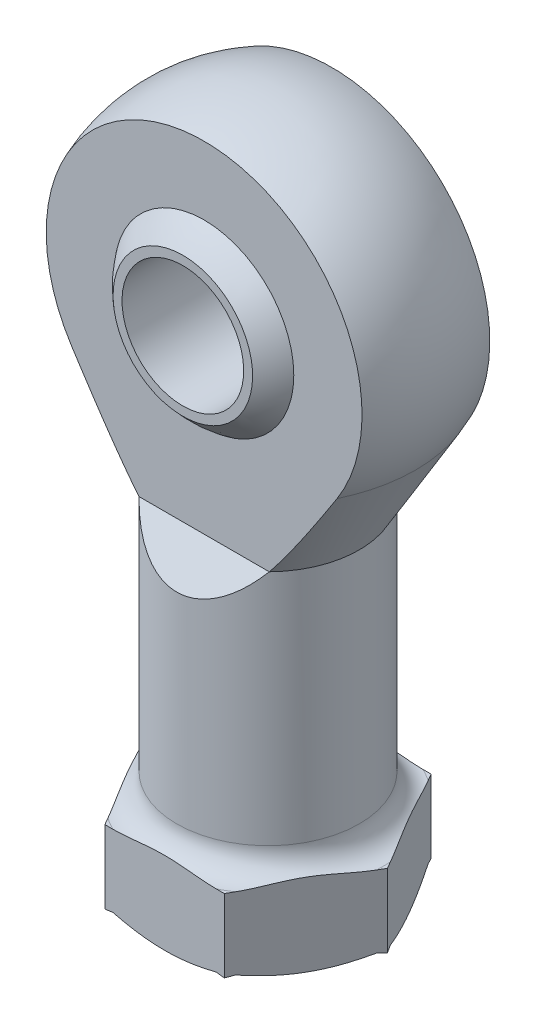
ISO-10303-21;
HEADER;
FILE_DESCRIPTION(('STEP AP214'),'2;1');
FILE_NAME('part.step','',(''),(''),'','','');
FILE_SCHEMA(('AUTOMOTIVE_DESIGN { 1 0 10303 214 1 1 1 1 }'));
ENDSEC;
DATA;
#1=APPLICATION_CONTEXT('core data for automotive mechanical design processes');
#2=APPLICATION_PROTOCOL_DEFINITION('international standard','automotive_design',2000,#1);
#3=PRODUCT_CONTEXT('',#1,'mechanical');
#4=PRODUCT('Part','Part','',(#3));
#5=PRODUCT_RELATED_PRODUCT_CATEGORY('part','',(#4));
#6=PRODUCT_DEFINITION_FORMATION('','',#4);
#7=PRODUCT_DEFINITION_CONTEXT('part definition',#1,'design');
#8=PRODUCT_DEFINITION('design','',#6,#7);
#9=PRODUCT_DEFINITION_SHAPE('','',#8);
#10=(LENGTH_UNIT() NAMED_UNIT(*) SI_UNIT(.MILLI.,.METRE.));
#11=(NAMED_UNIT(*) PLANE_ANGLE_UNIT() SI_UNIT($,.RADIAN.));
#12=(NAMED_UNIT(*) SI_UNIT($,.STERADIAN.) SOLID_ANGLE_UNIT());
#13=UNCERTAINTY_MEASURE_WITH_UNIT(LENGTH_MEASURE(1.E-05),#10,'distance_accuracy_value','');
#14=(GEOMETRIC_REPRESENTATION_CONTEXT(3) GLOBAL_UNCERTAINTY_ASSIGNED_CONTEXT((#13)) GLOBAL_UNIT_ASSIGNED_CONTEXT((#10,
#11,#12)) REPRESENTATION_CONTEXT('',''));
#15=CARTESIAN_POINT('',(0.,0.,0.));
#16=DIRECTION('',(0.,0.,1.));
#17=DIRECTION('',(1.,0.,0.));
#18=AXIS2_PLACEMENT_3D('',#15,#16,#17);
#19=CARTESIAN_POINT('',(0.,-18.,0.));
#20=DIRECTION('',(0.,-1.,0.));
#21=DIRECTION('',(0.,0.,-1.));
#22=AXIS2_PLACEMENT_3D('',#19,#20,#21);
#23=CONICAL_SURFACE('',#22,3.75,1.0471975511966);
#24=CARTESIAN_POINT('',(0.,-16.5566243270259,0.));
#25=DIRECTION('',(0.,-1.,0.));
#26=DIRECTION('',(0.,0.,1.));
#27=AXIS2_PLACEMENT_3D('',#24,#25,#26);
#28=CIRCLE('',#27,1.25);
#29=CARTESIAN_POINT('',(0.,-16.5566243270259,-1.24999999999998));
#30=VERTEX_POINT('',#29);
#31=EDGE_CURVE('P0_E686',#30,#30,#28,.T.);
#32=CARTESIAN_POINT('',(0.,-18.,0.));
#33=DIRECTION('',(0.,-1.,0.));
#34=DIRECTION('',(0.,0.,1.));
#35=AXIS2_PLACEMENT_3D('',#32,#33,#34);
#36=CIRCLE('',#35,3.75);
#37=CARTESIAN_POINT('',(0.,-18.,-3.75));
#38=VERTEX_POINT('',#37);
#39=EDGE_CURVE('P0_E689',#38,#38,#36,.F.);
#40=CARTESIAN_POINT('',(0.,-16.5566243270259,-1.24999999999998));
#41=CARTESIAN_POINT('',(0.,-16.5716594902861,-1.27604166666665));
#42=CARTESIAN_POINT('',(0.,-16.5866946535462,-1.30208333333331));
#43=CARTESIAN_POINT('',(0.,-16.6167649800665,-1.35416666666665));
#44=CARTESIAN_POINT('',(0.,-16.6318001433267,-1.38020833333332));
#45=CARTESIAN_POINT('',(0.,-16.661870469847,-1.43229166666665));
#46=CARTESIAN_POINT('',(0.,-16.6769056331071,-1.45833333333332));
#47=CARTESIAN_POINT('',(0.,-16.7069759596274,-1.51041666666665));
#48=CARTESIAN_POINT('',(0.,-16.7220111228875,-1.53645833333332));
#49=CARTESIAN_POINT('',(0.,-16.7520814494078,-1.58854166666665));
#50=CARTESIAN_POINT('',(0.,-16.767116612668,-1.61458333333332));
#51=CARTESIAN_POINT('',(0.,-16.7971869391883,-1.66666666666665));
#52=CARTESIAN_POINT('',(0.,-16.8122221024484,-1.69270833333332));
#53=CARTESIAN_POINT('',(0.,-16.8422924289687,-1.74479166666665));
#54=CARTESIAN_POINT('',(0.,-16.8573275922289,-1.77083333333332));
#55=CARTESIAN_POINT('',(0.,-16.8873979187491,-1.82291666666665));
#56=CARTESIAN_POINT('',(0.,-16.9024330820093,-1.84895833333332));
#57=CARTESIAN_POINT('',(0.,-16.9325034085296,-1.90104166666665));
#58=CARTESIAN_POINT('',(0.,-16.9475385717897,-1.92708333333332));
#59=CARTESIAN_POINT('',(0.,-16.97760889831,-1.97916666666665));
#60=CARTESIAN_POINT('',(0.,-16.9926440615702,-2.00520833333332));
#61=CARTESIAN_POINT('',(0.,-17.0227143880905,-2.05729166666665));
#62=CARTESIAN_POINT('',(0.,-17.0377495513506,-2.08333333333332));
#63=CARTESIAN_POINT('',(0.,-17.0678198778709,-2.13541666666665));
#64=CARTESIAN_POINT('',(0.,-17.0828550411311,-2.16145833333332));
#65=CARTESIAN_POINT('',(0.,-17.1129253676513,-2.21354166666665));
#66=CARTESIAN_POINT('',(0.,-17.1279605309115,-2.23958333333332));
#67=CARTESIAN_POINT('',(0.,-17.1580308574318,-2.29166666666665));
#68=CARTESIAN_POINT('',(0.,-17.1730660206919,-2.31770833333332));
#69=CARTESIAN_POINT('',(0.,-17.2031363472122,-2.36979166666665));
#70=CARTESIAN_POINT('',(0.,-17.2181715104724,-2.39583333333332));
#71=CARTESIAN_POINT('',(0.,-17.2482418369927,-2.44791666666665));
#72=CARTESIAN_POINT('',(0.,-17.2632770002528,-2.47395833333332));
#73=CARTESIAN_POINT('',(0.,-17.2933473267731,-2.52604166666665));
#74=CARTESIAN_POINT('',(0.,-17.3083824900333,-2.55208333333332));
#75=CARTESIAN_POINT('',(0.,-17.3384528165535,-2.60416666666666));
#76=CARTESIAN_POINT('',(0.,-17.3534879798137,-2.63020833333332));
#77=CARTESIAN_POINT('',(0.,-17.383558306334,-2.68229166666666));
#78=CARTESIAN_POINT('',(0.,-17.3985934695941,-2.70833333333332));
#79=CARTESIAN_POINT('',(0.,-17.4286637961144,-2.76041666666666));
#80=CARTESIAN_POINT('',(0.,-17.4436989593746,-2.78645833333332));
#81=CARTESIAN_POINT('',(0.,-17.4737692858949,-2.83854166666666));
#82=CARTESIAN_POINT('',(0.,-17.488804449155,-2.86458333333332));
#83=CARTESIAN_POINT('',(0.,-17.5188747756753,-2.91666666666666));
#84=CARTESIAN_POINT('',(0.,-17.5339099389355,-2.94270833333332));
#85=CARTESIAN_POINT('',(0.,-17.5639802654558,-2.99479166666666));
#86=CARTESIAN_POINT('',(0.,-17.5790154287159,-3.02083333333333));
#87=CARTESIAN_POINT('',(0.,-17.6090857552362,-3.07291666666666));
#88=CARTESIAN_POINT('',(0.,-17.6241209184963,-3.09895833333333));
#89=CARTESIAN_POINT('',(0.,-17.6541912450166,-3.15104166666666));
#90=CARTESIAN_POINT('',(0.,-17.6692264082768,-3.17708333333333));
#91=CARTESIAN_POINT('',(0.,-17.6992967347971,-3.22916666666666));
#92=CARTESIAN_POINT('',(0.,-17.7143318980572,-3.25520833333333));
#93=CARTESIAN_POINT('',(0.,-17.7444022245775,-3.30729166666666));
#94=CARTESIAN_POINT('',(0.,-17.7594373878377,-3.33333333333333));
#95=CARTESIAN_POINT('',(0.,-17.7895077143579,-3.38541666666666));
#96=CARTESIAN_POINT('',(0.,-17.8045428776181,-3.41145833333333));
#97=CARTESIAN_POINT('',(0.,-17.8346132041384,-3.46354166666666));
#98=CARTESIAN_POINT('',(0.,-17.8496483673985,-3.48958333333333));
#99=CARTESIAN_POINT('',(0.,-17.8797186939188,-3.54166666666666));
#100=CARTESIAN_POINT('',(0.,-17.894753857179,-3.56770833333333));
#101=CARTESIAN_POINT('',(0.,-17.9248241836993,-3.61979166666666));
#102=CARTESIAN_POINT('',(0.,-17.9398593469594,-3.64583333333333));
#103=CARTESIAN_POINT('',(0.,-17.9699296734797,-3.69791666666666));
#104=CARTESIAN_POINT('',(0.,-17.9849648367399,-3.72395833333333));
#105=CARTESIAN_POINT('',(0.,-18.,-3.75));
#106=B_SPLINE_CURVE_WITH_KNOTS('',3,(#40,#41,#42,#43,#44,#45,#46,#47,#48,#49,#50,#51,#52,#53,
#54,#55,#56,#57,#58,#59,#60,#61,#62,#63,#64,#65,#66,#67,#68,#69,#70,#71,#72,#73,#74,#75,#76,#77,
#78,#79,#80,#81,#82,#83,#84,#85,#86,#87,#88,#89,#90,#91,#92,#93,#94,#95,#96,#97,#98,#99,#100,
#101,#102,#103,#104,#105),.UNSPECIFIED.,.F.,.F.,(4,2,2,2,2,2,2,2,2,2,2,2,2,2,2,2,2,2,2,2,2,2,2,
2,2,2,2,2,2,2,2,2,4),(0.,0.090210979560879,0.180421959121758,0.270632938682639,
0.360843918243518,0.451054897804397,0.541265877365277,0.631476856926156,0.721687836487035,
0.811898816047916,0.902109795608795,0.992320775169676,1.08253175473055,1.17274273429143,
1.26295371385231,1.35316469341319,1.44337567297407,1.53358665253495,1.62379763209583,
1.71400861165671,1.80421959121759,1.89443057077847,1.98464155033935,2.07485252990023,
2.16506350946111,2.25527448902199,2.34548546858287,2.43569644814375,2.52590742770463,
2.61611840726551,2.70632938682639,2.79654036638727,2.88675134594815),.UNSPECIFIED.);
#107=EDGE_CURVE('P0_BSEAM16',#30,#38,#106,.T.);
#108=ORIENTED_EDGE('',*,*,#31,.F.);
#109=ORIENTED_EDGE('',*,*,#39,.F.);
#110=ORIENTED_EDGE('',*,*,#107,.T.);
#111=ORIENTED_EDGE('',*,*,#107,.F.);
#112=EDGE_LOOP('',(#108,#110,#109,#111));
#113=FACE_BOUND('',#112,.T.);
#114=ADVANCED_FACE('P0_F16',(#113),#23,.F.);
#115=CARTESIAN_POINT('',(0.,-18.,0.));
#116=DIRECTION('',(0.,-1.,0.));
#117=DIRECTION('',(0.,0.,-1.));
#118=AXIS2_PLACEMENT_3D('',#115,#116,#117);
#119=CYLINDRICAL_SURFACE('',#118,3.75);
#120=CARTESIAN_POINT('',(0.,-43.,0.));
#121=DIRECTION('',(0.,-1.,0.));
#122=DIRECTION('',(0.,0.,-1.));
#123=AXIS2_PLACEMENT_3D('',#120,#121,#122);
#124=CIRCLE('',#123,3.75);
#125=CARTESIAN_POINT('',(0.,-43.,-3.75));
#126=VERTEX_POINT('',#125);
#127=EDGE_CURVE('P0_E137',#126,#126,#124,.F.);
#128=ORIENTED_EDGE('',*,*,#127,.F.);
#129=EDGE_LOOP('',(#128));
#130=FACE_BOUND('',#129,.T.);
#131=ORIENTED_EDGE('',*,*,#39,.T.);
#132=EDGE_LOOP('',(#131));
#133=FACE_BOUND('',#132,.T.);
#134=ADVANCED_FACE('P0_F1060',(#130,#133),#119,.F.);
#135=CARTESIAN_POINT('',(0.,-8.96199623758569,0.));
#136=DIRECTION('',(0.,-1.,0.));
#137=DIRECTION('',(0.,0.,-1.));
#138=AXIS2_PLACEMENT_3D('',#135,#136,#137);
#139=CYLINDRICAL_SURFACE('',#138,1.25);
#140=CARTESIAN_POINT('',(0.,-8.96199623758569,0.));
#141=DIRECTION('',(0.,-1.,0.));
#142=DIRECTION('',(0.,0.,-1.));
#143=AXIS2_PLACEMENT_3D('',#140,#141,#142);
#144=CIRCLE('',#143,1.25);
#145=CARTESIAN_POINT('',(0.,-8.96199623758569,-1.25));
#146=VERTEX_POINT('',#145);
#147=EDGE_CURVE('P0_E150',#146,#146,#144,.T.);
#148=ORIENTED_EDGE('',*,*,#147,.F.);
#149=EDGE_LOOP('',(#148));
#150=FACE_BOUND('',#149,.T.);
#151=ORIENTED_EDGE('',*,*,#31,.T.);
#152=EDGE_LOOP('',(#151));
#153=FACE_BOUND('',#152,.T.);
#154=ADVANCED_FACE('P0_F186',(#150,#153),#139,.F.);
#155=CARTESIAN_POINT('',(0.,-43.,0.));
#156=DIRECTION('',(0.,1.,0.));
#157=DIRECTION('',(-1.,0.,0.));
#158=AXIS2_PLACEMENT_3D('',#155,#156,#157);
#159=CONICAL_SURFACE('',#158,8.5,1.0471975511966);
#160=CARTESIAN_POINT('',(9.48253642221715,-42.4226496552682,-0.575765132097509));
#161=CARTESIAN_POINT('',(9.39578923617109,-42.4673803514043,-0.726015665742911));
#162=CARTESIAN_POINT('',(9.30878053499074,-42.5100547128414,-0.876719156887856));
#163=CARTESIAN_POINT('',(9.13421901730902,-42.5908826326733,-1.17906857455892));
#164=CARTESIAN_POINT('',(9.04666607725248,-42.6290351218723,-1.33071471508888));
#165=CARTESIAN_POINT('',(8.78397018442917,-42.7357624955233,-1.78571734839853));
#166=CARTESIAN_POINT('',(8.60804977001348,-42.7969960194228,-2.09042044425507));
#167=CARTESIAN_POINT('',(8.34292193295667,-42.8717544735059,-2.54963532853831));
#168=CARTESIAN_POINT('',(8.25430069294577,-42.8938309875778,-2.70313181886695));
#169=CARTESIAN_POINT('',(8.07673071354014,-42.9319566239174,-3.01069204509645));
#170=CARTESIAN_POINT('',(7.98778197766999,-42.9480058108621,-3.16475577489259));
#171=CARTESIAN_POINT('',(7.80929546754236,-42.9738627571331,-3.47390347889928));
#172=CARTESIAN_POINT('',(7.71975676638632,-42.9836449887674,-3.62898905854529));
#173=CARTESIAN_POINT('',(7.54055161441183,-42.9967236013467,-3.9393814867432));
#174=CARTESIAN_POINT('',(7.4508851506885,-43.0000192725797,-4.09468835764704));
#175=CARTESIAN_POINT('',(7.36121593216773,-43.,-4.25));
#176=B_SPLINE_CURVE_WITH_KNOTS('',3,(#160,#161,#162,#163,#164,#165,#166,#167,#168,#169,#170,
#171,#172,#173,#174,#175),.UNSPECIFIED.,.F.,.F.,(4,2,2,2,2,2,2,4),(0.,0.537471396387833,
1.07506962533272,2.1456788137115,2.68143293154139,3.2171813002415,3.75509832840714,
4.29307420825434),.UNSPECIFIED.);
#177=CARTESIAN_POINT('',(9.48253634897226,-42.4226496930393,-0.575765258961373));
#178=VERTEX_POINT('',#177);
#179=CARTESIAN_POINT('',(7.36121593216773,-43.,-4.25));
#180=VERTEX_POINT('',#179);
#181=EDGE_CURVE('P0_E131',#178,#180,#176,.T.);
#182=ORIENTED_EDGE('',*,*,#181,.F.);
#183=CARTESIAN_POINT('',(0.,-42.4226497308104,0.));
#184=DIRECTION('',(0.,1.,0.));
#185=DIRECTION('',(0.,0.,1.));
#186=AXIS2_PLACEMENT_3D('',#183,#184,#185);
#187=CIRCLE('',#186,9.50000000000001);
#188=CARTESIAN_POINT('',(9.48253625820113,-42.4226497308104,0.575765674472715));
#189=VERTEX_POINT('',#188);
#190=EDGE_CURVE('P0_E138',#189,#178,#187,.T.);
#191=ORIENTED_EDGE('',*,*,#190,.F.);
#192=CARTESIAN_POINT('',(7.36121593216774,-43.,4.24999999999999));
#193=CARTESIAN_POINT('',(7.45088512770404,-43.0000192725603,4.09468839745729));
#194=CARTESIAN_POINT('',(7.54055156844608,-42.9967236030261,3.93938156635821));
#195=CARTESIAN_POINT('',(7.71975667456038,-42.9836449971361,3.62898921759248));
#196=CARTESIAN_POINT('',(7.8092953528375,-42.9738627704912,3.47390367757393));
#197=CARTESIAN_POINT('',(7.98778181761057,-42.9480058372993,3.16475605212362));
#198=CARTESIAN_POINT('',(8.07673053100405,-42.9319566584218,3.01069236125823));
#199=CARTESIAN_POINT('',(8.25430046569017,-42.8938310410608,2.70313221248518));
#200=CARTESIAN_POINT('',(8.34292168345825,-42.8717545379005,2.54963576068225));
#201=CARTESIAN_POINT('',(8.6080494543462,-42.7969961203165,2.09042099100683));
#202=CARTESIAN_POINT('',(8.78396982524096,-42.7357626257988,1.78571797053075));
#203=CARTESIAN_POINT('',(9.04666565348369,-42.6290353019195,1.33071544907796));
#204=CARTESIAN_POINT('',(9.13421857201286,-42.5908828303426,1.17906934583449));
#205=CARTESIAN_POINT('',(9.30878004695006,-42.5100549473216,0.876720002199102));
#206=CARTESIAN_POINT('',(9.39578872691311,-42.4673806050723,0.726016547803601));
#207=CARTESIAN_POINT('',(9.48253589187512,-42.4226499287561,0.575766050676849));
#208=B_SPLINE_CURVE_WITH_KNOTS('',3,(#192,#193,#194,#195,#196,#197,#198,#199,#200,#201,#202,
#203,#204,#205,#206,#207),.UNSPECIFIED.,.F.,.F.,(4,2,2,2,2,2,2,4),(0.,0.537975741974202,
1.07589263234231,1.61164086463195,2.1473948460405,3.21800376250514,3.75560185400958,
4.29307311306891),.UNSPECIFIED.);
#209=CARTESIAN_POINT('',(7.36121593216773,-43.,4.25));
#210=VERTEX_POINT('',#209);
#211=EDGE_CURVE('P0_E134',#210,#189,#208,.T.);
#212=ORIENTED_EDGE('',*,*,#211,.F.);
#213=CARTESIAN_POINT('',(0.,-43.,0.));
#214=DIRECTION('',(0.,1.,0.));
#215=DIRECTION('',(-1.,0.,0.));
#216=AXIS2_PLACEMENT_3D('',#213,#214,#215);
#217=CIRCLE('',#216,8.49999999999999);
#218=EDGE_CURVE('P0_E127',#180,#210,#217,.F.);
#219=ORIENTED_EDGE('',*,*,#218,.F.);
#220=EDGE_LOOP('',(#182,#191,#212,#219));
#221=FACE_BOUND('',#220,.T.);
#222=ADVANCED_FACE('P0_F129',(#221),#159,.T.);
#223=CARTESIAN_POINT('',(0.,-42.5141148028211,0.));
#224=DIRECTION('',(0.,-1.,0.));
#225=DIRECTION('',(0.,0.,-1.));
#226=AXIS2_PLACEMENT_3D('',#223,#224,#225);
#227=CONICAL_SURFACE('',#226,9.81684430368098,1.2897614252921);
#228=ORIENTED_EDGE('',*,*,#190,.T.);
#229=CARTESIAN_POINT('',(9.81495457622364,-42.513569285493,0.));
#230=CARTESIAN_POINT('',(9.8009080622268,-42.5095144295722,-0.0243292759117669));
#231=CARTESIAN_POINT('',(9.78685969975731,-42.5054851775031,-0.0486617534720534));
#232=CARTESIAN_POINT('',(9.75881941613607,-42.4974957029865,-0.0972289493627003));
#233=CARTESIAN_POINT('',(9.74482751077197,-42.4935352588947,-0.121463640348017));
#234=CARTESIAN_POINT('',(9.71690014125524,-42.4856833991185,-0.169835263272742));
#235=CARTESIAN_POINT('',(9.70296469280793,-42.4817917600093,-0.19397216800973));
#236=CARTESIAN_POINT('',(9.67515023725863,-42.4740775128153,-0.242148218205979));
#237=CARTESIAN_POINT('',(9.66127124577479,-42.4702546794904,-0.266187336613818));
#238=CARTESIAN_POINT('',(9.63356970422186,-42.4626780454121,-0.314167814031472));
#239=CARTESIAN_POINT('',(9.61974716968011,-42.4589240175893,-0.33810914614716));
#240=CARTESIAN_POINT('',(9.59215854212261,-42.4514849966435,-0.385894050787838));
#241=CARTESIAN_POINT('',(9.57839246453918,-42.4477997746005,-0.409737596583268));
#242=CARTESIAN_POINT('',(9.5509167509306,-42.4404983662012,-0.457326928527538));
#243=CARTESIAN_POINT('',(9.53720713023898,-42.4368819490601,-0.481072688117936));
#244=CARTESIAN_POINT('',(9.50984433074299,-42.4297181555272,-0.528466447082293));
#245=CARTESIAN_POINT('',(9.49619116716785,-42.4261705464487,-0.552114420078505));
#246=CARTESIAN_POINT('',(9.48253627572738,-42.4226497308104,-0.575765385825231));
#247=B_SPLINE_CURVE_WITH_KNOTS('',3,(#229,#230,#231,#232,#233,#234,#235,#236,#237,#238,#239,
#240,#241,#242,#243,#244,#245,#246),.UNSPECIFIED.,.F.,.F.,(4,2,2,2,2,2,2,2,4),(0.,
0.0851524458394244,0.169940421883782,0.254364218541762,0.338424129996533,0.422120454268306,
0.505453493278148,0.588423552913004,0.671030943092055),.UNSPECIFIED.);
#248=CARTESIAN_POINT('',(9.81495457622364,-42.513569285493,0.));
#249=VERTEX_POINT('',#248);
#250=EDGE_CURVE('P0_E164',#249,#178,#247,.T.);
#251=ORIENTED_EDGE('',*,*,#250,.F.);
#252=CARTESIAN_POINT('',(9.48253627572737,-42.4226497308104,0.575765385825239));
#253=CARTESIAN_POINT('',(9.49619116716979,-42.4261705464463,0.552114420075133));
#254=CARTESIAN_POINT('',(9.50984433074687,-42.4297181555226,0.528466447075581));
#255=CARTESIAN_POINT('',(9.53720713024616,-42.436881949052,0.481072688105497));
#256=CARTESIAN_POINT('',(9.55091675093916,-42.4404983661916,0.457326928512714));
#257=CARTESIAN_POINT('',(9.57839246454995,-42.4477997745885,0.409737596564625));
#258=CARTESIAN_POINT('',(9.5921585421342,-42.4514849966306,0.385894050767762));
#259=CARTESIAN_POINT('',(9.6197471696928,-42.4589240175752,0.338109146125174));
#260=CARTESIAN_POINT('',(9.63356970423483,-42.4626780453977,0.314167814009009));
#261=CARTESIAN_POINT('',(9.66127124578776,-42.470254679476,0.266187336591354));
#262=CARTESIAN_POINT('',(9.67515023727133,-42.4740775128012,0.242148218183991));
#263=CARTESIAN_POINT('',(9.70296469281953,-42.4817917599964,0.193972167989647));
#264=CARTESIAN_POINT('',(9.716900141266,-42.4856833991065,0.169835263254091));
#265=CARTESIAN_POINT('',(9.74482751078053,-42.4935352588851,0.121463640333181));
#266=CARTESIAN_POINT('',(9.75881941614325,-42.4974957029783,0.0972289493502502));
#267=CARTESIAN_POINT('',(9.7868596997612,-42.5054851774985,0.0486617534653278));
#268=CARTESIAN_POINT('',(9.80090806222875,-42.5095144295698,0.0243292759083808));
#269=CARTESIAN_POINT('',(9.81495457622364,-42.513569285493,0.));
#270=B_SPLINE_CURVE_WITH_KNOTS('',3,(#252,#253,#254,#255,#256,#257,#258,#259,#260,#261,#262,
#263,#264,#265,#266,#267,#268,#269),.UNSPECIFIED.,.F.,.F.,(4,2,2,2,2,2,2,2,4),(0.,
0.0826073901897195,0.165577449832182,0.248910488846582,0.332606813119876,0.416666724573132,
0.501090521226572,0.585878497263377,0.671030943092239),.UNSPECIFIED.);
#271=EDGE_CURVE('P0_E196',#189,#249,#270,.T.);
#272=ORIENTED_EDGE('',*,*,#271,.F.);
#273=EDGE_LOOP('',(#228,#251,#272));
#274=FACE_BOUND('',#273,.T.);
#275=ADVANCED_FACE('P0_F185',(#274),#227,.F.);
#276=CARTESIAN_POINT('',(8.60200330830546,-43.,-8.5));
#277=DIRECTION('',(0.,-1.,0.));
#278=DIRECTION('',(0.,0.,1.));
#279=AXIS2_PLACEMENT_3D('',#276,#277,#278);
#280=PLANE('',#279);
#281=ORIENTED_EDGE('',*,*,#127,.T.);
#282=EDGE_LOOP('',(#281));
#283=FACE_BOUND('',#282,.T.);
#284=ORIENTED_EDGE('',*,*,#218,.T.);
#285=CARTESIAN_POINT('',(0.,-43.,0.));
#286=DIRECTION('',(0.,1.,0.));
#287=DIRECTION('',(0.,0.,1.));
#288=AXIS2_PLACEMENT_3D('',#285,#286,#287);
#289=CIRCLE('',#288,8.5);
#290=CARTESIAN_POINT('',(0.,-43.,8.5));
#291=VERTEX_POINT('',#290);
#292=EDGE_CURVE('P0_E314',#291,#210,#289,.T.);
#293=ORIENTED_EDGE('',*,*,#292,.F.);
#294=CARTESIAN_POINT('',(0.,-43.,0.));
#295=DIRECTION('',(0.,1.,0.));
#296=DIRECTION('',(0.,0.,1.));
#297=AXIS2_PLACEMENT_3D('',#294,#295,#296);
#298=CIRCLE('',#297,8.49999999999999);
#299=CARTESIAN_POINT('',(-7.36121593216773,-43.,4.25));
#300=VERTEX_POINT('',#299);
#301=EDGE_CURVE('P0_E198',#300,#291,#298,.T.);
#302=ORIENTED_EDGE('',*,*,#301,.F.);
#303=CARTESIAN_POINT('',(0.,-43.,0.));
#304=DIRECTION('',(0.,1.,0.));
#305=DIRECTION('',(0.,0.,1.));
#306=AXIS2_PLACEMENT_3D('',#303,#304,#305);
#307=CIRCLE('',#306,8.5);
#308=CARTESIAN_POINT('',(-7.36121593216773,-43.,-4.25));
#309=VERTEX_POINT('',#308);
#310=EDGE_CURVE('P0_E200',#309,#300,#307,.T.);
#311=ORIENTED_EDGE('',*,*,#310,.F.);
#312=CARTESIAN_POINT('',(0.,-43.,0.));
#313=DIRECTION('',(0.,1.,0.));
#314=DIRECTION('',(0.,0.,1.));
#315=AXIS2_PLACEMENT_3D('',#312,#313,#314);
#316=CIRCLE('',#315,8.5);
#317=CARTESIAN_POINT('',(0.,-43.,-8.5));
#318=VERTEX_POINT('',#317);
#319=EDGE_CURVE('P0_E145',#318,#309,#316,.T.);
#320=ORIENTED_EDGE('',*,*,#319,.F.);
#321=CARTESIAN_POINT('',(0.,-43.,0.));
#322=DIRECTION('',(0.,1.,0.));
#323=DIRECTION('',(0.,0.,1.));
#324=AXIS2_PLACEMENT_3D('',#321,#322,#323);
#325=CIRCLE('',#324,8.49999999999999);
#326=EDGE_CURVE('P0_E141',#180,#318,#325,.T.);
#327=ORIENTED_EDGE('',*,*,#326,.F.);
#328=EDGE_LOOP('',(#284,#293,#302,#311,#320,#327));
#329=FACE_BOUND('',#328,.T.);
#330=ADVANCED_FACE('P0_F143',(#283,#329),#280,.T.);
#331=CARTESIAN_POINT('',(0.,0.,0.));
#332=DIRECTION('',(0.,0.,1.));
#333=DIRECTION('',(-1.,0.,0.));
#334=AXIS2_PLACEMENT_3D('',#331,#332,#333);
#335=SPHERICAL_SURFACE('',#334,9.04875);
#336=CARTESIAN_POINT('',(0.,0.,-5.25));
#337=DIRECTION('',(0.,0.,1.));
#338=DIRECTION('',(1.,0.,0.));
#339=AXIS2_PLACEMENT_3D('',#336,#337,#338);
#340=CIRCLE('',#339,7.3700323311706);
#341=CARTESIAN_POINT('',(7.3700323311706,0.,-5.25));
#342=VERTEX_POINT('',#341);
#343=EDGE_CURVE('P0_E295',#342,#342,#340,.T.);
#344=ORIENTED_EDGE('',*,*,#343,.F.);
#345=EDGE_LOOP('',(#344));
#346=FACE_BOUND('',#345,.T.);
#347=CARTESIAN_POINT('',(0.,0.,5.25));
#348=DIRECTION('',(0.,0.,1.));
#349=DIRECTION('',(1.,0.,0.));
#350=AXIS2_PLACEMENT_3D('',#347,#348,#349);
#351=CIRCLE('',#350,7.3700323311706);
#352=CARTESIAN_POINT('',(7.3700323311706,0.,5.25));
#353=VERTEX_POINT('',#352);
#354=EDGE_CURVE('P0_E302',#353,#353,#351,.F.);
#355=ORIENTED_EDGE('',*,*,#354,.F.);
#356=EDGE_LOOP('',(#355));
#357=FACE_BOUND('',#356,.T.);
#358=ORIENTED_EDGE('',*,*,#147,.T.);
#359=EDGE_LOOP('',(#358));
#360=FACE_BOUND('',#359,.T.);
#361=ADVANCED_FACE('P0_F925',(#346,#357,#360),#335,.F.);
#362=CARTESIAN_POINT('',(9.81694908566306,-36.5,0.57576538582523));
#363=DIRECTION('',(0.,1.,0.));
#364=DIRECTION('',(0.,0.,-1.));
#365=AXIS2_PLACEMENT_3D('',#362,#363,#364);
#366=PLANE('',#365);
#367=DIRECTION('',(0.5,0.,0.866025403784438));
#368=VECTOR('',#367,1.);
#369=CARTESIAN_POINT('',(7.36121593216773,-36.5,-4.25));
#370=LINE('',#369,#368);
#371=CARTESIAN_POINT('',(9.48253627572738,-36.5,-0.575765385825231));
#372=VERTEX_POINT('',#371);
#373=CARTESIAN_POINT('',(9.81495457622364,-36.5,0.));
#374=VERTEX_POINT('',#373);
#375=EDGE_CURVE('P0_E893',#372,#374,#370,.T.);
#376=ORIENTED_EDGE('',*,*,#375,.F.);
#377=CARTESIAN_POINT('',(0.,-36.5,0.));
#378=DIRECTION('',(0.,1.,0.));
#379=DIRECTION('',(0.99816171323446,0.,0.0606068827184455));
#380=AXIS2_PLACEMENT_3D('',#377,#378,#379);
#381=CIRCLE('',#380,9.5);
#382=CARTESIAN_POINT('',(9.48253627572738,-36.5,0.575765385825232));
#383=VERTEX_POINT('',#382);
#384=EDGE_CURVE('P0_E911',#383,#372,#381,.T.);
#385=ORIENTED_EDGE('',*,*,#384,.F.);
#386=DIRECTION('',(-0.5,0.,0.866025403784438));
#387=VECTOR('',#386,1.);
#388=CARTESIAN_POINT('',(7.36121593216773,-36.5,4.25));
#389=LINE('',#388,#387);
#390=EDGE_CURVE('P0_E862',#374,#383,#389,.T.);
#391=ORIENTED_EDGE('',*,*,#390,.F.);
#392=EDGE_LOOP('',(#376,#385,#391));
#393=FACE_BOUND('',#392,.T.);
#394=ADVANCED_FACE('P0_F915',(#393),#366,.T.);
#395=CARTESIAN_POINT('',(0.,-42.5141148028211,0.));
#396=DIRECTION('',(0.,-1.,0.));
#397=DIRECTION('',(0.,0.,-1.));
#398=AXIS2_PLACEMENT_3D('',#395,#396,#397);
#399=CONICAL_SURFACE('',#398,9.81684430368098,1.28976142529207);
#400=CARTESIAN_POINT('',(0.,-42.4226497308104,0.));
#401=DIRECTION('',(0.,-1.,0.));
#402=DIRECTION('',(0.,0.,1.));
#403=AXIS2_PLACEMENT_3D('',#400,#401,#402);
#404=CIRCLE('',#403,9.49999999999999);
#405=CARTESIAN_POINT('',(4.24264094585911,-42.4226497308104,-8.49999987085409));
#406=VERTEX_POINT('',#405);
#407=CARTESIAN_POINT('',(5.2398955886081,-42.4226497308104,-7.92423461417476));
#408=VERTEX_POINT('',#407);
#409=EDGE_CURVE('P0_E149',#406,#408,#404,.T.);
#410=ORIENTED_EDGE('',*,*,#409,.F.);
#411=CARTESIAN_POINT('',(4.90747728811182,-42.513569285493,-8.5));
#412=CARTESIAN_POINT('',(4.87938426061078,-42.5095144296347,-8.5));
#413=CARTESIAN_POINT('',(4.8512875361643,-42.5054851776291,-8.5));
#414=CARTESIAN_POINT('',(4.79520696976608,-42.4974957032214,-8.5));
#415=CARTESIAN_POINT('',(4.76722315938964,-42.4935352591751,-8.5));
#416=CARTESIAN_POINT('',(4.71136842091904,-42.4856833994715,-8.5));
#417=CARTESIAN_POINT('',(4.68349752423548,-42.4817917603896,-8.5));
#418=CARTESIAN_POINT('',(4.62786861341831,-42.4740775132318,-8.5));
#419=CARTESIAN_POINT('',(4.60011063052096,-42.4702546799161,-8.5));
#420=CARTESIAN_POINT('',(4.5447075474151,-42.4626780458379,-8.5));
#421=CARTESIAN_POINT('',(4.51706247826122,-42.4589240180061,-8.5));
#422=CARTESIAN_POINT('',(4.4618852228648,-42.4514849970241,-8.5));
#423=CARTESIAN_POINT('',(4.43435306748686,-42.4477997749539,-8.5));
#424=CARTESIAN_POINT('',(4.37940163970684,-42.4404983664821,-8.5));
#425=CARTESIAN_POINT('',(4.35198239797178,-42.4368819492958,-8.5));
#426=CARTESIAN_POINT('',(4.29725679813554,-42.429718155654,-8.5));
#427=CARTESIAN_POINT('',(4.26995047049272,-42.4261705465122,-8.5));
#428=CARTESIAN_POINT('',(4.24264068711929,-42.4226497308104,-8.5));
#429=B_SPLINE_CURVE_WITH_KNOTS('',3,(#411,#412,#413,#414,#415,#416,#417,#418,#419,#420,#421,
#422,#423,#424,#425,#426,#427,#428),.UNSPECIFIED.,.F.,.F.,(4,2,2,2,2,2,2,2,4),(0.,
0.0851524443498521,0.169940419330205,0.254364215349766,0.338424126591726,0.422120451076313,
0.505453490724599,0.588423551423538,0.671030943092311),.UNSPECIFIED.);
#430=CARTESIAN_POINT('',(4.90747728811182,-42.513569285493,-8.5));
#431=VERTEX_POINT('',#430);
#432=EDGE_CURVE('P0_E643',#431,#406,#429,.T.);
#433=ORIENTED_EDGE('',*,*,#432,.F.);
#434=CARTESIAN_POINT('',(5.23989558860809,-42.4226497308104,-7.92423461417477));
#435=CARTESIAN_POINT('',(5.22624069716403,-42.4261705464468,-7.94788557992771));
#436=CARTESIAN_POINT('',(5.21258753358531,-42.4297181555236,-7.9715335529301));
#437=CARTESIAN_POINT('',(5.18522473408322,-42.4368819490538,-8.01892731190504));
#438=CARTESIAN_POINT('',(5.17151511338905,-42.4404983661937,-8.04267307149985));
#439=CARTESIAN_POINT('',(5.14403939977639,-42.4477997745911,-8.09026240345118));
#440=CARTESIAN_POINT('',(5.13027332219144,-42.4514849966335,-8.11410594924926));
#441=CARTESIAN_POINT('',(5.1026846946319,-42.4589240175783,-8.16189085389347));
#442=CARTESIAN_POINT('',(5.08886216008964,-42.4626780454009,-8.18583218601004));
#443=CARTESIAN_POINT('',(5.06116061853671,-42.4702546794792,-8.23381266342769));
#444=CARTESIAN_POINT('',(5.04728162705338,-42.4740775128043,-8.25785178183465));
#445=CARTESIAN_POINT('',(5.01946717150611,-42.4817917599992,-8.30602783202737));
#446=CARTESIAN_POINT('',(5.00553172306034,-42.4856833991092,-8.33016473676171));
#447=CARTESIAN_POINT('',(4.97760435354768,-42.4935352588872,-8.37853635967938));
#448=CARTESIAN_POINT('',(4.96361244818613,-42.4974957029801,-8.40277105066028));
#449=CARTESIAN_POINT('',(4.93557216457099,-42.5054851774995,-8.45133824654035));
#450=CARTESIAN_POINT('',(4.92152380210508,-42.5095144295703,-8.47567072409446));
#451=CARTESIAN_POINT('',(4.90747728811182,-42.513569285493,-8.5));
#452=B_SPLINE_CURVE_WITH_KNOTS('',3,(#434,#435,#436,#437,#438,#439,#440,#441,#442,#443,#444,
#445,#446,#447,#448,#449,#450,#451),.UNSPECIFIED.,.F.,.F.,(4,2,2,2,2,2,2,2,4),(0.,
0.0826073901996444,0.165577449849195,0.248910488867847,0.332606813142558,0.416666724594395,
0.501090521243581,0.585878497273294,0.67103094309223),.UNSPECIFIED.);
#453=EDGE_CURVE('P0_E158',#408,#431,#452,.T.);
#454=ORIENTED_EDGE('',*,*,#453,.F.);
#455=EDGE_LOOP('',(#410,#433,#454));
#456=FACE_BOUND('',#455,.T.);
#457=ADVANCED_FACE('P0_F762',(#456),#399,.F.);
#458=CARTESIAN_POINT('',(0.,-43.,0.));
#459=DIRECTION('',(0.,1.,0.));
#460=DIRECTION('',(0.,0.,1.));
#461=AXIS2_PLACEMENT_3D('',#458,#459,#460);
#462=CONICAL_SURFACE('',#461,8.5,1.0471975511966);
#463=CARTESIAN_POINT('',(4.24264095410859,-42.4226496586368,-8.49999999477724));
#464=CARTESIAN_POINT('',(4.06914658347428,-42.4673803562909,-8.49999999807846));
#465=CARTESIAN_POINT('',(3.89512918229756,-42.5100547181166,-8.49999999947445));
#466=CARTESIAN_POINT('',(3.54600614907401,-42.5908826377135,-8.50000000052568));
#467=CARTESIAN_POINT('',(3.37090026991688,-42.6290351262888,-8.5000000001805));
#468=CARTESIAN_POINT('',(2.84550848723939,-42.7357624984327,-8.49999999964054));
#469=CARTESIAN_POINT('',(2.4936676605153,-42.7969960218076,-8.49999999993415));
#470=CARTESIAN_POINT('',(1.96341198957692,-42.871754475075,-8.50000000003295));
#471=CARTESIAN_POINT('',(1.78616951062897,-42.893830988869,-8.50000000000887));
#472=CARTESIAN_POINT('',(1.43102955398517,-42.9319566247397,-8.49999999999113));
#473=CARTESIAN_POINT('',(1.25313208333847,-42.9480058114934,-8.49999999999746));
#474=CARTESIAN_POINT('',(0.896159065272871,-42.9738627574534,-8.50000000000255));
#475=CARTESIAN_POINT('',(0.717081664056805,-42.9836449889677,-8.50000000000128));
#476=CARTESIAN_POINT('',(0.35867136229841,-42.9967236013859,-8.49999999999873));
#477=CARTESIAN_POINT('',(0.179338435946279,-43.0000192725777,-8.49999999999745));
#478=CARTESIAN_POINT('',(0.,-43.,-8.5));
#479=B_SPLINE_CURVE_WITH_KNOTS('',3,(#463,#464,#465,#466,#467,#468,#469,#470,#471,#472,#473,
#474,#475,#476,#477,#478),.UNSPECIFIED.,.F.,.F.,(4,2,2,2,2,2,2,4),(0.,0.537471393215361,
1.07506961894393,2.14567880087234,2.68143291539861,3.21718128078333,3.75509830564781,
4.29307418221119),.UNSPECIFIED.);
#480=EDGE_CURVE('P0_E764',#406,#318,#479,.T.);
#481=ORIENTED_EDGE('',*,*,#480,.F.);
#482=ORIENTED_EDGE('',*,*,#409,.T.);
#483=CARTESIAN_POINT('',(7.36121593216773,-43.,-4.25));
#484=CARTESIAN_POINT('',(7.27154671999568,-43.0000192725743,-4.40531163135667));
#485=CARTESIAN_POINT('',(7.18188026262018,-42.9967236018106,-4.56061849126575));
#486=CARTESIAN_POINT('',(7.00267512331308,-42.983644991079,-4.87101089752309));
#487=CARTESIAN_POINT('',(6.9131364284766,-42.9738627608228,-5.0260964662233));
#488=CARTESIAN_POINT('',(6.7346499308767,-42.9480058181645,-5.33524414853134));
#489=CARTESIAN_POINT('',(6.64570120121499,-42.9319566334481,-5.48930786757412));
#490=CARTESIAN_POINT('',(6.46813123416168,-42.8938310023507,-5.79686807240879));
#491=CARTESIAN_POINT('',(6.37951000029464,-42.8717544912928,-5.95036455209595));
#492=CARTESIAN_POINT('',(6.11438218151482,-42.7969960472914,-6.4095794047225));
#493=CARTESIAN_POINT('',(5.93846177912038,-42.7357625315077,-6.71428247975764));
#494=CARTESIAN_POINT('',(5.67576590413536,-42.6290351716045,-7.16928508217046));
#495=CARTESIAN_POINT('',(5.58821297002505,-42.5908826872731,-7.32093121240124));
#496=CARTESIAN_POINT('',(5.41365146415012,-42.5100547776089,-7.62328060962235));
#497=CARTESIAN_POINT('',(5.32664276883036,-42.4673804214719,-7.77398409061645));
#498=CARTESIAN_POINT('',(5.23989558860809,-42.4226497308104,-7.92423461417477));
#499=B_SPLINE_CURVE_WITH_KNOTS('',3,(#483,#484,#485,#486,#487,#488,#489,#490,#491,#492,#493,
#494,#495,#496,#497,#498),.UNSPECIFIED.,.F.,.F.,(4,2,2,2,2,2,2,4),(0.,0.537975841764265,
1.07589283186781,1.61164116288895,2.14739524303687,3.2180043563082,3.75560254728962,
4.29307390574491),.UNSPECIFIED.);
#500=EDGE_CURVE('P0_E153',#180,#408,#499,.T.);
#501=ORIENTED_EDGE('',*,*,#500,.F.);
#502=ORIENTED_EDGE('',*,*,#326,.T.);
#503=EDGE_LOOP('',(#481,#482,#501,#502));
#504=FACE_BOUND('',#503,.T.);
#505=ADVANCED_FACE('P0_F154',(#504),#462,.T.);
#506=CARTESIAN_POINT('',(5.24587880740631,-36.5,-7.92423461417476));
#507=DIRECTION('',(0.,1.,0.));
#508=DIRECTION('',(0.,0.,-1.));
#509=AXIS2_PLACEMENT_3D('',#506,#507,#508);
#510=PLANE('',#509);
#511=DIRECTION('',(1.,0.,0.));
#512=VECTOR('',#511,1.);
#513=CARTESIAN_POINT('',(0.,-36.5,-8.5));
#514=LINE('',#513,#512);
#515=CARTESIAN_POINT('',(4.24264068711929,-36.5,-8.5));
#516=VERTEX_POINT('',#515);
#517=CARTESIAN_POINT('',(4.90747728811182,-36.5,-8.5));
#518=VERTEX_POINT('',#517);
#519=EDGE_CURVE('P0_E621',#516,#518,#514,.T.);
#520=ORIENTED_EDGE('',*,*,#519,.F.);
#521=CARTESIAN_POINT('',(0.,-36.5,0.));
#522=DIRECTION('',(0.,1.,0.));
#523=DIRECTION('',(0.551567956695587,0.,-0.834129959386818));
#524=AXIS2_PLACEMENT_3D('',#521,#522,#523);
#525=CIRCLE('',#524,9.5);
#526=CARTESIAN_POINT('',(5.23989558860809,-36.5,-7.92423461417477));
#527=VERTEX_POINT('',#526);
#528=EDGE_CURVE('P0_E725',#527,#516,#525,.T.);
#529=ORIENTED_EDGE('',*,*,#528,.F.);
#530=DIRECTION('',(0.5,0.,0.866025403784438));
#531=VECTOR('',#530,1.);
#532=CARTESIAN_POINT('',(7.36121593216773,-36.5,-4.25));
#533=LINE('',#532,#531);
#534=EDGE_CURVE('P0_E651',#518,#527,#533,.T.);
#535=ORIENTED_EDGE('',*,*,#534,.F.);
#536=EDGE_LOOP('',(#520,#529,#535));
#537=FACE_BOUND('',#536,.T.);
#538=ADVANCED_FACE('P0_F1017',(#537),#510,.T.);
#539=CARTESIAN_POINT('',(9.81495457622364,-43.04060769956,0.));
#540=DIRECTION('',(0.866025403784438,0.,-0.5));
#541=DIRECTION('',(-0.5,0.,-0.866025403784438));
#542=AXIS2_PLACEMENT_3D('',#539,#540,#541);
#543=PLANE('',#542);
#544=ORIENTED_EDGE('',*,*,#375,.T.);
#545=DIRECTION('',(0.,1.,0.));
#546=VECTOR('',#545,1.);
#547=CARTESIAN_POINT('',(9.81495457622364,-43.,0.));
#548=LINE('',#547,#546);
#549=EDGE_CURVE('P0_E676',#249,#374,#548,.T.);
#550=ORIENTED_EDGE('',*,*,#549,.F.);
#551=ORIENTED_EDGE('',*,*,#250,.T.);
#552=ORIENTED_EDGE('',*,*,#181,.T.);
#553=ORIENTED_EDGE('',*,*,#500,.T.);
#554=ORIENTED_EDGE('',*,*,#453,.T.);
#555=DIRECTION('',(0.,1.,0.));
#556=VECTOR('',#555,1.);
#557=CARTESIAN_POINT('',(4.90747728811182,-43.,-8.5));
#558=LINE('',#557,#556);
#559=EDGE_CURVE('P0_E655',#518,#431,#558,.F.);
#560=ORIENTED_EDGE('',*,*,#559,.F.);
#561=ORIENTED_EDGE('',*,*,#534,.T.);
#562=CARTESIAN_POINT('',(9.48253627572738,-36.5,-0.575765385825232));
#563=CARTESIAN_POINT('',(9.39892108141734,-36.4999730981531,-0.72059115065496));
#564=CARTESIAN_POINT('',(9.31535171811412,-36.4958203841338,-0.865337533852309));
#565=CARTESIAN_POINT('',(9.14827248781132,-36.4814091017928,-1.15472724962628));
#566=CARTESIAN_POINT('',(9.064762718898,-36.4711457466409,-1.29937041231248));
#567=CARTESIAN_POINT('',(8.89779728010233,-36.4466504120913,-1.58856303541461));
#568=CARTESIAN_POINT('',(8.81434180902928,-36.4324134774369,-1.73311215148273));
#569=CARTESIAN_POINT('',(8.64745197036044,-36.4020028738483,-2.02217383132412));
#570=CARTESIAN_POINT('',(8.56401767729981,-36.3858276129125,-2.16668626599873));
#571=CARTESIAN_POINT('',(8.3974569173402,-36.3536035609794,-2.45517796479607));
#572=CARTESIAN_POINT('',(8.31433046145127,-36.3375545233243,-2.59915720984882));
#573=CARTESIAN_POINT('',(8.14805392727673,-36.3074131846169,-2.88715661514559));
#574=CARTESIAN_POINT('',(8.06490392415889,-36.2933192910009,-3.0311766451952));
#575=CARTESIAN_POINT('',(7.89856886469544,-36.2687703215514,-3.31927741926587));
#576=CARTESIAN_POINT('',(7.81538398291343,-36.2583107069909,-3.4633578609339));
#577=CARTESIAN_POINT('',(7.64898637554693,-36.2423144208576,-3.75156697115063));
#578=CARTESIAN_POINT('',(7.56577379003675,-36.2367721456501,-3.8956953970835));
#579=CARTESIAN_POINT('',(7.38924760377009,-36.2309891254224,-4.20144772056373));
#580=CARTESIAN_POINT('',(7.29592761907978,-36.2314693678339,-4.36308267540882));
#581=CARTESIAN_POINT('',(7.10927266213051,-36.2394385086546,-4.68637854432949));
#582=CARTESIAN_POINT('',(7.01593777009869,-36.246934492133,-4.84803931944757));
#583=CARTESIAN_POINT('',(6.8292985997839,-36.2677481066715,-5.17130784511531));
#584=CARTESIAN_POINT('',(6.73599457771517,-36.281074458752,-5.33291515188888));
#585=CARTESIAN_POINT('',(6.5494322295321,-36.3115179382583,-5.65605061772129));
#586=CARTESIAN_POINT('',(6.45617410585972,-36.3286397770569,-5.8175784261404));
#587=CARTESIAN_POINT('',(6.26932337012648,-36.3642124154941,-6.141213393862));
#588=CARTESIAN_POINT('',(6.17573102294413,-36.3826685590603,-6.30332009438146));
#589=CARTESIAN_POINT('',(5.98857096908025,-36.4180537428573,-6.62749081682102));
#590=CARTESIAN_POINT('',(5.8950033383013,-36.4349843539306,-6.78955470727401));
#591=CARTESIAN_POINT('',(5.70785794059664,-36.4644612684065,-7.11370004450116));
#592=CARTESIAN_POINT('',(5.61428054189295,-36.4770159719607,-7.27578085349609));
#593=CARTESIAN_POINT('',(5.42712346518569,-36.494758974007,-7.59994641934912));
#594=CARTESIAN_POINT('',(5.33354407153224,-36.4999599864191,-7.7620306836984));
#595=CARTESIAN_POINT('',(5.23989558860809,-36.5,-7.92423461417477));
#596=B_SPLINE_CURVE_WITH_KNOTS('',3,(#562,#563,#564,#565,#566,#567,#568,#569,#570,#571,#572,
#573,#574,#575,#576,#577,#578,#579,#580,#581,#582,#583,#584,#585,#586,#587,#588,#589,#590,#591,
#592,#593,#594,#595),.UNSPECIFIED.,.F.,.F.,(4,2,2,2,2,2,2,2,2,2,2,2,2,2,2,2,4),(0.,
0.501512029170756,1.00341744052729,1.50595157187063,2.00890131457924,2.50997763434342,
3.0106433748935,3.51068158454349,4.01014923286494,4.56992896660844,5.13027462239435,
5.69146131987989,6.25334856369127,6.81762625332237,7.38131610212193,7.94391783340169,
8.50554567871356),.UNSPECIFIED.);
#597=EDGE_CURVE('P0_E1099',#372,#527,#596,.T.);
#598=ORIENTED_EDGE('',*,*,#597,.F.);
#599=EDGE_LOOP('',(#544,#550,#551,#552,#553,#554,#560,#561,#598));
#600=FACE_BOUND('',#599,.T.);
#601=ADVANCED_FACE('P0_F161',(#600),#543,.T.);
#602=CARTESIAN_POINT('',(0.,-42.5141148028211,0.));
#603=DIRECTION('',(0.,-1.,0.));
#604=DIRECTION('',(0.,0.,-1.));
#605=AXIS2_PLACEMENT_3D('',#602,#603,#604);
#606=CONICAL_SURFACE('',#605,9.81684430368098,1.2897614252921);
#607=CARTESIAN_POINT('',(-4.24264068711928,-42.4226497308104,-8.5));
#608=CARTESIAN_POINT('',(-4.26995047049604,-42.4261705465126,-8.5));
#609=CARTESIAN_POINT('',(-4.29725679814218,-42.4297181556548,-8.5));
#610=CARTESIAN_POINT('',(-4.35198239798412,-42.4368819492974,-8.5));
#611=CARTESIAN_POINT('',(-4.37940163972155,-42.4404983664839,-8.5));
#612=CARTESIAN_POINT('',(-4.43435306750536,-42.4477997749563,-8.5));
#613=CARTESIAN_POINT('',(-4.46188522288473,-42.4514849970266,-8.5));
#614=CARTESIAN_POINT('',(-4.51706247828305,-42.4589240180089,-8.5));
#615=CARTESIAN_POINT('',(-4.5447075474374,-42.4626780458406,-8.5));
#616=CARTESIAN_POINT('',(-4.60011063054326,-42.4702546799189,-8.5));
#617=CARTESIAN_POINT('',(-4.62786861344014,-42.4740775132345,-8.5));
#618=CARTESIAN_POINT('',(-4.68349752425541,-42.4817917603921,-8.5));
#619=CARTESIAN_POINT('',(-4.71136842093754,-42.4856833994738,-8.5));
#620=CARTESIAN_POINT('',(-4.76722315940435,-42.4935352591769,-8.5));
#621=CARTESIAN_POINT('',(-4.79520696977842,-42.4974957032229,-8.5));
#622=CARTESIAN_POINT('',(-4.85128753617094,-42.5054851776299,-8.5));
#623=CARTESIAN_POINT('',(-4.8793842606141,-42.5095144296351,-8.5));
#624=CARTESIAN_POINT('',(-4.90747728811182,-42.513569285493,-8.5));
#625=B_SPLINE_CURVE_WITH_KNOTS('',3,(#607,#608,#609,#610,#611,#612,#613,#614,#615,#616,#617,
#618,#619,#620,#621,#622,#623,#624),.UNSPECIFIED.,.F.,.F.,(4,2,2,2,2,2,2,2,4),(0.,
0.0826073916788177,0.165577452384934,0.248910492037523,0.332606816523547,0.416666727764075,
0.501090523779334,0.585878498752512,0.671030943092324),.UNSPECIFIED.);
#626=CARTESIAN_POINT('',(-4.24264068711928,-42.4226497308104,-8.5));
#627=VERTEX_POINT('',#626);
#628=CARTESIAN_POINT('',(-4.90747728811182,-42.513569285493,-8.50000000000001));
#629=VERTEX_POINT('',#628);
#630=EDGE_CURVE('P0_E618',#627,#629,#625,.T.);
#631=ORIENTED_EDGE('',*,*,#630,.F.);
#632=CARTESIAN_POINT('',(0.,-42.4226497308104,0.));
#633=DIRECTION('',(0.,-1.,0.));
#634=DIRECTION('',(0.,0.,1.));
#635=AXIS2_PLACEMENT_3D('',#632,#633,#634);
#636=CIRCLE('',#635,9.49999999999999);
#637=CARTESIAN_POINT('',(-5.23989534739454,-42.4226497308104,-7.92423477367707));
#638=VERTEX_POINT('',#637);
#639=EDGE_CURVE('P0_E445',#638,#627,#636,.T.);
#640=ORIENTED_EDGE('',*,*,#639,.F.);
#641=CARTESIAN_POINT('',(-4.90747728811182,-42.513569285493,-8.50000000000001));
#642=CARTESIAN_POINT('',(-4.92152380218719,-42.5095144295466,-8.47567072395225));
#643=CARTESIAN_POINT('',(-4.93557216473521,-42.5054851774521,-8.45133824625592));
#644=CARTESIAN_POINT('',(-4.96361244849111,-42.4974957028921,-8.40277105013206));
#645=CARTESIAN_POINT('',(-4.97760435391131,-42.4935352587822,-8.37853635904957));
#646=CARTESIAN_POINT('',(-5.0055317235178,-42.4856833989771,-8.33016473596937));
#647=CARTESIAN_POINT('',(-5.01946717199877,-42.481791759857,-8.30602783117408));
#648=CARTESIAN_POINT('',(-5.04728162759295,-42.4740775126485,-8.25785178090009));
#649=CARTESIAN_POINT('',(-5.06116061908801,-42.47025467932,-8.23381266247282));
#650=CARTESIAN_POINT('',(-5.08886216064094,-42.4626780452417,-8.18583218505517));
#651=CARTESIAN_POINT('',(-5.10268469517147,-42.4589240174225,-8.16189085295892));
#652=CARTESIAN_POINT('',(-5.13027332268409,-42.4514849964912,-8.11410594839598));
#653=CARTESIAN_POINT('',(-5.14403940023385,-42.4477997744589,-8.09026240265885));
#654=CARTESIAN_POINT('',(-5.17151511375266,-42.4404983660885,-8.04267307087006));
#655=CARTESIAN_POINT('',(-5.18522473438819,-42.4368819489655,-8.01892731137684));
#656=CARTESIAN_POINT('',(-5.21258753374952,-42.4297181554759,-7.9715335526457));
#657=CARTESIAN_POINT('',(-5.22624069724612,-42.4261705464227,-7.94788557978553));
#658=CARTESIAN_POINT('',(-5.23989558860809,-42.4226497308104,-7.92423461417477));
#659=B_SPLINE_CURVE_WITH_KNOTS('',3,(#641,#642,#643,#644,#645,#646,#647,#648,#649,#650,#651,
#652,#653,#654,#655,#656,#657,#658),.UNSPECIFIED.,.F.,.F.,(4,2,2,2,2,2,2,2,4),(0.,
0.085152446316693,0.169940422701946,0.254364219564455,0.338424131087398,0.422120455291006,
0.505453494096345,0.588423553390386,0.671030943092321),.UNSPECIFIED.);
#660=EDGE_CURVE('P0_E598',#629,#638,#659,.T.);
#661=ORIENTED_EDGE('',*,*,#660,.F.);
#662=EDGE_LOOP('',(#631,#640,#661));
#663=FACE_BOUND('',#662,.T.);
#664=ADVANCED_FACE('P0_F584',(#663),#606,.F.);
#665=CARTESIAN_POINT('',(0.,-43.,0.));
#666=DIRECTION('',(0.,1.,0.));
#667=DIRECTION('',(0.,0.,1.));
#668=AXIS2_PLACEMENT_3D('',#665,#666,#667);
#669=CONICAL_SURFACE('',#668,8.5,1.0471975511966);
#670=CARTESIAN_POINT('',(0.,-43.,-8.5));
#671=CARTESIAN_POINT('',(-0.179338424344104,-43.0000192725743,-8.5));
#672=CARTESIAN_POINT('',(-0.358671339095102,-42.9967236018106,-8.5));
#673=CARTESIAN_POINT('',(-0.717081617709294,-42.983644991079,-8.5));
#674=CARTESIAN_POINT('',(-0.896159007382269,-42.9738627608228,-8.5));
#675=CARTESIAN_POINT('',(-1.25313200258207,-42.9480058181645,-8.5));
#676=CARTESIAN_POINT('',(-1.43102946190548,-42.9319566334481,-8.5));
#677=CARTESIAN_POINT('',(-1.7861693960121,-42.8938310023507,-8.5));
#678=CARTESIAN_POINT('',(-1.96341186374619,-42.8717544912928,-8.5));
#679=CARTESIAN_POINT('',(-2.49366750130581,-42.7969960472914,-8.5));
#680=CARTESIAN_POINT('',(-2.8455083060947,-42.7357625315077,-8.5));
#681=CARTESIAN_POINT('',(-3.37090005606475,-42.6290351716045,-8.5));
#682=CARTESIAN_POINT('',(-3.54600592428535,-42.5908826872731,-8.5));
#683=CARTESIAN_POINT('',(-3.89512893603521,-42.5100547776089,-8.5));
#684=CARTESIAN_POINT('',(-4.06914632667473,-42.4673804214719,-8.5));
#685=CARTESIAN_POINT('',(-4.24264068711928,-42.4226497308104,-8.5));
#686=B_SPLINE_CURVE_WITH_KNOTS('',3,(#670,#671,#672,#673,#674,#675,#676,#677,#678,#679,#680,
#681,#682,#683,#684,#685),.UNSPECIFIED.,.F.,.F.,(4,2,2,2,2,2,2,4),(0.,0.537975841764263,
1.07589283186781,1.61164116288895,2.14739524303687,3.2180043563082,3.75560254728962,
4.29307390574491),.UNSPECIFIED.);
#687=EDGE_CURVE('P0_E588',#318,#627,#686,.T.);
#688=ORIENTED_EDGE('',*,*,#687,.F.);
#689=ORIENTED_EDGE('',*,*,#319,.T.);
#690=CARTESIAN_POINT('',(-5.2398954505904,-42.4226496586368,-7.92423484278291));
#691=CARTESIAN_POINT('',(-5.3266426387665,-42.4673803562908,-7.77398431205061));
#692=CARTESIAN_POINT('',(-5.41365134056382,-42.5100547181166,-7.62328082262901));
#693=CARTESIAN_POINT('',(-5.58821285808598,-42.5908826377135,-7.32093140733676));
#694=CARTESIAN_POINT('',(-5.67576579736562,-42.6290351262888,-7.16928526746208));
#695=CARTESIAN_POINT('',(-5.93846168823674,-42.7357624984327,-6.71428263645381));
#696=CARTESIAN_POINT('',(-6.11438210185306,-42.7969960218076,-6.40957954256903));
#697=CARTESIAN_POINT('',(-6.37950993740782,-42.871754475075,-5.95036466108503));
#698=CARTESIAN_POINT('',(-6.46813117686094,-42.893830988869,-5.79686817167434));
#699=CARTESIAN_POINT('',(-6.64570115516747,-42.9319566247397,-5.48930794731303));
#700=CARTESIAN_POINT('',(-6.7346498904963,-42.9480058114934,-5.33524421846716));
#701=CARTESIAN_POINT('',(-6.91313639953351,-42.9738627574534,-5.0260965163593));
#702=CARTESIAN_POINT('',(-7.00267510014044,-42.9836449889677,-4.87101093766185));
#703=CARTESIAN_POINT('',(-7.18188025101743,-42.9967236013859,-4.56061851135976));
#704=CARTESIAN_POINT('',(-7.27154671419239,-43.0000192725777,-4.40531164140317));
#705=CARTESIAN_POINT('',(-7.36121593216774,-43.,-4.25));
#706=B_SPLINE_CURVE_WITH_KNOTS('',3,(#690,#691,#692,#693,#694,#695,#696,#697,#698,#699,#700,
#701,#702,#703,#704,#705),.UNSPECIFIED.,.F.,.F.,(4,2,2,2,2,2,2,4),(0.,0.53747139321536,
1.07506961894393,2.14567880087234,2.6814329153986,3.21718128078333,3.7550983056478,
4.29307418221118),.UNSPECIFIED.);
#707=EDGE_CURVE('P0_E593',#638,#309,#706,.T.);
#708=ORIENTED_EDGE('',*,*,#707,.F.);
#709=ORIENTED_EDGE('',*,*,#639,.T.);
#710=EDGE_LOOP('',(#688,#689,#708,#709));
#711=FACE_BOUND('',#710,.T.);
#712=ADVANCED_FACE('P0_F579',(#711),#669,.T.);
#713=CARTESIAN_POINT('',(0.,-42.5141148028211,0.));
#714=DIRECTION('',(0.,-1.,0.));
#715=DIRECTION('',(0.,0.,-1.));
#716=AXIS2_PLACEMENT_3D('',#713,#714,#715);
#717=CONICAL_SURFACE('',#716,9.81684430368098,1.2897614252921);
#718=CARTESIAN_POINT('',(-9.48253627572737,-42.4226497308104,-0.575765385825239));
#719=CARTESIAN_POINT('',(-9.49619116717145,-42.4261705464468,-0.552114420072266));
#720=CARTESIAN_POINT('',(-9.50984433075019,-42.4297181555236,-0.528466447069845));
#721=CARTESIAN_POINT('',(-9.53720713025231,-42.4368819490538,-0.481072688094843));
#722=CARTESIAN_POINT('',(-9.5509167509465,-42.4404983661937,-0.45732692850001));
#723=CARTESIAN_POINT('',(-9.57839246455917,-42.4477997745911,-0.409737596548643));
#724=CARTESIAN_POINT('',(-9.59215854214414,-42.4514849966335,-0.385894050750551));
#725=CARTESIAN_POINT('',(-9.61974716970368,-42.4589240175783,-0.338109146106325));
#726=CARTESIAN_POINT('',(-9.63356970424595,-42.4626780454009,-0.31416781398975));
#727=CARTESIAN_POINT('',(-9.66127124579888,-42.4702546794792,-0.266187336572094));
#728=CARTESIAN_POINT('',(-9.67515023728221,-42.4740775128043,-0.242148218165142));
#729=CARTESIAN_POINT('',(-9.70296469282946,-42.4817917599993,-0.193972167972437));
#730=CARTESIAN_POINT('',(-9.71690014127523,-42.4856833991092,-0.16983526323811));
#731=CARTESIAN_POINT('',(-9.74482751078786,-42.4935352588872,-0.121463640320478));
#732=CARTESIAN_POINT('',(-9.75881941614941,-42.4974957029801,-0.0972289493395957));
#733=CARTESIAN_POINT('',(-9.78685969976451,-42.5054851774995,-0.0486617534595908));
#734=CARTESIAN_POINT('',(-9.80090806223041,-42.5095144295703,-0.024329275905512));
#735=CARTESIAN_POINT('',(-9.81495457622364,-42.513569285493,0.));
#736=B_SPLINE_CURVE_WITH_KNOTS('',3,(#718,#719,#720,#721,#722,#723,#724,#725,#726,#727,#728,
#729,#730,#731,#732,#733,#734,#735),.UNSPECIFIED.,.F.,.F.,(4,2,2,2,2,2,2,2,4),(0.,
0.0826073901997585,0.165577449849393,0.248910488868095,0.332606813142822,0.416666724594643,
0.501090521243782,0.585878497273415,0.671030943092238),.UNSPECIFIED.);
#737=CARTESIAN_POINT('',(-9.48253659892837,-42.4226498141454,-0.575764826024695));
#738=VERTEX_POINT('',#737);
#739=CARTESIAN_POINT('',(-9.81495457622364,-42.513569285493,0.));
#740=VERTEX_POINT('',#739);
#741=EDGE_CURVE('P0_E436',#738,#740,#736,.T.);
#742=ORIENTED_EDGE('',*,*,#741,.F.);
#743=CARTESIAN_POINT('',(0.,-42.4226497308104,0.));
#744=DIRECTION('',(0.,-1.,0.));
#745=DIRECTION('',(0.,0.,1.));
#746=AXIS2_PLACEMENT_3D('',#743,#744,#745);
#747=CIRCLE('',#746,9.50000000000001);
#748=CARTESIAN_POINT('',(-9.48253629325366,-42.4226497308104,0.575765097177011));
#749=VERTEX_POINT('',#748);
#750=EDGE_CURVE('P0_E883',#749,#738,#747,.T.);
#751=ORIENTED_EDGE('',*,*,#750,.F.);
#752=CARTESIAN_POINT('',(-9.81495457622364,-42.513569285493,0.));
#753=CARTESIAN_POINT('',(-9.8009080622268,-42.5095144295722,0.0243292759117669));
#754=CARTESIAN_POINT('',(-9.78685969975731,-42.5054851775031,0.0486617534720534));
#755=CARTESIAN_POINT('',(-9.75881941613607,-42.4974957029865,0.0972289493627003));
#756=CARTESIAN_POINT('',(-9.74482751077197,-42.4935352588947,0.121463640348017));
#757=CARTESIAN_POINT('',(-9.71690014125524,-42.4856833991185,0.169835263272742));
#758=CARTESIAN_POINT('',(-9.70296469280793,-42.4817917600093,0.19397216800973));
#759=CARTESIAN_POINT('',(-9.67515023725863,-42.4740775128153,0.242148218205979));
#760=CARTESIAN_POINT('',(-9.66127124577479,-42.4702546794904,0.266187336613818));
#761=CARTESIAN_POINT('',(-9.63356970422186,-42.4626780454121,0.314167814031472));
#762=CARTESIAN_POINT('',(-9.61974716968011,-42.4589240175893,0.33810914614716));
#763=CARTESIAN_POINT('',(-9.59215854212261,-42.4514849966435,0.385894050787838));
#764=CARTESIAN_POINT('',(-9.57839246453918,-42.4477997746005,0.409737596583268));
#765=CARTESIAN_POINT('',(-9.5509167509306,-42.4404983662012,0.457326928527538));
#766=CARTESIAN_POINT('',(-9.53720713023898,-42.4368819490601,0.481072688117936));
#767=CARTESIAN_POINT('',(-9.50984433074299,-42.4297181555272,0.528466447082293));
#768=CARTESIAN_POINT('',(-9.49619116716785,-42.4261705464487,0.552114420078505));
#769=CARTESIAN_POINT('',(-9.48253627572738,-42.4226497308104,0.575765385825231));
#770=B_SPLINE_CURVE_WITH_KNOTS('',3,(#752,#753,#754,#755,#756,#757,#758,#759,#760,#761,#762,
#763,#764,#765,#766,#767,#768,#769),.UNSPECIFIED.,.F.,.F.,(4,2,2,2,2,2,2,2,4),(0.,
0.0851524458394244,0.169940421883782,0.254364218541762,0.338424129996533,0.422120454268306,
0.505453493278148,0.588423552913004,0.671030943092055),.UNSPECIFIED.);
#771=EDGE_CURVE('P0_E424',#740,#749,#770,.T.);
#772=ORIENTED_EDGE('',*,*,#771,.F.);
#773=EDGE_LOOP('',(#742,#751,#772));
#774=FACE_BOUND('',#773,.T.);
#775=ADVANCED_FACE('P0_F574',(#774),#717,.F.);
#776=CARTESIAN_POINT('',(0.,-43.,0.));
#777=DIRECTION('',(0.,1.,0.));
#778=DIRECTION('',(0.,0.,1.));
#779=AXIS2_PLACEMENT_3D('',#776,#777,#778);
#780=CONICAL_SURFACE('',#779,8.5,1.0471975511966);
#781=CARTESIAN_POINT('',(-7.36121593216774,-43.,-4.25));
#782=CARTESIAN_POINT('',(-7.4508851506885,-43.0000192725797,-4.09468835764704));
#783=CARTESIAN_POINT('',(-7.54055161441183,-42.9967236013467,-3.93938148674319));
#784=CARTESIAN_POINT('',(-7.71975676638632,-42.9836449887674,-3.62898905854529));
#785=CARTESIAN_POINT('',(-7.80929546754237,-42.9738627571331,-3.47390347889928));
#786=CARTESIAN_POINT('',(-7.98778197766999,-42.9480058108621,-3.16475577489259));
#787=CARTESIAN_POINT('',(-8.07673071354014,-42.9319566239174,-3.01069204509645));
#788=CARTESIAN_POINT('',(-8.25430069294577,-42.8938309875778,-2.70313181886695));
#789=CARTESIAN_POINT('',(-8.34292193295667,-42.871754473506,-2.54963532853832));
#790=CARTESIAN_POINT('',(-8.60804977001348,-42.7969960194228,-2.09042044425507));
#791=CARTESIAN_POINT('',(-8.78397018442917,-42.7357624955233,-1.78571734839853));
#792=CARTESIAN_POINT('',(-9.04666607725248,-42.6290351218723,-1.33071471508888));
#793=CARTESIAN_POINT('',(-9.13421901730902,-42.5908826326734,-1.17906857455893));
#794=CARTESIAN_POINT('',(-9.30878053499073,-42.5100547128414,-0.876719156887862));
#795=CARTESIAN_POINT('',(-9.39578923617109,-42.4673803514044,-0.726015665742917));
#796=CARTESIAN_POINT('',(-9.48253642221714,-42.4226496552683,-0.575765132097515));
#797=B_SPLINE_CURVE_WITH_KNOTS('',3,(#781,#782,#783,#784,#785,#786,#787,#788,#789,#790,#791,
#792,#793,#794,#795,#796),.UNSPECIFIED.,.F.,.F.,(4,2,2,2,2,2,2,4),(0.,0.537975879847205,
1.07589290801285,1.61164127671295,2.14739539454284,3.21800458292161,3.7556028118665,
4.29307420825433),.UNSPECIFIED.);
#798=EDGE_CURVE('P0_E565',#309,#738,#797,.T.);
#799=ORIENTED_EDGE('',*,*,#798,.F.);
#800=ORIENTED_EDGE('',*,*,#310,.T.);
#801=CARTESIAN_POINT('',(-9.48253640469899,-42.4226496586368,0.575765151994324));
#802=CARTESIAN_POINT('',(-9.39578922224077,-42.4673803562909,0.726015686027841));
#803=CARTESIAN_POINT('',(-9.30878052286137,-42.5100547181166,0.87671917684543));
#804=CARTESIAN_POINT('',(-9.13421900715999,-42.5908826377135,1.17906859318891));
#805=CARTESIAN_POINT('',(-9.04666606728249,-42.6290351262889,1.33071473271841));
#806=CARTESIAN_POINT('',(-8.78397017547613,-42.7357624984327,1.78571736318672));
#807=CARTESIAN_POINT('',(-8.60804976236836,-42.7969960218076,2.09042045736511));
#808=CARTESIAN_POINT('',(-8.34292192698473,-42.871754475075,2.54963533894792));
#809=CARTESIAN_POINT('',(-8.2543006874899,-42.893830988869,2.70313182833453));
#810=CARTESIAN_POINT('',(-8.07673070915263,-42.9319566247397,3.01069205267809));
#811=CARTESIAN_POINT('',(-7.98778197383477,-42.9480058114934,3.16475578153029));
#812=CARTESIAN_POINT('',(-7.80929546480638,-42.9738627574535,3.47390348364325));
#813=CARTESIAN_POINT('',(-7.71975676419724,-42.9836449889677,3.62898906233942));
#814=CARTESIAN_POINT('',(-7.54055161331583,-42.996723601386,3.93938148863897));
#815=CARTESIAN_POINT('',(-7.45088515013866,-43.0000192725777,4.09468835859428));
#816=CARTESIAN_POINT('',(-7.36121593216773,-43.,4.25));
#817=B_SPLINE_CURVE_WITH_KNOTS('',3,(#801,#802,#803,#804,#805,#806,#807,#808,#809,#810,#811,
#812,#813,#814,#815,#816),.UNSPECIFIED.,.F.,.F.,(4,2,2,2,2,2,2,4),(0.,0.537471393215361,
1.07506961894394,2.14567880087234,2.68143291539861,3.21718128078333,3.75509830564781,
4.29307418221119),.UNSPECIFIED.);
#818=EDGE_CURVE('P0_E559',#749,#300,#817,.T.);
#819=ORIENTED_EDGE('',*,*,#818,.F.);
#820=ORIENTED_EDGE('',*,*,#750,.T.);
#821=EDGE_LOOP('',(#799,#800,#819,#820));
#822=FACE_BOUND('',#821,.T.);
#823=ADVANCED_FACE('P0_F570',(#822),#780,.T.);
#824=CARTESIAN_POINT('',(0.,-42.5141148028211,0.));
#825=DIRECTION('',(0.,-1.,0.));
#826=DIRECTION('',(0.,0.,-1.));
#827=AXIS2_PLACEMENT_3D('',#824,#825,#826);
#828=CONICAL_SURFACE('',#827,9.81684430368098,1.28976142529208);
#829=CARTESIAN_POINT('',(0.,-42.4226497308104,0.));
#830=DIRECTION('',(0.,-1.,0.));
#831=DIRECTION('',(0.,0.,1.));
#832=AXIS2_PLACEMENT_3D('',#829,#830,#831);
#833=CIRCLE('',#832,9.49999999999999);
#834=CARTESIAN_POINT('',(5.2398952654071,-42.4226498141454,7.9242351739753));
#835=VERTEX_POINT('',#834);
#836=CARTESIAN_POINT('',(4.24264101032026,-42.4226497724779,8.5));
#837=VERTEX_POINT('',#836);
#838=EDGE_CURVE('P0_E304',#835,#837,#833,.T.);
#839=ORIENTED_EDGE('',*,*,#838,.F.);
#840=CARTESIAN_POINT('',(4.90747728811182,-42.513569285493,8.5));
#841=CARTESIAN_POINT('',(4.92152380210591,-42.5095144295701,8.47567072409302));
#842=CARTESIAN_POINT('',(4.93557216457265,-42.5054851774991,8.45133824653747));
#843=CARTESIAN_POINT('',(4.96361244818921,-42.4974957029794,8.40277105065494));
#844=CARTESIAN_POINT('',(4.97760435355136,-42.4935352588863,8.37853635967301));
#845=CARTESIAN_POINT('',(5.00553172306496,-42.4856833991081,8.3301647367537));
#846=CARTESIAN_POINT('',(5.0194671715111,-42.4817917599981,8.30602783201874));
#847=CARTESIAN_POINT('',(5.04728162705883,-42.474077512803,8.2578517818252));
#848=CARTESIAN_POINT('',(5.06116061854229,-42.4702546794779,8.23381266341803));
#849=CARTESIAN_POINT('',(5.08886216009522,-42.4626780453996,8.18583218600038));
#850=CARTESIAN_POINT('',(5.10268469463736,-42.458924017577,8.16189085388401));
#851=CARTESIAN_POINT('',(5.13027332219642,-42.4514849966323,8.11410594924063));
#852=CARTESIAN_POINT('',(5.14403939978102,-42.44779977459,8.09026240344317));
#853=CARTESIAN_POINT('',(5.17151511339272,-42.4404983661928,8.04267307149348));
#854=CARTESIAN_POINT('',(5.18522473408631,-42.4368819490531,8.0189273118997));
#855=CARTESIAN_POINT('',(5.21258753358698,-42.4297181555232,7.97153355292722));
#856=CARTESIAN_POINT('',(5.22624069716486,-42.4261705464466,7.94788557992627));
#857=CARTESIAN_POINT('',(5.23989558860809,-42.4226497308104,7.92423461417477));
#858=B_SPLINE_CURVE_WITH_KNOTS('',3,(#840,#841,#842,#843,#844,#845,#846,#847,#848,#849,#850,
#851,#852,#853,#854,#855,#856,#857),.UNSPECIFIED.,.F.,.F.,(4,2,2,2,2,2,2,2,4),(0.,
0.0851524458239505,0.169940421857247,0.254364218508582,0.338424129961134,0.42212045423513,
0.505453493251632,0.588423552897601,0.671030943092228),.UNSPECIFIED.);
#859=CARTESIAN_POINT('',(4.90747728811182,-42.513569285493,8.5));
#860=VERTEX_POINT('',#859);
#861=EDGE_CURVE('P0_E197',#860,#835,#858,.T.);
#862=ORIENTED_EDGE('',*,*,#861,.F.);
#863=CARTESIAN_POINT('',(4.24264068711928,-42.4226497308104,8.5));
#864=CARTESIAN_POINT('',(4.26995047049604,-42.4261705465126,8.5));
#865=CARTESIAN_POINT('',(4.29725679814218,-42.4297181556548,8.5));
#866=CARTESIAN_POINT('',(4.35198239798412,-42.4368819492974,8.5));
#867=CARTESIAN_POINT('',(4.37940163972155,-42.4404983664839,8.5));
#868=CARTESIAN_POINT('',(4.43435306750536,-42.4477997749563,8.5));
#869=CARTESIAN_POINT('',(4.46188522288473,-42.4514849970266,8.5));
#870=CARTESIAN_POINT('',(4.51706247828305,-42.4589240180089,8.5));
#871=CARTESIAN_POINT('',(4.5447075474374,-42.4626780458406,8.5));
#872=CARTESIAN_POINT('',(4.60011063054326,-42.4702546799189,8.5));
#873=CARTESIAN_POINT('',(4.62786861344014,-42.4740775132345,8.5));
#874=CARTESIAN_POINT('',(4.68349752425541,-42.4817917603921,8.5));
#875=CARTESIAN_POINT('',(4.71136842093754,-42.4856833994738,8.5));
#876=CARTESIAN_POINT('',(4.76722315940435,-42.4935352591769,8.5));
#877=CARTESIAN_POINT('',(4.79520696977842,-42.4974957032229,8.5));
#878=CARTESIAN_POINT('',(4.85128753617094,-42.5054851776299,8.5));
#879=CARTESIAN_POINT('',(4.8793842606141,-42.5095144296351,8.5));
#880=CARTESIAN_POINT('',(4.90747728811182,-42.513569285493,8.5));
#881=B_SPLINE_CURVE_WITH_KNOTS('',3,(#863,#864,#865,#866,#867,#868,#869,#870,#871,#872,#873,
#874,#875,#876,#877,#878,#879,#880),.UNSPECIFIED.,.F.,.F.,(4,2,2,2,2,2,2,2,4),(0.,
0.0826073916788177,0.165577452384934,0.248910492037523,0.332606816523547,0.416666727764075,
0.501090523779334,0.585878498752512,0.671030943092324),.UNSPECIFIED.);
#882=EDGE_CURVE('P0_E319',#837,#860,#881,.T.);
#883=ORIENTED_EDGE('',*,*,#882,.F.);
#884=EDGE_LOOP('',(#839,#862,#883));
#885=FACE_BOUND('',#884,.T.);
#886=ADVANCED_FACE('P0_F207',(#885),#828,.F.);
#887=CARTESIAN_POINT('',(4.90747728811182,-43.0406076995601,8.5));
#888=DIRECTION('',(0.866025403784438,0.,0.5));
#889=DIRECTION('',(0.5,0.,-0.866025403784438));
#890=AXIS2_PLACEMENT_3D('',#887,#888,#889);
#891=PLANE('',#890);
#892=CARTESIAN_POINT('',(4.90747728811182,-36.5,8.5));
#893=CARTESIAN_POINT('',(4.9213280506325,-36.5,8.47600977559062));
#894=CARTESIAN_POINT('',(4.93517881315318,-36.5,8.45201955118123));
#895=CARTESIAN_POINT('',(4.96288033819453,-36.5,8.40403910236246));
#896=CARTESIAN_POINT('',(4.97673110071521,-36.5,8.38004887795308));
#897=CARTESIAN_POINT('',(5.00443262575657,-36.5,8.33206842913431));
#898=CARTESIAN_POINT('',(5.01828338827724,-36.5,8.30807820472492));
#899=CARTESIAN_POINT('',(5.0459849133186,-36.5,8.26009775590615));
#900=CARTESIAN_POINT('',(5.05983567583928,-36.5,8.23610753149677));
#901=CARTESIAN_POINT('',(5.08753720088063,-36.5,8.188127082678));
#902=CARTESIAN_POINT('',(5.10138796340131,-36.5,8.16413685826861));
#903=CARTESIAN_POINT('',(5.12908948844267,-36.5,8.11615640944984));
#904=CARTESIAN_POINT('',(5.14294025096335,-36.5,8.09216618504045));
#905=CARTESIAN_POINT('',(5.1706417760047,-36.5,8.04418573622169));
#906=CARTESIAN_POINT('',(5.18449253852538,-36.5,8.0201955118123));
#907=CARTESIAN_POINT('',(5.21219406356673,-36.5,7.97221506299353));
#908=CARTESIAN_POINT('',(5.22604482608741,-36.5,7.94822483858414));
#909=CARTESIAN_POINT('',(5.23989558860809,-36.5,7.92423461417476));
#910=B_SPLINE_CURVE_WITH_KNOTS('',3,(#892,#893,#894,#895,#896,#897,#898,#899,#900,#901,#902,
#903,#904,#905,#906,#907,#908,#909),.UNSPECIFIED.,.F.,.F.,(4,2,2,2,2,2,2,2,4),(0.,
0.0831045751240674,0.166209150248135,0.249313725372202,0.33241830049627,0.415522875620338,
0.498627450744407,0.581732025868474,0.664836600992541),.UNSPECIFIED.);
#911=CARTESIAN_POINT('',(4.90747728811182,-36.5,8.5));
#912=VERTEX_POINT('',#911);
#913=CARTESIAN_POINT('',(5.23989552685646,-36.5,7.92423472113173));
#914=VERTEX_POINT('',#913);
#915=EDGE_CURVE('P0_E832',#912,#914,#910,.T.);
#916=ORIENTED_EDGE('',*,*,#915,.F.);
#917=DIRECTION('',(0.,1.,0.));
#918=VECTOR('',#917,1.);
#919=CARTESIAN_POINT('',(4.90747728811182,-43.,8.5));
#920=LINE('',#919,#918);
#921=EDGE_CURVE('P0_E322',#860,#912,#920,.T.);
#922=ORIENTED_EDGE('',*,*,#921,.F.);
#923=ORIENTED_EDGE('',*,*,#861,.T.);
#924=CARTESIAN_POINT('',(7.36121593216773,-43.,4.24999999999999));
#925=CARTESIAN_POINT('',(7.27154671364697,-43.0000192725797,4.40531164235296));
#926=CARTESIAN_POINT('',(7.18188024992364,-42.9967236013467,4.5606185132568));
#927=CARTESIAN_POINT('',(7.00267509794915,-42.9836449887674,4.87101094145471));
#928=CARTESIAN_POINT('',(6.9131363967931,-42.9738627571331,5.02609652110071));
#929=CARTESIAN_POINT('',(6.73464988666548,-42.9480058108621,5.33524422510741));
#930=CARTESIAN_POINT('',(6.64570115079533,-42.9319566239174,5.48930795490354));
#931=CARTESIAN_POINT('',(6.4681311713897,-42.8938309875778,5.79686818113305));
#932=CARTESIAN_POINT('',(6.3795099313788,-42.8717544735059,5.95036467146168));
#933=CARTESIAN_POINT('',(6.11438209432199,-42.7969960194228,6.40957955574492));
#934=CARTESIAN_POINT('',(5.9384616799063,-42.7357624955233,6.71428265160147));
#935=CARTESIAN_POINT('',(5.67576578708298,-42.6290351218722,7.16928528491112));
#936=CARTESIAN_POINT('',(5.58821284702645,-42.5908826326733,7.32093142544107));
#937=CARTESIAN_POINT('',(5.41365132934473,-42.5100547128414,7.62328084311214));
#938=CARTESIAN_POINT('',(5.32664262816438,-42.4673803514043,7.77398433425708));
#939=CARTESIAN_POINT('',(5.23989544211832,-42.4226496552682,7.92423486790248));
#940=B_SPLINE_CURVE_WITH_KNOTS('',3,(#924,#925,#926,#927,#928,#929,#930,#931,#932,#933,#934,
#935,#936,#937,#938,#939),.UNSPECIFIED.,.F.,.F.,(4,2,2,2,2,2,2,4),(0.,0.537975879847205,
1.07589290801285,1.61164127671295,2.14739539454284,3.21800458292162,3.7556028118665,
4.29307420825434),.UNSPECIFIED.);
#941=EDGE_CURVE('P0_E216',#210,#835,#940,.T.);
#942=ORIENTED_EDGE('',*,*,#941,.F.);
#943=ORIENTED_EDGE('',*,*,#211,.T.);
#944=ORIENTED_EDGE('',*,*,#271,.T.);
#945=ORIENTED_EDGE('',*,*,#549,.T.);
#946=ORIENTED_EDGE('',*,*,#390,.T.);
#947=CARTESIAN_POINT('',(5.23989552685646,-36.5,7.92423472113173));
#948=CARTESIAN_POINT('',(5.32351072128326,-36.4999731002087,7.77940895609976));
#949=CARTESIAN_POINT('',(5.40708008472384,-36.4958203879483,7.63466257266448));
#950=CARTESIAN_POINT('',(5.57415931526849,-36.4814091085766,7.34527285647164));
#951=CARTESIAN_POINT('',(5.65766908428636,-36.4711457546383,7.20062969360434));
#952=CARTESIAN_POINT('',(5.82463452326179,-36.4466504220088,6.91143707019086));
#953=CARTESIAN_POINT('',(5.90808999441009,-36.4324134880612,6.76688795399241));
#954=CARTESIAN_POINT('',(6.07497983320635,-36.4020028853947,6.47782627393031));
#955=CARTESIAN_POINT('',(6.15841412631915,-36.3858276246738,6.33331383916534));
#956=CARTESIAN_POINT('',(6.32497488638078,-36.3536035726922,6.04482214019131));
#957=CARTESIAN_POINT('',(6.40810134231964,-36.3375545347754,5.90084289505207));
#958=CARTESIAN_POINT('',(6.57437787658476,-36.3074131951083,5.61284348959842));
#959=CARTESIAN_POINT('',(6.65752787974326,-36.2933193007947,5.46882345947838));
#960=CARTESIAN_POINT('',(6.82386293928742,-36.2687703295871,5.18072268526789));
#961=CARTESIAN_POINT('',(6.90704782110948,-36.2583107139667,5.03664224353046));
#962=CARTESIAN_POINT('',(7.07344542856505,-36.2423144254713,4.74843313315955));
#963=CARTESIAN_POINT('',(7.15665801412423,-36.2367721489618,4.60430470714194));
#964=CARTESIAN_POINT('',(7.33318420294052,-36.2309891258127,4.29855237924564));
#965=CARTESIAN_POINT('',(7.42650419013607,-36.2314693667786,4.13691742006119));
#966=CARTESIAN_POINT('',(7.61315915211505,-36.2394385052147,3.81362154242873));
#967=CARTESIAN_POINT('',(7.70649404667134,-36.2469344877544,3.65196076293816));
#968=CARTESIAN_POINT('',(7.89313322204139,-36.2677481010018,3.32869222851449));
#969=CARTESIAN_POINT('',(7.98643724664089,-36.281074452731,3.1670849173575));
#970=CARTESIAN_POINT('',(8.17299959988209,-36.3115179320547,2.84394944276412));
#971=CARTESIAN_POINT('',(8.26625772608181,-36.3286397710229,2.68242162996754));
#972=CARTESIAN_POINT('',(8.45310846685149,-36.3642124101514,2.35878665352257));
#973=CARTESIAN_POINT('',(8.54670081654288,-36.3826685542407,2.19667994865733));
#974=CARTESIAN_POINT('',(8.73386087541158,-36.4180537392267,1.87250921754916));
#975=CARTESIAN_POINT('',(8.82742850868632,-36.4349843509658,1.71044532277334));
#976=CARTESIAN_POINT('',(9.01457391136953,-36.4644612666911,1.38629997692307));
#977=CARTESIAN_POINT('',(9.10815131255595,-36.4770159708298,1.22421916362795));
#978=CARTESIAN_POINT('',(9.29530839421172,-36.4947589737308,0.900053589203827));
#979=CARTESIAN_POINT('',(9.38888779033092,-36.4999599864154,0.737969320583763));
#980=CARTESIAN_POINT('',(9.48253627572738,-36.5,0.575765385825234));
#981=B_SPLINE_CURVE_WITH_KNOTS('',3,(#947,#948,#949,#950,#951,#952,#953,#954,#955,#956,#957,
#958,#959,#960,#961,#962,#963,#964,#965,#966,#967,#968,#969,#970,#971,#972,#973,#974,#975,#976,
#977,#978,#979,#980),.UNSPECIFIED.,.F.,.F.,(4,2,2,2,2,2,2,2,2,2,2,2,2,2,2,2,4),(0.,
0.501512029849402,1.00341744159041,1.50595157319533,2.00890131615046,2.50997763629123,
3.01064337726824,3.51068158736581,4.01014923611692,4.56992898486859,5.13027465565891,
5.6914613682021,6.25334862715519,6.81762633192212,7.38131619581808,7.9439179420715,
8.50554580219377),.UNSPECIFIED.);
#982=EDGE_CURVE('P0_E230',#914,#383,#981,.T.);
#983=ORIENTED_EDGE('',*,*,#982,.F.);
#984=EDGE_LOOP('',(#916,#922,#923,#942,#943,#944,#945,#946,#983));
#985=FACE_BOUND('',#984,.T.);
#986=ADVANCED_FACE('P0_F201',(#985),#891,.T.);
#987=CARTESIAN_POINT('',(5.24587880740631,-36.5,8.5));
#988=DIRECTION('',(0.,1.,0.));
#989=DIRECTION('',(0.,0.,-1.));
#990=AXIS2_PLACEMENT_3D('',#987,#988,#989);
#991=PLANE('',#990);
#992=CARTESIAN_POINT('',(0.,-36.5,0.));
#993=DIRECTION('',(0.,1.,0.));
#994=DIRECTION('',(0.446593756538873,0.,0.894736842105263));
#995=AXIS2_PLACEMENT_3D('',#992,#993,#994);
#996=CIRCLE('',#995,9.5);
#997=CARTESIAN_POINT('',(4.24264068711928,-36.5,8.5));
#998=VERTEX_POINT('',#997);
#999=EDGE_CURVE('P0_E828',#998,#914,#996,.T.);
#1000=ORIENTED_EDGE('',*,*,#999,.F.);
#1001=DIRECTION('',(-1.,0.,0.));
#1002=VECTOR('',#1001,1.);
#1003=CARTESIAN_POINT('',(0.,-36.5,8.5));
#1004=LINE('',#1003,#1002);
#1005=EDGE_CURVE('P0_E356',#912,#998,#1004,.T.);
#1006=ORIENTED_EDGE('',*,*,#1005,.F.);
#1007=ORIENTED_EDGE('',*,*,#915,.T.);
#1008=EDGE_LOOP('',(#1000,#1006,#1007));
#1009=FACE_BOUND('',#1008,.T.);
#1010=ADVANCED_FACE('P0_F206',(#1009),#991,.T.);
#1011=CARTESIAN_POINT('',(0.,-42.5141148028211,0.));
#1012=DIRECTION('',(0.,-1.,0.));
#1013=DIRECTION('',(0.,0.,-1.));
#1014=AXIS2_PLACEMENT_3D('',#1011,#1012,#1013);
#1015=CONICAL_SURFACE('',#1014,9.81684430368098,1.28976142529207);
#1016=CARTESIAN_POINT('',(-5.23989558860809,-42.4226497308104,7.92423461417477));
#1017=CARTESIAN_POINT('',(-5.22624069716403,-42.4261705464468,7.94788557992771));
#1018=CARTESIAN_POINT('',(-5.21258753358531,-42.4297181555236,7.9715335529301));
#1019=CARTESIAN_POINT('',(-5.18522473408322,-42.4368819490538,8.01892731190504));
#1020=CARTESIAN_POINT('',(-5.17151511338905,-42.4404983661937,8.04267307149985));
#1021=CARTESIAN_POINT('',(-5.14403939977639,-42.4477997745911,8.09026240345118));
#1022=CARTESIAN_POINT('',(-5.13027332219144,-42.4514849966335,8.11410594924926));
#1023=CARTESIAN_POINT('',(-5.1026846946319,-42.4589240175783,8.16189085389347));
#1024=CARTESIAN_POINT('',(-5.08886216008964,-42.4626780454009,8.18583218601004));
#1025=CARTESIAN_POINT('',(-5.06116061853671,-42.4702546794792,8.23381266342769));
#1026=CARTESIAN_POINT('',(-5.04728162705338,-42.4740775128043,8.25785178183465));
#1027=CARTESIAN_POINT('',(-5.01946717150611,-42.4817917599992,8.30602783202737));
#1028=CARTESIAN_POINT('',(-5.00553172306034,-42.4856833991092,8.33016473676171));
#1029=CARTESIAN_POINT('',(-4.97760435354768,-42.4935352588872,8.37853635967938));
#1030=CARTESIAN_POINT('',(-4.96361244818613,-42.4974957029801,8.40277105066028));
#1031=CARTESIAN_POINT('',(-4.93557216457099,-42.5054851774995,8.45133824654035));
#1032=CARTESIAN_POINT('',(-4.92152380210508,-42.5095144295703,8.47567072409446));
#1033=CARTESIAN_POINT('',(-4.90747728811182,-42.513569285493,8.5));
#1034=B_SPLINE_CURVE_WITH_KNOTS('',3,(#1016,#1017,#1018,#1019,#1020,#1021,#1022,#1023,#1024,
#1025,#1026,#1027,#1028,#1029,#1030,#1031,#1032,#1033),.UNSPECIFIED.,.F.,.F.,(4,2,2,2,2,2,2,2,
4),(0.,0.0826073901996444,0.165577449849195,0.248910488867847,0.332606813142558,
0.416666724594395,0.501090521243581,0.585878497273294,0.67103094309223),.UNSPECIFIED.);
#1035=CARTESIAN_POINT('',(-5.2398952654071,-42.4226498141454,7.9242351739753));
#1036=VERTEX_POINT('',#1035);
#1037=CARTESIAN_POINT('',(-4.90747728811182,-42.513569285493,8.5));
#1038=VERTEX_POINT('',#1037);
#1039=EDGE_CURVE('P0_E794',#1036,#1038,#1034,.T.);
#1040=ORIENTED_EDGE('',*,*,#1039,.F.);
#1041=CARTESIAN_POINT('',(0.,-42.4226497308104,0.));
#1042=DIRECTION('',(0.,-1.,0.));
#1043=DIRECTION('',(0.,0.,1.));
#1044=AXIS2_PLACEMENT_3D('',#1041,#1042,#1043);
#1045=CIRCLE('',#1044,9.5);
#1046=CARTESIAN_POINT('',(-4.24264094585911,-42.4226497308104,8.49999987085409));
#1047=VERTEX_POINT('',#1046);
#1048=EDGE_CURVE('P0_E328',#1047,#1036,#1045,.T.);
#1049=ORIENTED_EDGE('',*,*,#1048,.F.);
#1050=CARTESIAN_POINT('',(-4.90747728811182,-42.513569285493,8.5));
#1051=CARTESIAN_POINT('',(-4.87938426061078,-42.5095144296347,8.5));
#1052=CARTESIAN_POINT('',(-4.8512875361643,-42.5054851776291,8.5));
#1053=CARTESIAN_POINT('',(-4.79520696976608,-42.4974957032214,8.5));
#1054=CARTESIAN_POINT('',(-4.76722315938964,-42.4935352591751,8.5));
#1055=CARTESIAN_POINT('',(-4.71136842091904,-42.4856833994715,8.5));
#1056=CARTESIAN_POINT('',(-4.68349752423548,-42.4817917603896,8.5));
#1057=CARTESIAN_POINT('',(-4.62786861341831,-42.4740775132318,8.5));
#1058=CARTESIAN_POINT('',(-4.60011063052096,-42.4702546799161,8.5));
#1059=CARTESIAN_POINT('',(-4.5447075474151,-42.4626780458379,8.5));
#1060=CARTESIAN_POINT('',(-4.51706247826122,-42.4589240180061,8.5));
#1061=CARTESIAN_POINT('',(-4.4618852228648,-42.4514849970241,8.5));
#1062=CARTESIAN_POINT('',(-4.43435306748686,-42.4477997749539,8.5));
#1063=CARTESIAN_POINT('',(-4.37940163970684,-42.4404983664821,8.5));
#1064=CARTESIAN_POINT('',(-4.35198239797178,-42.4368819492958,8.5));
#1065=CARTESIAN_POINT('',(-4.29725679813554,-42.429718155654,8.5));
#1066=CARTESIAN_POINT('',(-4.26995047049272,-42.4261705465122,8.5));
#1067=CARTESIAN_POINT('',(-4.24264068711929,-42.4226497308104,8.5));
#1068=B_SPLINE_CURVE_WITH_KNOTS('',3,(#1050,#1051,#1052,#1053,#1054,#1055,#1056,#1057,#1058,
#1059,#1060,#1061,#1062,#1063,#1064,#1065,#1066,#1067),.UNSPECIFIED.,.F.,.F.,(4,2,2,2,2,2,2,2,
4),(0.,0.0851524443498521,0.169940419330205,0.254364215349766,0.338424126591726,
0.422120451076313,0.505453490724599,0.588423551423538,0.671030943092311),.UNSPECIFIED.);
#1069=EDGE_CURVE('P0_E526',#1038,#1047,#1068,.T.);
#1070=ORIENTED_EDGE('',*,*,#1069,.F.);
#1071=EDGE_LOOP('',(#1040,#1049,#1070));
#1072=FACE_BOUND('',#1071,.T.);
#1073=ADVANCED_FACE('P0_F549',(#1072),#1015,.F.);
#1074=CARTESIAN_POINT('',(0.,-43.,0.));
#1075=DIRECTION('',(0.,1.,0.));
#1076=DIRECTION('',(0.,0.,1.));
#1077=AXIS2_PLACEMENT_3D('',#1074,#1075,#1076);
#1078=CONICAL_SURFACE('',#1077,8.49999999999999,1.0471975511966);
#1079=CARTESIAN_POINT('',(-7.36121593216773,-43.,4.25));
#1080=CARTESIAN_POINT('',(-7.27154671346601,-43.0000192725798,4.40531164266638));
#1081=CARTESIAN_POINT('',(-7.18188024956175,-42.9967236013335,4.56061851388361));
#1082=CARTESIAN_POINT('',(-7.00267509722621,-42.9836449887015,4.87101094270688));
#1083=CARTESIAN_POINT('',(-6.91313639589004,-42.9738627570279,5.02609652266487));
#1084=CARTESIAN_POINT('',(-6.73464988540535,-42.9480058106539,5.33524422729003));
#1085=CARTESIAN_POINT('',(-6.64570114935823,-42.9319566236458,5.48930795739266));
#1086=CARTESIAN_POINT('',(-6.46813116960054,-42.8938309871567,5.79686818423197));
#1087=CARTESIAN_POINT('',(-6.37950992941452,-42.871754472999,5.95036467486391));
#1088=CARTESIAN_POINT('',(-6.11438209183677,-42.7969960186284,6.40957956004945));
#1089=CARTESIAN_POINT('',(-5.93846167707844,-42.7357624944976,6.71428265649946));
#1090=CARTESIAN_POINT('',(-5.67576578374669,-42.6290351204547,7.16928529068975));
#1091=CARTESIAN_POINT('',(-5.58821284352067,-42.5908826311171,7.32093143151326));
#1092=CARTESIAN_POINT('',(-5.41365132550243,-42.5100547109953,7.6232808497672));
#1093=CARTESIAN_POINT('',(-5.32664262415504,-42.4673803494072,7.77398434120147));
#1094=CARTESIAN_POINT('',(-5.23989543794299,-42.4226496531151,7.92423487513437));
#1095=B_SPLINE_CURVE_WITH_KNOTS('',3,(#1079,#1080,#1081,#1082,#1083,#1084,#1085,#1086,#1087,
#1088,#1089,#1090,#1091,#1092,#1093,#1094),.UNSPECIFIED.,.F.,.F.,(4,2,2,2,2,2,2,4),(0.,
0.537975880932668,1.07589291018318,1.61164127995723,2.14739539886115,3.21800458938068,
3.75560281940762,4.29307421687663),.UNSPECIFIED.);
#1096=EDGE_CURVE('P0_E553',#300,#1036,#1095,.T.);
#1097=ORIENTED_EDGE('',*,*,#1096,.F.);
#1098=ORIENTED_EDGE('',*,*,#301,.T.);
#1099=CARTESIAN_POINT('',(-4.2426409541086,-42.4226496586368,8.49999999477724));
#1100=CARTESIAN_POINT('',(-4.06914658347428,-42.4673803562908,8.49999999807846));
#1101=CARTESIAN_POINT('',(-3.89512918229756,-42.5100547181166,8.49999999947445));
#1102=CARTESIAN_POINT('',(-3.54600614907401,-42.5908826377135,8.50000000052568));
#1103=CARTESIAN_POINT('',(-3.37090026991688,-42.6290351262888,8.5000000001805));
#1104=CARTESIAN_POINT('',(-2.84550848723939,-42.7357624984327,8.49999999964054));
#1105=CARTESIAN_POINT('',(-2.4936676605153,-42.7969960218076,8.49999999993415));
#1106=CARTESIAN_POINT('',(-1.96341198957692,-42.871754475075,8.50000000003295));
#1107=CARTESIAN_POINT('',(-1.78616951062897,-42.893830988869,8.50000000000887));
#1108=CARTESIAN_POINT('',(-1.43102955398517,-42.9319566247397,8.49999999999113));
#1109=CARTESIAN_POINT('',(-1.25313208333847,-42.9480058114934,8.49999999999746));
#1110=CARTESIAN_POINT('',(-0.89615906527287,-42.9738627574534,8.50000000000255));
#1111=CARTESIAN_POINT('',(-0.717081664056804,-42.9836449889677,8.50000000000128));
#1112=CARTESIAN_POINT('',(-0.358671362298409,-42.9967236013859,8.49999999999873));
#1113=CARTESIAN_POINT('',(-0.179338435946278,-43.0000192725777,8.49999999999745));
#1114=CARTESIAN_POINT('',(0.,-43.,8.5));
#1115=B_SPLINE_CURVE_WITH_KNOTS('',3,(#1099,#1100,#1101,#1102,#1103,#1104,#1105,#1106,#1107,
#1108,#1109,#1110,#1111,#1112,#1113,#1114),.UNSPECIFIED.,.F.,.F.,(4,2,2,2,2,2,2,4),(0.,
0.537471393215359,1.07506961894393,2.14567880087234,2.68143291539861,3.21718128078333,
3.75509830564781,4.29307418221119),.UNSPECIFIED.);
#1116=EDGE_CURVE('P0_E522',#1047,#291,#1115,.T.);
#1117=ORIENTED_EDGE('',*,*,#1116,.F.);
#1118=ORIENTED_EDGE('',*,*,#1048,.T.);
#1119=EDGE_LOOP('',(#1097,#1098,#1117,#1118));
#1120=FACE_BOUND('',#1119,.T.);
#1121=ADVANCED_FACE('P0_F543',(#1120),#1078,.T.);
#1122=CARTESIAN_POINT('',(0.,-43.,0.));
#1123=DIRECTION('',(0.,1.,0.));
#1124=DIRECTION('',(0.,0.,1.));
#1125=AXIS2_PLACEMENT_3D('',#1122,#1123,#1124);
#1126=CONICAL_SURFACE('',#1125,8.5,1.0471975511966);
#1127=ORIENTED_EDGE('',*,*,#941,.T.);
#1128=ORIENTED_EDGE('',*,*,#838,.T.);
#1129=CARTESIAN_POINT('',(0.,-43.,8.5));
#1130=CARTESIAN_POINT('',(0.17933843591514,-43.0000192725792,8.5));
#1131=CARTESIAN_POINT('',(0.358671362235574,-42.9967236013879,8.5));
#1132=CARTESIAN_POINT('',(0.717081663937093,-42.9836449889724,8.5));
#1133=CARTESIAN_POINT('',(0.896159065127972,-42.9738627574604,8.5));
#1134=CARTESIAN_POINT('',(1.25313208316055,-42.9480058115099,8.5));
#1135=CARTESIAN_POINT('',(1.43102955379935,-42.9319566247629,8.5));
#1136=CARTESIAN_POINT('',(1.78616951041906,-42.8938309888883,8.5));
#1137=CARTESIAN_POINT('',(1.96341198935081,-42.8717544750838,8.5));
#1138=CARTESIAN_POINT('',(2.49366766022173,-42.796996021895,8.5));
#1139=CARTESIAN_POINT('',(2.84550848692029,-42.7357624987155,8.5));
#1140=CARTESIAN_POINT('',(3.37090026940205,-42.629035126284,8.5));
#1141=CARTESIAN_POINT('',(3.54600614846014,-42.5908826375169,8.5));
#1142=CARTESIAN_POINT('',(3.89512918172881,-42.5100547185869,8.5));
#1143=CARTESIAN_POINT('',(4.06914658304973,-42.46738035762,8.5));
#1144=CARTESIAN_POINT('',(4.24264095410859,-42.4226496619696,8.5));
#1145=B_SPLINE_CURVE_WITH_KNOTS('',3,(#1129,#1130,#1131,#1132,#1133,#1134,#1135,#1136,#1137,
#1138,#1139,#1140,#1141,#1142,#1143,#1144),.UNSPECIFIED.,.F.,.F.,(4,2,2,2,2,2,2,4),(0.,
0.537975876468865,1.07589290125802,1.61164126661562,2.14739538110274,3.21800456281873,
3.75560278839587,4.29307418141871),.UNSPECIFIED.);
#1146=EDGE_CURVE('P0_E516',#291,#837,#1145,.T.);
#1147=ORIENTED_EDGE('',*,*,#1146,.F.);
#1148=ORIENTED_EDGE('',*,*,#292,.T.);
#1149=EDGE_LOOP('',(#1127,#1128,#1147,#1148));
#1150=FACE_BOUND('',#1149,.T.);
#1151=ADVANCED_FACE('P0_F539',(#1150),#1126,.T.);
#1152=CARTESIAN_POINT('',(12.9783473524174,-15.,5.25));
#1153=CARTESIAN_POINT('',(12.9783473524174,12.9783473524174,5.25));
#1154=CARTESIAN_POINT('',(12.9783473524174,13.2581308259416,5.25));
#1155=B_SPLINE_CURVE_WITH_KNOTS('',1,(#1152,#1153,#1154),.UNSPECIFIED.,.F.,.F.,(2,1,2),(0.,1.,
1.01),.UNSPECIFIED.);
#1156=DIRECTION('',(-1.,0.,0.));
#1157=VECTOR('',#1156,1.);
#1158=SURFACE_OF_LINEAR_EXTRUSION('',#1155,#1157);
#1159=ORIENTED_EDGE('',*,*,#354,.T.);
#1160=EDGE_LOOP('',(#1159));
#1161=FACE_BOUND('',#1160,.T.);
#1162=CARTESIAN_POINT('',(10.9247009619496,-7.00631207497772,5.25));
#1163=CARTESIAN_POINT('',(10.7492344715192,-7.27989664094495,5.25));
#1164=CARTESIAN_POINT('',(10.5732179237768,-7.55312980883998,5.25));
#1165=CARTESIAN_POINT('',(10.219943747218,-8.09868022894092,5.25));
#1166=CARTESIAN_POINT('',(10.0426864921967,-8.37099772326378,5.25));
#1167=CARTESIAN_POINT('',(9.68673631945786,-8.91458930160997,5.25));
#1168=CARTESIAN_POINT('',(9.50804379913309,-9.18586364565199,5.25));
#1169=CARTESIAN_POINT('',(9.14897285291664,-9.72720396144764,5.25));
#1170=CARTESIAN_POINT('',(8.96859482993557,-9.99727020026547,5.25));
#1171=CARTESIAN_POINT('',(8.60584411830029,-10.5359912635,5.25));
#1172=CARTESIAN_POINT('',(8.42347178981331,-10.8046463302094,5.25));
#1173=CARTESIAN_POINT('',(8.056270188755,-11.3403917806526,5.25));
#1174=CARTESIAN_POINT('',(7.87144019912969,-11.6074816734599,5.25));
#1175=CARTESIAN_POINT('',(7.49889821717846,-12.1396492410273,5.25));
#1176=CARTESIAN_POINT('',(7.31118621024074,-12.4047269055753,5.25));
#1177=CARTESIAN_POINT('',(6.93224369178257,-12.9324043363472,5.25));
#1178=CARTESIAN_POINT('',(6.74101278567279,-13.1950038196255,5.25));
#1179=CARTESIAN_POINT('',(6.35418012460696,-13.7171105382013,5.25));
#1180=CARTESIAN_POINT('',(6.15857694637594,-13.9766167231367,5.25));
#1181=CARTESIAN_POINT('',(5.86105006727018,-14.3628549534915,5.25));
#1182=CARTESIAN_POINT('',(5.76114891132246,-14.4911454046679,5.25));
#1183=CARTESIAN_POINT('',(5.55980861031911,-14.7465205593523,5.25));
#1184=CARTESIAN_POINT('',(5.45836941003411,-14.8736052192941,5.25));
#1185=CARTESIAN_POINT('',(5.35607132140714,-15.,5.25));
#1186=B_SPLINE_CURVE_WITH_KNOTS('',3,(#1162,#1163,#1164,#1165,#1166,#1167,#1168,#1169,#1170,
#1171,#1172,#1173,#1174,#1175,#1176,#1177,#1178,#1179,#1180,#1181,#1182,#1183,#1184,#1185),
.UNSPECIFIED.,.F.,.F.,(4,2,2,2,2,2,2,2,2,2,2,4),(0.,0.975056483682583,1.94983086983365,
2.92434407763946,3.89863000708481,4.87274279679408,5.84714632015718,6.82155478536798,
7.79607318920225,8.77091357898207,9.25870237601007,9.74650873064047),.UNSPECIFIED.);
#1187=CARTESIAN_POINT('',(10.9247009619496,-7.00631207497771,5.25));
#1188=VERTEX_POINT('',#1187);
#1189=CARTESIAN_POINT('',(5.35607132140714,-15.,5.25));
#1190=VERTEX_POINT('',#1189);
#1191=EDGE_CURVE('P0_E232',#1188,#1190,#1186,.T.);
#1192=ORIENTED_EDGE('',*,*,#1191,.F.);
#1193=CARTESIAN_POINT('',(0.,0.,5.25));
#1194=DIRECTION('',(0.,0.,1.));
#1195=DIRECTION('',(1.,0.,0.));
#1196=AXIS2_PLACEMENT_3D('',#1193,#1194,#1195);
#1197=CIRCLE('',#1196,12.9783473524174);
#1198=CARTESIAN_POINT('',(-10.9247009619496,-7.00631207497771,5.25));
#1199=VERTEX_POINT('',#1198);
#1200=EDGE_CURVE('P0_E301',#1199,#1188,#1197,.F.);
#1201=ORIENTED_EDGE('',*,*,#1200,.F.);
#1202=CARTESIAN_POINT('',(-5.35607132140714,-15.,5.25));
#1203=CARTESIAN_POINT('',(-5.4583694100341,-14.8736052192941,5.25));
#1204=CARTESIAN_POINT('',(-5.55980861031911,-14.7465205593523,5.25));
#1205=CARTESIAN_POINT('',(-5.76114891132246,-14.4911454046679,5.25));
#1206=CARTESIAN_POINT('',(-5.86105006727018,-14.3628549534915,5.25));
#1207=CARTESIAN_POINT('',(-6.15857694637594,-13.9766167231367,5.25));
#1208=CARTESIAN_POINT('',(-6.35418012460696,-13.7171105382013,5.25));
#1209=CARTESIAN_POINT('',(-6.74101278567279,-13.1950038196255,5.25));
#1210=CARTESIAN_POINT('',(-6.93224369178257,-12.9324043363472,5.25));
#1211=CARTESIAN_POINT('',(-7.31118621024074,-12.4047269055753,5.25));
#1212=CARTESIAN_POINT('',(-7.49889821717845,-12.1396492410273,5.25));
#1213=CARTESIAN_POINT('',(-7.87144019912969,-11.6074816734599,5.25));
#1214=CARTESIAN_POINT('',(-8.05627018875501,-11.3403917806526,5.25));
#1215=CARTESIAN_POINT('',(-8.42347178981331,-10.8046463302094,5.25));
#1216=CARTESIAN_POINT('',(-8.60584411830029,-10.5359912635,5.25));
#1217=CARTESIAN_POINT('',(-8.96859482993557,-9.99727020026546,5.25));
#1218=CARTESIAN_POINT('',(-9.14897285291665,-9.72720396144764,5.25));
#1219=CARTESIAN_POINT('',(-9.50804379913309,-9.18586364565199,5.25));
#1220=CARTESIAN_POINT('',(-9.68673631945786,-8.91458930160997,5.25));
#1221=CARTESIAN_POINT('',(-10.0426864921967,-8.37099772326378,5.25));
#1222=CARTESIAN_POINT('',(-10.219943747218,-8.09868022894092,5.25));
#1223=CARTESIAN_POINT('',(-10.5732179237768,-7.55312980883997,5.25));
#1224=CARTESIAN_POINT('',(-10.7492344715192,-7.27989664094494,5.25));
#1225=CARTESIAN_POINT('',(-10.9247009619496,-7.00631207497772,5.25));
#1226=B_SPLINE_CURVE_WITH_KNOTS('',3,(#1202,#1203,#1204,#1205,#1206,#1207,#1208,#1209,#1210,
#1211,#1212,#1213,#1214,#1215,#1216,#1217,#1218,#1219,#1220,#1221,#1222,#1223,#1224,#1225),
.UNSPECIFIED.,.F.,.F.,(4,2,2,2,2,2,2,2,2,2,2,4),(0.,0.487806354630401,0.975595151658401,
1.95043554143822,2.92495394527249,3.89936241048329,4.87376593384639,5.84787872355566,
6.82216465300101,7.79667786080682,8.77145224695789,9.74650873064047),.UNSPECIFIED.);
#1227=CARTESIAN_POINT('',(-5.35607132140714,-15.,5.25));
#1228=VERTEX_POINT('',#1227);
#1229=EDGE_CURVE('P0_E515',#1228,#1199,#1226,.T.);
#1230=ORIENTED_EDGE('',*,*,#1229,.F.);
#1231=DIRECTION('',(-1.,0.,0.));
#1232=VECTOR('',#1231,1.);
#1233=CARTESIAN_POINT('',(5.35607132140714,-15.,5.25));
#1234=LINE('',#1233,#1232);
#1235=EDGE_CURVE('P0_E513',#1190,#1228,#1234,.T.);
#1236=ORIENTED_EDGE('',*,*,#1235,.F.);
#1237=EDGE_LOOP('',(#1192,#1201,#1230,#1236));
#1238=FACE_BOUND('',#1237,.T.);
#1239=ADVANCED_FACE('P0_F542',(#1161,#1238),#1158,.T.);
#1240=CARTESIAN_POINT('',(0.,0.,0.));
#1241=DIRECTION('',(0.,0.,1.));
#1242=DIRECTION('',(1.,0.,0.));
#1243=AXIS2_PLACEMENT_3D('',#1240,#1241,#1242);
#1244=SPHERICAL_SURFACE('',#1243,14.);
#1245=CARTESIAN_POINT('',(0.,-7.00631207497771,0.));
#1246=DIRECTION('',(0.,1.,0.));
#1247=DIRECTION('',(0.,0.,1.));
#1248=AXIS2_PLACEMENT_3D('',#1245,#1246,#1247);
#1249=CIRCLE('',#1248,12.1207091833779);
#1250=CARTESIAN_POINT('',(-10.9247009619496,-7.00631207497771,-5.25));
#1251=VERTEX_POINT('',#1250);
#1252=EDGE_CURVE('P0_E520',#1199,#1251,#1249,.F.);
#1253=ORIENTED_EDGE('',*,*,#1252,.F.);
#1254=ORIENTED_EDGE('',*,*,#1200,.T.);
#1255=CARTESIAN_POINT('',(0.,-7.00631207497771,0.));
#1256=DIRECTION('',(0.,1.,0.));
#1257=DIRECTION('',(0.,0.,1.));
#1258=AXIS2_PLACEMENT_3D('',#1255,#1256,#1257);
#1259=CIRCLE('',#1258,12.1207091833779);
#1260=CARTESIAN_POINT('',(10.9247009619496,-7.00631207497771,-5.25));
#1261=VERTEX_POINT('',#1260);
#1262=EDGE_CURVE('P0_E294',#1261,#1188,#1259,.F.);
#1263=ORIENTED_EDGE('',*,*,#1262,.F.);
#1264=CARTESIAN_POINT('',(0.,0.,-5.25));
#1265=DIRECTION('',(0.,0.,1.));
#1266=DIRECTION('',(1.,0.,0.));
#1267=AXIS2_PLACEMENT_3D('',#1264,#1265,#1266);
#1268=CIRCLE('',#1267,12.9783473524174);
#1269=EDGE_CURVE('P0_E298',#1251,#1261,#1268,.F.);
#1270=ORIENTED_EDGE('',*,*,#1269,.F.);
#1271=EDGE_LOOP('',(#1253,#1254,#1263,#1270));
#1272=FACE_BOUND('',#1271,.T.);
#1273=ADVANCED_FACE('P0_F276',(#1272),#1244,.T.);
#1274=CARTESIAN_POINT('',(12.9783473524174,13.2581308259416,-5.25));
#1275=CARTESIAN_POINT('',(12.9783473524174,12.9783473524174,-5.25));
#1276=CARTESIAN_POINT('',(12.9783473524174,-15.,-5.25));
#1277=B_SPLINE_CURVE_WITH_KNOTS('',1,(#1274,#1275,#1276),.UNSPECIFIED.,.F.,.F.,(2,1,2),(-0.01,
0.,1.),.UNSPECIFIED.);
#1278=DIRECTION('',(-1.,0.,0.));
#1279=VECTOR('',#1278,1.);
#1280=SURFACE_OF_LINEAR_EXTRUSION('',#1277,#1279);
#1281=ORIENTED_EDGE('',*,*,#343,.T.);
#1282=EDGE_LOOP('',(#1281));
#1283=FACE_BOUND('',#1282,.T.);
#1284=CARTESIAN_POINT('',(-10.9247009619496,-7.00631207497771,-5.25));
#1285=CARTESIAN_POINT('',(-10.7492344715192,-7.27989664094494,-5.25));
#1286=CARTESIAN_POINT('',(-10.5732179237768,-7.55312980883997,-5.25));
#1287=CARTESIAN_POINT('',(-10.219943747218,-8.09868022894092,-5.25));
#1288=CARTESIAN_POINT('',(-10.0426864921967,-8.37099772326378,-5.25));
#1289=CARTESIAN_POINT('',(-9.68673631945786,-8.91458930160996,-5.25));
#1290=CARTESIAN_POINT('',(-9.5080437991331,-9.18586364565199,-5.25));
#1291=CARTESIAN_POINT('',(-9.14897285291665,-9.72720396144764,-5.25));
#1292=CARTESIAN_POINT('',(-8.96859482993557,-9.99727020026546,-5.25));
#1293=CARTESIAN_POINT('',(-8.60584411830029,-10.5359912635,-5.25));
#1294=CARTESIAN_POINT('',(-8.42347178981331,-10.8046463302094,-5.25));
#1295=CARTESIAN_POINT('',(-8.056270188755,-11.3403917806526,-5.25));
#1296=CARTESIAN_POINT('',(-7.87144019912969,-11.6074816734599,-5.25));
#1297=CARTESIAN_POINT('',(-7.49889821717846,-12.1396492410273,-5.25));
#1298=CARTESIAN_POINT('',(-7.31118621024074,-12.4047269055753,-5.25));
#1299=CARTESIAN_POINT('',(-6.93224369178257,-12.9324043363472,-5.25));
#1300=CARTESIAN_POINT('',(-6.74101278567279,-13.1950038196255,-5.25));
#1301=CARTESIAN_POINT('',(-6.35418012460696,-13.7171105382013,-5.25));
#1302=CARTESIAN_POINT('',(-6.15857694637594,-13.9766167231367,-5.25));
#1303=CARTESIAN_POINT('',(-5.86105006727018,-14.3628549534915,-5.25));
#1304=CARTESIAN_POINT('',(-5.76114891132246,-14.4911454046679,-5.25));
#1305=CARTESIAN_POINT('',(-5.5598086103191,-14.7465205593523,-5.25));
#1306=CARTESIAN_POINT('',(-5.4583694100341,-14.8736052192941,-5.25));
#1307=CARTESIAN_POINT('',(-5.35607132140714,-15.,-5.25));
#1308=B_SPLINE_CURVE_WITH_KNOTS('',3,(#1284,#1285,#1286,#1287,#1288,#1289,#1290,#1291,#1292,
#1293,#1294,#1295,#1296,#1297,#1298,#1299,#1300,#1301,#1302,#1303,#1304,#1305,#1306,#1307),
.UNSPECIFIED.,.F.,.F.,(4,2,2,2,2,2,2,2,2,2,2,4),(0.,0.975056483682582,1.94983086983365,
2.92434407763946,3.89863000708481,4.87274279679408,5.84714632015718,6.82155478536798,
7.79607318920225,8.77091357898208,9.25870237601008,9.74650873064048),.UNSPECIFIED.);
#1309=CARTESIAN_POINT('',(-5.35607132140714,-15.,-5.25));
#1310=VERTEX_POINT('',#1309);
#1311=EDGE_CURVE('P0_E280',#1251,#1310,#1308,.T.);
#1312=ORIENTED_EDGE('',*,*,#1311,.F.);
#1313=ORIENTED_EDGE('',*,*,#1269,.T.);
#1314=CARTESIAN_POINT('',(5.35607132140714,-15.,-5.25));
#1315=CARTESIAN_POINT('',(5.4583694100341,-14.8736052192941,-5.25));
#1316=CARTESIAN_POINT('',(5.5598086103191,-14.7465205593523,-5.25));
#1317=CARTESIAN_POINT('',(5.76114891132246,-14.4911454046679,-5.25));
#1318=CARTESIAN_POINT('',(5.86105006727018,-14.3628549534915,-5.25));
#1319=CARTESIAN_POINT('',(6.15857694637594,-13.9766167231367,-5.25));
#1320=CARTESIAN_POINT('',(6.35418012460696,-13.7171105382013,-5.25));
#1321=CARTESIAN_POINT('',(6.74101278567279,-13.1950038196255,-5.25));
#1322=CARTESIAN_POINT('',(6.93224369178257,-12.9324043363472,-5.25));
#1323=CARTESIAN_POINT('',(7.31118621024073,-12.4047269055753,-5.25));
#1324=CARTESIAN_POINT('',(7.49889821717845,-12.1396492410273,-5.25));
#1325=CARTESIAN_POINT('',(7.87144019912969,-11.6074816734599,-5.25));
#1326=CARTESIAN_POINT('',(8.056270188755,-11.3403917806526,-5.25));
#1327=CARTESIAN_POINT('',(8.42347178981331,-10.8046463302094,-5.25));
#1328=CARTESIAN_POINT('',(8.60584411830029,-10.5359912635,-5.25));
#1329=CARTESIAN_POINT('',(8.96859482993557,-9.99727020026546,-5.25));
#1330=CARTESIAN_POINT('',(9.14897285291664,-9.72720396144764,-5.25));
#1331=CARTESIAN_POINT('',(9.50804379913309,-9.18586364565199,-5.25));
#1332=CARTESIAN_POINT('',(9.68673631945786,-8.91458930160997,-5.25));
#1333=CARTESIAN_POINT('',(10.0426864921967,-8.37099772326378,-5.25));
#1334=CARTESIAN_POINT('',(10.219943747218,-8.09868022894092,-5.25));
#1335=CARTESIAN_POINT('',(10.5732179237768,-7.55312980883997,-5.25));
#1336=CARTESIAN_POINT('',(10.7492344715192,-7.27989664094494,-5.25));
#1337=CARTESIAN_POINT('',(10.9247009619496,-7.00631207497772,-5.25));
#1338=B_SPLINE_CURVE_WITH_KNOTS('',3,(#1314,#1315,#1316,#1317,#1318,#1319,#1320,#1321,#1322,
#1323,#1324,#1325,#1326,#1327,#1328,#1329,#1330,#1331,#1332,#1333,#1334,#1335,#1336,#1337),
.UNSPECIFIED.,.F.,.F.,(4,2,2,2,2,2,2,2,2,2,2,4),(0.,0.487806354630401,0.975595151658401,
1.95043554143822,2.92495394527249,3.89936241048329,4.87376593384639,5.84787872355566,
6.82216465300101,7.79667786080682,8.77145224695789,9.74650873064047),.UNSPECIFIED.);
#1339=CARTESIAN_POINT('',(5.35607132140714,-15.,-5.25));
#1340=VERTEX_POINT('',#1339);
#1341=EDGE_CURVE('P0_E288',#1340,#1261,#1338,.T.);
#1342=ORIENTED_EDGE('',*,*,#1341,.F.);
#1343=DIRECTION('',(-1.,0.,0.));
#1344=VECTOR('',#1343,1.);
#1345=CARTESIAN_POINT('',(5.35607132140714,-15.,-5.25));
#1346=LINE('',#1345,#1344);
#1347=EDGE_CURVE('P0_E260',#1310,#1340,#1346,.F.);
#1348=ORIENTED_EDGE('',*,*,#1347,.F.);
#1349=EDGE_LOOP('',(#1312,#1313,#1342,#1348));
#1350=FACE_BOUND('',#1349,.T.);
#1351=ADVANCED_FACE('P0_F272',(#1283,#1350),#1280,.T.);
#1352=CARTESIAN_POINT('',(0.,-15.,0.));
#1353=DIRECTION('',(0.,1.,0.));
#1354=DIRECTION('',(0.,0.,1.));
#1355=AXIS2_PLACEMENT_3D('',#1352,#1353,#1354);
#1356=CONICAL_SURFACE('',#1355,7.5,0.524119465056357);
#1357=ORIENTED_EDGE('',*,*,#1191,.T.);
#1358=CARTESIAN_POINT('',(0.,-15.,0.));
#1359=DIRECTION('',(0.,-1.,0.));
#1360=DIRECTION('',(0.,0.,1.));
#1361=AXIS2_PLACEMENT_3D('',#1358,#1359,#1360);
#1362=CIRCLE('',#1361,7.5);
#1363=EDGE_CURVE('P0_E256',#1340,#1190,#1362,.T.);
#1364=ORIENTED_EDGE('',*,*,#1363,.F.);
#1365=ORIENTED_EDGE('',*,*,#1341,.T.);
#1366=ORIENTED_EDGE('',*,*,#1262,.T.);
#1367=EDGE_LOOP('',(#1357,#1364,#1365,#1366));
#1368=FACE_BOUND('',#1367,.T.);
#1369=ADVANCED_FACE('P0_F245',(#1368),#1356,.T.);
#1370=CARTESIAN_POINT('',(4.90747728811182,-43.0406076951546,-8.5));
#1371=DIRECTION('',(0.,0.,-1.));
#1372=DIRECTION('',(-1.,0.,0.));
#1373=AXIS2_PLACEMENT_3D('',#1370,#1371,#1372);
#1374=PLANE('',#1373);
#1375=ORIENTED_EDGE('',*,*,#519,.T.);
#1376=ORIENTED_EDGE('',*,*,#559,.T.);
#1377=ORIENTED_EDGE('',*,*,#432,.T.);
#1378=ORIENTED_EDGE('',*,*,#480,.T.);
#1379=ORIENTED_EDGE('',*,*,#687,.T.);
#1380=ORIENTED_EDGE('',*,*,#630,.T.);
#1381=DIRECTION('',(0.,1.,0.));
#1382=VECTOR('',#1381,1.);
#1383=CARTESIAN_POINT('',(-4.90747728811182,-43.,-8.50000000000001));
#1384=LINE('',#1383,#1382);
#1385=CARTESIAN_POINT('',(-4.90747728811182,-36.5,-8.50000000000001));
#1386=VERTEX_POINT('',#1385);
#1387=EDGE_CURVE('P0_E475',#1386,#629,#1384,.F.);
#1388=ORIENTED_EDGE('',*,*,#1387,.F.);
#1389=DIRECTION('',(-1.,0.,0.));
#1390=VECTOR('',#1389,1.);
#1391=CARTESIAN_POINT('',(-4.24264068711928,-36.5,-8.50000000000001));
#1392=LINE('',#1391,#1390);
#1393=CARTESIAN_POINT('',(-4.24264068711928,-36.5,-8.50000000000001));
#1394=VERTEX_POINT('',#1393);
#1395=EDGE_CURVE('P0_E440',#1394,#1386,#1392,.T.);
#1396=ORIENTED_EDGE('',*,*,#1395,.F.);
#1397=CARTESIAN_POINT('',(4.24264068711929,-36.5,-8.5));
#1398=CARTESIAN_POINT('',(4.0653740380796,-36.4999669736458,-8.5));
#1399=CARTESIAN_POINT('',(3.88822066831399,-36.4953044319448,-8.5));
#1400=CARTESIAN_POINT('',(3.53397544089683,-36.4792612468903,-8.5));
#1401=CARTESIAN_POINT('',(3.35688395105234,-36.4678720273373,-8.5));
#1402=CARTESIAN_POINT('',(3.00276519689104,-36.4409077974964,-8.5));
#1403=CARTESIAN_POINT('',(2.82573849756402,-36.4253260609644,-8.5));
#1404=CARTESIAN_POINT('',(2.47168356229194,-36.3923918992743,-8.5));
#1405=CARTESIAN_POINT('',(2.29465548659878,-36.3750377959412,-8.5));
#1406=CARTESIAN_POINT('',(1.94125337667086,-36.3410042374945,-8.5));
#1407=CARTESIAN_POINT('',(1.76487958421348,-36.3243223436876,-8.5));
#1408=CARTESIAN_POINT('',(1.41206064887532,-36.2937712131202,-8.5));
#1409=CARTESIAN_POINT('',(1.23561576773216,-36.2798990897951,-8.5));
#1410=CARTESIAN_POINT('',(0.882653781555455,-36.2568471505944,-8.5));
#1411=CARTESIAN_POINT('',(0.706137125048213,-36.2476607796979,-8.5));
#1412=CARTESIAN_POINT('',(0.353080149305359,-36.2352659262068,-8.5));
#1413=CARTESIAN_POINT('',(0.17654007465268,-36.2320508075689,-8.5));
#1414=CARTESIAN_POINT('',(-0.176540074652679,-36.2320508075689,-8.5));
#1415=CARTESIAN_POINT('',(-0.353080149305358,-36.2352659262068,-8.5));
#1416=CARTESIAN_POINT('',(-0.706137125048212,-36.2476607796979,-8.5));
#1417=CARTESIAN_POINT('',(-0.882653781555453,-36.2568471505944,-8.5));
#1418=CARTESIAN_POINT('',(-1.23561576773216,-36.2798990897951,-8.5));
#1419=CARTESIAN_POINT('',(-1.41206064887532,-36.2937712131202,-8.5));
#1420=CARTESIAN_POINT('',(-1.76487958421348,-36.3243223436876,-8.5));
#1421=CARTESIAN_POINT('',(-1.94125337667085,-36.3410042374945,-8.5));
#1422=CARTESIAN_POINT('',(-2.29465548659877,-36.3750377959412,-8.5));
#1423=CARTESIAN_POINT('',(-2.47168356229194,-36.3923918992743,-8.5));
#1424=CARTESIAN_POINT('',(-2.82573849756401,-36.4253260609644,-8.5));
#1425=CARTESIAN_POINT('',(-3.00276519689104,-36.4409077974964,-8.5));
#1426=CARTESIAN_POINT('',(-3.35688395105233,-36.4678720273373,-8.5));
#1427=CARTESIAN_POINT('',(-3.53397544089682,-36.4792612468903,-8.5));
#1428=CARTESIAN_POINT('',(-3.88822066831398,-36.4953044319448,-8.5));
#1429=CARTESIAN_POINT('',(-4.06537403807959,-36.4999669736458,-8.5));
#1430=CARTESIAN_POINT('',(-4.24264068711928,-36.5,-8.5));
#1431=B_SPLINE_CURVE_WITH_KNOTS('',3,(#1397,#1398,#1399,#1400,#1401,#1402,#1403,#1404,#1405,
#1406,#1407,#1408,#1409,#1410,#1411,#1412,#1413,#1414,#1415,#1416,#1417,#1418,#1419,#1420,#1421,
#1422,#1423,#1424,#1425,#1426,#1427,#1428,#1429,#1430),.UNSPECIFIED.,.F.,.F.,(4,2,2,2,2,2,2,2,2,
2,2,2,2,2,2,2,4),(0.,0.53158156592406,1.06384234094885,1.59696219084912,2.13059159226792,
2.66206876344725,3.19299713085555,3.72318071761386,4.25277474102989,4.78236876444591,
5.31255235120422,5.84348071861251,6.37495788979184,6.90858729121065,7.44170714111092,
7.97396791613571,8.50554948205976),.UNSPECIFIED.);
#1432=EDGE_CURVE('P0_E259',#516,#1394,#1431,.T.);
#1433=ORIENTED_EDGE('',*,*,#1432,.F.);
#1434=EDGE_LOOP('',(#1375,#1376,#1377,#1378,#1379,#1380,#1388,#1396,#1433));
#1435=FACE_BOUND('',#1434,.T.);
#1436=ADVANCED_FACE('P0_F242',(#1435),#1374,.T.);
#1437=CARTESIAN_POINT('',(-4.2366571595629,-36.5,-7.92423461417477));
#1438=DIRECTION('',(0.,1.,0.));
#1439=DIRECTION('',(0.,0.,-1.));
#1440=AXIS2_PLACEMENT_3D('',#1437,#1438,#1439);
#1441=PLANE('',#1440);
#1442=DIRECTION('',(0.5,0.,-0.866025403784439));
#1443=VECTOR('',#1442,1.);
#1444=CARTESIAN_POINT('',(-7.36121593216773,-36.5,-4.25000000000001));
#1445=LINE('',#1444,#1443);
#1446=CARTESIAN_POINT('',(-5.23989558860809,-36.5,-7.92423461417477));
#1447=VERTEX_POINT('',#1446);
#1448=EDGE_CURVE('P0_E439',#1447,#1386,#1445,.T.);
#1449=ORIENTED_EDGE('',*,*,#1448,.F.);
#1450=CARTESIAN_POINT('',(0.,-36.5,0.));
#1451=DIRECTION('',(0.,1.,0.));
#1452=DIRECTION('',(-0.446593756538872,0.,-0.894736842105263));
#1453=AXIS2_PLACEMENT_3D('',#1450,#1451,#1452);
#1454=CIRCLE('',#1453,9.50000000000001);
#1455=EDGE_CURVE('P0_E485',#1394,#1447,#1454,.T.);
#1456=ORIENTED_EDGE('',*,*,#1455,.F.);
#1457=ORIENTED_EDGE('',*,*,#1395,.T.);
#1458=EDGE_LOOP('',(#1449,#1456,#1457));
#1459=FACE_BOUND('',#1458,.T.);
#1460=ADVANCED_FACE('P0_F635',(#1459),#1441,.T.);
#1461=CARTESIAN_POINT('',(-4.90747728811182,-43.04060769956,-8.50000000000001));
#1462=DIRECTION('',(-0.866025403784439,0.,-0.5));
#1463=DIRECTION('',(-0.5,0.,0.866025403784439));
#1464=AXIS2_PLACEMENT_3D('',#1461,#1462,#1463);
#1465=PLANE('',#1464);
#1466=ORIENTED_EDGE('',*,*,#707,.T.);
#1467=ORIENTED_EDGE('',*,*,#798,.T.);
#1468=ORIENTED_EDGE('',*,*,#741,.T.);
#1469=DIRECTION('',(0.,1.,0.));
#1470=VECTOR('',#1469,1.);
#1471=CARTESIAN_POINT('',(-9.81495457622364,-43.,0.));
#1472=LINE('',#1471,#1470);
#1473=CARTESIAN_POINT('',(-9.81495457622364,-36.5,0.));
#1474=VERTEX_POINT('',#1473);
#1475=EDGE_CURVE('P0_E426',#1474,#740,#1472,.F.);
#1476=ORIENTED_EDGE('',*,*,#1475,.F.);
#1477=CARTESIAN_POINT('',(-9.48253627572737,-36.5,-0.57576538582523));
#1478=CARTESIAN_POINT('',(-9.49638703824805,-36.5,-0.551775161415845));
#1479=CARTESIAN_POINT('',(-9.51023780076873,-36.5,-0.527784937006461));
#1480=CARTESIAN_POINT('',(-9.53793932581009,-36.5,-0.479804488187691));
#1481=CARTESIAN_POINT('',(-9.55179008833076,-36.5,-0.455814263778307));
#1482=CARTESIAN_POINT('',(-9.57949161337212,-36.5,-0.407833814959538));
#1483=CARTESIAN_POINT('',(-9.5933423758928,-36.5,-0.383843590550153));
#1484=CARTESIAN_POINT('',(-9.62104390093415,-36.5,-0.335863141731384));
#1485=CARTESIAN_POINT('',(-9.63489466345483,-36.5,-0.311872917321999));
#1486=CARTESIAN_POINT('',(-9.66259618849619,-36.5,-0.26389246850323));
#1487=CARTESIAN_POINT('',(-9.67644695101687,-36.5,-0.239902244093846));
#1488=CARTESIAN_POINT('',(-9.70414847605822,-36.5,-0.191921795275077));
#1489=CARTESIAN_POINT('',(-9.7179992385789,-36.5,-0.167931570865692));
#1490=CARTESIAN_POINT('',(-9.74570076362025,-36.5,-0.119951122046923));
#1491=CARTESIAN_POINT('',(-9.75955152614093,-36.5,-0.0959608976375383));
#1492=CARTESIAN_POINT('',(-9.78725305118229,-36.5,-0.0479804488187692));
#1493=CARTESIAN_POINT('',(-9.80110381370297,-36.5,-0.0239902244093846));
#1494=CARTESIAN_POINT('',(-9.81495457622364,-36.5,0.));
#1495=B_SPLINE_CURVE_WITH_KNOTS('',3,(#1477,#1478,#1479,#1480,#1481,#1482,#1483,#1484,#1485,
#1486,#1487,#1488,#1489,#1490,#1491,#1492,#1493,#1494),.UNSPECIFIED.,.F.,.F.,(4,2,2,2,2,2,2,2,
4),(0.,0.0831045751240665,0.166209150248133,0.249313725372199,0.332418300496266,
0.415522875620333,0.4986274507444,0.581732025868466,0.664836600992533),.UNSPECIFIED.);
#1496=CARTESIAN_POINT('',(-9.48253636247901,-36.5,-0.575765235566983));
#1497=VERTEX_POINT('',#1496);
#1498=EDGE_CURVE('P0_E603',#1497,#1474,#1495,.T.);
#1499=ORIENTED_EDGE('',*,*,#1498,.F.);
#1500=CARTESIAN_POINT('',(-5.2398955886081,-36.5,-7.92423461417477));
#1501=CARTESIAN_POINT('',(-5.32351078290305,-36.4999730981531,-7.77940884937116));
#1502=CARTESIAN_POINT('',(-5.40708014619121,-36.4958203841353,-7.63466246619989));
#1503=CARTESIAN_POINT('',(-5.57415937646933,-36.4814091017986,-7.34527275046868));
#1504=CARTESIAN_POINT('',(-5.65766914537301,-36.4711457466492,-7.20062958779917));
#1505=CARTESIAN_POINT('',(-5.82463458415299,-36.4466504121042,-6.91143696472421));
#1506=CARTESIAN_POINT('',(-5.90809005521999,-36.4324134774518,-6.76688784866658));
#1507=CARTESIAN_POINT('',(-6.07497989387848,-36.4020028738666,-6.4778261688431));
#1508=CARTESIAN_POINT('',(-6.15841418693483,-36.385827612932,-6.33331373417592));
#1509=CARTESIAN_POINT('',(-6.32497494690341,-36.3536035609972,-6.04482203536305));
#1510=CARTESIAN_POINT('',(-6.40810140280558,-36.3375545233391,-5.90084279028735));
#1511=CARTESIAN_POINT('',(-6.57437793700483,-36.3074131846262,-5.61284338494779));
#1512=CARTESIAN_POINT('',(-6.65752794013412,-36.2933192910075,-5.46882335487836));
#1513=CARTESIAN_POINT('',(-6.82386299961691,-36.2687703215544,-5.18072258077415));
#1514=CARTESIAN_POINT('',(-6.90704788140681,-36.2583107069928,-5.03664213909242));
#1515=CARTESIAN_POINT('',(-7.0734454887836,-36.2423144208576,-4.74843302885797));
#1516=CARTESIAN_POINT('',(-7.15665807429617,-36.2367721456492,-4.6043046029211));
#1517=CARTESIAN_POINT('',(-7.33318426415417,-36.230989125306,-4.2985522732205));
#1518=CARTESIAN_POINT('',(-7.42650425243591,-36.2314693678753,-4.13691731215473));
#1519=CARTESIAN_POINT('',(-7.61315921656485,-36.2394385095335,-3.81362143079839));
#1520=CARTESIAN_POINT('',(-7.7064941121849,-36.2469344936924,-3.65196064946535));
#1521=CARTESIAN_POINT('',(-7.89313328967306,-36.2677481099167,-3.32869211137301));
#1522=CARTESIAN_POINT('',(-7.98643731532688,-36.2810744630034,-3.16708479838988));
#1523=CARTESIAN_POINT('',(-8.17299967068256,-36.3115179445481,-2.84394932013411));
#1524=CARTESIAN_POINT('',(-8.26625779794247,-36.3286397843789,-2.68242150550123));
#1525=CARTESIAN_POINT('',(-8.45310854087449,-36.3642124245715,-2.35878652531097));
#1526=CARTESIAN_POINT('',(-8.54670089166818,-36.3826685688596,-2.19667981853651));
#1527=CARTESIAN_POINT('',(-8.73386095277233,-36.4180537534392,-1.87250908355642));
#1528=CARTESIAN_POINT('',(-8.82742858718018,-36.4349843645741,-1.71044518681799));
#1529=CARTESIAN_POINT('',(-9.01457399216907,-36.4644612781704,-1.38629983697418));
#1530=CARTESIAN_POINT('',(-9.10815139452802,-36.4770159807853,-1.22421902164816));
#1531=CARTESIAN_POINT('',(-9.29530847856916,-36.4947589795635,-0.900053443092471));
#1532=CARTESIAN_POINT('',(-9.38888787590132,-36.4999599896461,-0.737969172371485));
#1533=CARTESIAN_POINT('',(-9.48253636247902,-36.5,-0.575765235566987));
#1534=B_SPLINE_CURVE_WITH_KNOTS('',3,(#1500,#1501,#1502,#1503,#1504,#1505,#1506,#1507,#1508,
#1509,#1510,#1511,#1512,#1513,#1514,#1515,#1516,#1517,#1518,#1519,#1520,#1521,#1522,#1523,#1524,
#1525,#1526,#1527,#1528,#1529,#1530,#1531,#1532,#1533),.UNSPECIFIED.,.F.,.F.,(4,2,2,2,2,2,2,2,2,
2,2,2,2,2,2,2,4),(0.,0.501512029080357,1.00341744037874,1.50595157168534,2.00890131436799,
2.50997763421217,3.01064337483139,3.51068158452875,4.01014923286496,4.56992898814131,
5.13027466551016,5.69146138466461,6.25334865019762,6.81762636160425,7.38131623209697,
7.9439179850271,8.50554585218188),.UNSPECIFIED.);
#1535=EDGE_CURVE('P0_E710',#1447,#1497,#1534,.T.);
#1536=ORIENTED_EDGE('',*,*,#1535,.F.);
#1537=ORIENTED_EDGE('',*,*,#1448,.T.);
#1538=ORIENTED_EDGE('',*,*,#1387,.T.);
#1539=ORIENTED_EDGE('',*,*,#660,.T.);
#1540=EDGE_LOOP('',(#1466,#1467,#1468,#1476,#1499,#1536,#1537,#1538,#1539));
#1541=FACE_BOUND('',#1540,.T.);
#1542=ADVANCED_FACE('P0_F458',(#1541),#1465,.T.);
#1543=CARTESIAN_POINT('',(-9.48054182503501,-36.5,0.57576538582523));
#1544=DIRECTION('',(0.,1.,0.));
#1545=DIRECTION('',(0.,0.,-1.));
#1546=AXIS2_PLACEMENT_3D('',#1543,#1544,#1545);
#1547=PLANE('',#1546);
#1548=CARTESIAN_POINT('',(0.,-36.5,0.));
#1549=DIRECTION('',(0.,1.,0.));
#1550=DIRECTION('',(-0.99816171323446,0.,-0.0606068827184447));
#1551=AXIS2_PLACEMENT_3D('',#1548,#1549,#1550);
#1552=CIRCLE('',#1551,9.5);
#1553=CARTESIAN_POINT('',(-9.48253627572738,-36.5,0.575765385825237));
#1554=VERTEX_POINT('',#1553);
#1555=EDGE_CURVE('P0_E704',#1497,#1554,#1552,.T.);
#1556=ORIENTED_EDGE('',*,*,#1555,.F.);
#1557=ORIENTED_EDGE('',*,*,#1498,.T.);
#1558=DIRECTION('',(-0.5,0.,-0.866025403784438));
#1559=VECTOR('',#1558,1.);
#1560=CARTESIAN_POINT('',(-7.36121593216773,-36.5,4.25));
#1561=LINE('',#1560,#1559);
#1562=EDGE_CURVE('P0_E403',#1554,#1474,#1561,.T.);
#1563=ORIENTED_EDGE('',*,*,#1562,.F.);
#1564=EDGE_LOOP('',(#1556,#1557,#1563));
#1565=FACE_BOUND('',#1564,.T.);
#1566=ADVANCED_FACE('P0_F456',(#1565),#1547,.T.);
#1567=CARTESIAN_POINT('',(-9.81495457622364,-43.04060769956,0.));
#1568=DIRECTION('',(-0.866025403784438,0.,0.5));
#1569=DIRECTION('',(0.5,0.,0.866025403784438));
#1570=AXIS2_PLACEMENT_3D('',#1567,#1568,#1569);
#1571=PLANE('',#1570);
#1572=ORIENTED_EDGE('',*,*,#818,.T.);
#1573=ORIENTED_EDGE('',*,*,#1096,.T.);
#1574=ORIENTED_EDGE('',*,*,#1039,.T.);
#1575=DIRECTION('',(0.,1.,0.));
#1576=VECTOR('',#1575,1.);
#1577=CARTESIAN_POINT('',(-4.90747728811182,-43.,8.5));
#1578=LINE('',#1577,#1576);
#1579=CARTESIAN_POINT('',(-4.90747728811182,-36.5,8.5));
#1580=VERTEX_POINT('',#1579);
#1581=EDGE_CURVE('P0_E355',#1580,#1038,#1578,.F.);
#1582=ORIENTED_EDGE('',*,*,#1581,.F.);
#1583=CARTESIAN_POINT('',(-5.23989558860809,-36.5,7.92423461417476));
#1584=CARTESIAN_POINT('',(-5.22604482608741,-36.5,7.94822483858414));
#1585=CARTESIAN_POINT('',(-5.21219406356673,-36.5,7.97221506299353));
#1586=CARTESIAN_POINT('',(-5.18449253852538,-36.5,8.0201955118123));
#1587=CARTESIAN_POINT('',(-5.1706417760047,-36.5,8.04418573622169));
#1588=CARTESIAN_POINT('',(-5.14294025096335,-36.5,8.09216618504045));
#1589=CARTESIAN_POINT('',(-5.12908948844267,-36.5,8.11615640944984));
#1590=CARTESIAN_POINT('',(-5.10138796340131,-36.5,8.16413685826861));
#1591=CARTESIAN_POINT('',(-5.08753720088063,-36.5,8.188127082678));
#1592=CARTESIAN_POINT('',(-5.05983567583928,-36.5,8.23610753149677));
#1593=CARTESIAN_POINT('',(-5.0459849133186,-36.5,8.26009775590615));
#1594=CARTESIAN_POINT('',(-5.01828338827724,-36.5,8.30807820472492));
#1595=CARTESIAN_POINT('',(-5.00443262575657,-36.5,8.33206842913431));
#1596=CARTESIAN_POINT('',(-4.97673110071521,-36.5,8.38004887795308));
#1597=CARTESIAN_POINT('',(-4.96288033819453,-36.5,8.40403910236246));
#1598=CARTESIAN_POINT('',(-4.93517881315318,-36.5,8.45201955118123));
#1599=CARTESIAN_POINT('',(-4.9213280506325,-36.5,8.47600977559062));
#1600=CARTESIAN_POINT('',(-4.90747728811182,-36.5,8.5));
#1601=B_SPLINE_CURVE_WITH_KNOTS('',3,(#1583,#1584,#1585,#1586,#1587,#1588,#1589,#1590,#1591,
#1592,#1593,#1594,#1595,#1596,#1597,#1598,#1599,#1600),.UNSPECIFIED.,.F.,.F.,(4,2,2,2,2,2,2,2,
4),(0.,0.0831045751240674,0.166209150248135,0.249313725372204,0.332418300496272,
0.415522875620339,0.498627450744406,0.581732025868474,0.664836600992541),.UNSPECIFIED.);
#1602=CARTESIAN_POINT('',(-5.23989550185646,-36.5,7.92423476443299));
#1603=VERTEX_POINT('',#1602);
#1604=EDGE_CURVE('P0_E323',#1603,#1580,#1601,.T.);
#1605=ORIENTED_EDGE('',*,*,#1604,.F.);
#1606=CARTESIAN_POINT('',(-9.48253627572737,-36.5,0.575765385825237));
#1607=CARTESIAN_POINT('',(-9.39892108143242,-36.4999730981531,0.72059115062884));
#1608=CARTESIAN_POINT('',(-9.31535171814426,-36.4958203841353,0.865337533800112));
#1609=CARTESIAN_POINT('',(-9.14827248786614,-36.4814091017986,1.15472724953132));
#1610=CARTESIAN_POINT('',(-9.06476271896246,-36.4711457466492,1.29937041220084));
#1611=CARTESIAN_POINT('',(-8.89779728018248,-36.4466504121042,1.58856303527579));
#1612=CARTESIAN_POINT('',(-8.81434180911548,-36.4324134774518,1.73311215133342));
#1613=CARTESIAN_POINT('',(-8.64745197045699,-36.4020028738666,2.0221738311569));
#1614=CARTESIAN_POINT('',(-8.56401767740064,-36.385827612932,2.16668626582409));
#1615=CARTESIAN_POINT('',(-8.39745691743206,-36.3536035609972,2.45517796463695));
#1616=CARTESIAN_POINT('',(-8.31433046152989,-36.3375545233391,2.59915720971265));
#1617=CARTESIAN_POINT('',(-8.14805392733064,-36.3074131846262,2.88715661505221));
#1618=CARTESIAN_POINT('',(-8.06490392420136,-36.2933192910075,3.03117664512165));
#1619=CARTESIAN_POINT('',(-7.89856886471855,-36.2687703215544,3.31927741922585));
#1620=CARTESIAN_POINT('',(-7.81538398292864,-36.2583107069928,3.46335786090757));
#1621=CARTESIAN_POINT('',(-7.64898637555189,-36.2423144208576,3.75156697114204));
#1622=CARTESIAN_POINT('',(-7.56577379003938,-36.2367721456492,3.89569539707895));
#1623=CARTESIAN_POINT('',(-7.38924760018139,-36.230989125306,4.20144772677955));
#1624=CARTESIAN_POINT('',(-7.29592761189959,-36.2314693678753,4.36308268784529));
#1625=CARTESIAN_POINT('',(-7.1092726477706,-36.2394385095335,4.68637856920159));
#1626=CARTESIAN_POINT('',(-7.01593775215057,-36.2469344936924,4.84803935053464));
#1627=CARTESIAN_POINT('',(-6.82929857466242,-36.2677481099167,5.17130788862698));
#1628=CARTESIAN_POINT('',(-6.7359945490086,-36.2810744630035,5.33291520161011));
#1629=CARTESIAN_POINT('',(-6.54943219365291,-36.3115179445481,5.65605067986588));
#1630=CARTESIAN_POINT('',(-6.456174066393,-36.3286397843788,5.81757849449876));
#1631=CARTESIAN_POINT('',(-6.26932332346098,-36.3642124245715,6.14121347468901));
#1632=CARTESIAN_POINT('',(-6.1757309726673,-36.3826685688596,6.30332018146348));
#1633=CARTESIAN_POINT('',(-5.98857091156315,-36.4180537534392,6.62749091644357));
#1634=CARTESIAN_POINT('',(-5.8950032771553,-36.4349843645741,6.789554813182));
#1635=CARTESIAN_POINT('',(-5.70785787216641,-36.4644612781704,7.1137001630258));
#1636=CARTESIAN_POINT('',(-5.61428046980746,-36.4770159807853,7.27578097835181));
#1637=CARTESIAN_POINT('',(-5.42712338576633,-36.4947589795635,7.5999465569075));
#1638=CARTESIAN_POINT('',(-5.33354398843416,-36.4999599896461,7.76203082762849));
#1639=CARTESIAN_POINT('',(-5.23989550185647,-36.5,7.92423476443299));
#1640=B_SPLINE_CURVE_WITH_KNOTS('',3,(#1606,#1607,#1608,#1609,#1610,#1611,#1612,#1613,#1614,
#1615,#1616,#1617,#1618,#1619,#1620,#1621,#1622,#1623,#1624,#1625,#1626,#1627,#1628,#1629,#1630,
#1631,#1632,#1633,#1634,#1635,#1636,#1637,#1638,#1639),.UNSPECIFIED.,.F.,.F.,(4,2,2,2,2,2,2,2,2,
2,2,2,2,2,2,2,4),(0.,0.501512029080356,1.00341744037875,1.50595157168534,2.00890131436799,
2.50997763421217,3.01064337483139,3.51068158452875,4.01014923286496,4.5699289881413,
5.13027466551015,5.6914613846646,6.2533486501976,6.81762636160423,7.38131623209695,
7.94391798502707,8.50554585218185),.UNSPECIFIED.);
#1641=EDGE_CURVE('P0_E702',#1554,#1603,#1640,.T.);
#1642=ORIENTED_EDGE('',*,*,#1641,.F.);
#1643=ORIENTED_EDGE('',*,*,#1562,.T.);
#1644=ORIENTED_EDGE('',*,*,#1475,.T.);
#1645=ORIENTED_EDGE('',*,*,#771,.T.);
#1646=EDGE_LOOP('',(#1572,#1573,#1574,#1582,#1605,#1642,#1643,#1644,#1645));
#1647=FACE_BOUND('',#1646,.T.);
#1648=ADVANCED_FACE('P0_F410',(#1647),#1571,.T.);
#1649=CARTESIAN_POINT('',(-4.23665716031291,-36.5,8.5));
#1650=DIRECTION('',(0.,1.,0.));
#1651=DIRECTION('',(0.,0.,-1.));
#1652=AXIS2_PLACEMENT_3D('',#1649,#1650,#1651);
#1653=PLANE('',#1652);
#1654=CARTESIAN_POINT('',(0.,-36.5,0.));
#1655=DIRECTION('',(0.,1.,0.));
#1656=DIRECTION('',(-0.551567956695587,0.,0.834129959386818));
#1657=AXIS2_PLACEMENT_3D('',#1654,#1655,#1656);
#1658=CIRCLE('',#1657,9.5);
#1659=CARTESIAN_POINT('',(-4.24264068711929,-36.5,8.5));
#1660=VERTEX_POINT('',#1659);
#1661=EDGE_CURVE('P0_E389',#1603,#1660,#1658,.T.);
#1662=ORIENTED_EDGE('',*,*,#1661,.F.);
#1663=ORIENTED_EDGE('',*,*,#1604,.T.);
#1664=DIRECTION('',(-1.,0.,0.));
#1665=VECTOR('',#1664,1.);
#1666=CARTESIAN_POINT('',(0.,-36.5,8.5));
#1667=LINE('',#1666,#1665);
#1668=EDGE_CURVE('P0_E349',#1660,#1580,#1667,.T.);
#1669=ORIENTED_EDGE('',*,*,#1668,.F.);
#1670=EDGE_LOOP('',(#1662,#1663,#1669));
#1671=FACE_BOUND('',#1670,.T.);
#1672=ADVANCED_FACE('P0_F370',(#1671),#1653,.T.);
#1673=CARTESIAN_POINT('',(-4.90747728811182,-43.0406076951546,8.5));
#1674=DIRECTION('',(0.,0.,1.));
#1675=DIRECTION('',(1.,0.,0.));
#1676=AXIS2_PLACEMENT_3D('',#1673,#1674,#1675);
#1677=PLANE('',#1676);
#1678=ORIENTED_EDGE('',*,*,#1116,.T.);
#1679=ORIENTED_EDGE('',*,*,#1146,.T.);
#1680=ORIENTED_EDGE('',*,*,#882,.T.);
#1681=ORIENTED_EDGE('',*,*,#921,.T.);
#1682=ORIENTED_EDGE('',*,*,#1005,.T.);
#1683=CARTESIAN_POINT('',(-4.24264068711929,-36.5,8.5));
#1684=CARTESIAN_POINT('',(-4.0653740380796,-36.4999669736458,8.5));
#1685=CARTESIAN_POINT('',(-3.88822066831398,-36.4953044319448,8.5));
#1686=CARTESIAN_POINT('',(-3.53397544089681,-36.4792612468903,8.5));
#1687=CARTESIAN_POINT('',(-3.35688395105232,-36.4678720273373,8.5));
#1688=CARTESIAN_POINT('',(-3.00276519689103,-36.4409077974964,8.5));
#1689=CARTESIAN_POINT('',(-2.825738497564,-36.4253260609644,8.5));
#1690=CARTESIAN_POINT('',(-2.47168356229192,-36.3923918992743,8.5));
#1691=CARTESIAN_POINT('',(-2.29465548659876,-36.3750377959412,8.50000000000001));
#1692=CARTESIAN_POINT('',(-1.94125337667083,-36.3410042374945,8.49999999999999));
#1693=CARTESIAN_POINT('',(-1.76487958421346,-36.3243223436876,8.49999999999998));
#1694=CARTESIAN_POINT('',(-1.41206064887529,-36.2937712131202,8.50000000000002));
#1695=CARTESIAN_POINT('',(-1.23561576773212,-36.2798990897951,8.50000000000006));
#1696=CARTESIAN_POINT('',(-0.882653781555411,-36.2568471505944,8.49999999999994));
#1697=CARTESIAN_POINT('',(-0.706137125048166,-36.2476607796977,8.49999999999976));
#1698=CARTESIAN_POINT('',(-0.353080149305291,-36.2352659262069,8.50000000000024));
#1699=CARTESIAN_POINT('',(-0.176540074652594,-36.2320508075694,8.5000000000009));
#1700=CARTESIAN_POINT('',(0.176540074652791,-36.2320508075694,8.5000000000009));
#1701=CARTESIAN_POINT('',(0.353080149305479,-36.2352659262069,8.50000000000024));
#1702=CARTESIAN_POINT('',(0.706137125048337,-36.2476607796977,8.49999999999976));
#1703=CARTESIAN_POINT('',(0.882653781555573,-36.2568471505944,8.49999999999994));
#1704=CARTESIAN_POINT('',(1.23561576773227,-36.2798990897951,8.50000000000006));
#1705=CARTESIAN_POINT('',(1.41206064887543,-36.2937712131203,8.50000000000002));
#1706=CARTESIAN_POINT('',(1.76487958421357,-36.3243223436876,8.49999999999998));
#1707=CARTESIAN_POINT('',(1.94125337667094,-36.3410042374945,8.49999999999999));
#1708=CARTESIAN_POINT('',(2.29465548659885,-36.3750377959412,8.50000000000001));
#1709=CARTESIAN_POINT('',(2.47168356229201,-36.3923918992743,8.5));
#1710=CARTESIAN_POINT('',(2.82573849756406,-36.4253260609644,8.5));
#1711=CARTESIAN_POINT('',(3.00276519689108,-36.4409077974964,8.5));
#1712=CARTESIAN_POINT('',(3.35688395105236,-36.4678720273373,8.5));
#1713=CARTESIAN_POINT('',(3.53397544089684,-36.4792612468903,8.5));
#1714=CARTESIAN_POINT('',(3.888220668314,-36.4953044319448,8.5));
#1715=CARTESIAN_POINT('',(4.0653740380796,-36.4999669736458,8.5));
#1716=CARTESIAN_POINT('',(4.24264068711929,-36.5,8.5));
#1717=B_SPLINE_CURVE_WITH_KNOTS('',3,(#1683,#1684,#1685,#1686,#1687,#1688,#1689,#1690,#1691,
#1692,#1693,#1694,#1695,#1696,#1697,#1698,#1699,#1700,#1701,#1702,#1703,#1704,#1705,#1706,#1707,
#1708,#1709,#1710,#1711,#1712,#1713,#1714,#1715,#1716),.UNSPECIFIED.,.F.,.F.,(4,2,2,2,2,2,2,2,2,
2,2,2,2,2,2,2,4),(0.,0.531581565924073,1.06384234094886,1.59696219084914,2.13059159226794,
2.66206876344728,3.19299713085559,3.72318071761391,4.25277474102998,4.78236876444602,
5.31255235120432,5.8434807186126,6.37495788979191,6.90858729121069,7.44170714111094,
7.97396791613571,8.50554948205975),.UNSPECIFIED.);
#1718=EDGE_CURVE('P0_E694',#1660,#998,#1717,.T.);
#1719=ORIENTED_EDGE('',*,*,#1718,.F.);
#1720=ORIENTED_EDGE('',*,*,#1668,.T.);
#1721=ORIENTED_EDGE('',*,*,#1581,.T.);
#1722=ORIENTED_EDGE('',*,*,#1069,.T.);
#1723=EDGE_LOOP('',(#1678,#1679,#1680,#1681,#1682,#1719,#1720,#1721,#1722));
#1724=FACE_BOUND('',#1723,.T.);
#1725=ADVANCED_FACE('P0_F340',(#1724),#1677,.T.);
#1726=CARTESIAN_POINT('',(5.42034417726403,-18.,7.5));
#1727=DIRECTION('',(0.,0.6,0.8));
#1728=DIRECTION('',(0.,0.8,-0.6));
#1729=AXIS2_PLACEMENT_3D('',#1726,#1727,#1728);
#1730=PLANE('',#1729);
#1731=ORIENTED_EDGE('',*,*,#1235,.T.);
#1732=CARTESIAN_POINT('',(0.,-7.99999999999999,0.));
#1733=DIRECTION('',(0.,0.6,0.8));
#1734=DIRECTION('',(0.,-0.8,0.6));
#1735=AXIS2_PLACEMENT_3D('',#1732,#1733,#1734);
#1736=ELLIPSE('',#1735,12.5,7.5);
#1737=EDGE_CURVE('P0_E511',#1190,#1228,#1736,.F.);
#1738=ORIENTED_EDGE('',*,*,#1737,.F.);
#1739=EDGE_LOOP('',(#1731,#1738));
#1740=FACE_BOUND('',#1739,.T.);
#1741=ADVANCED_FACE('P0_F339',(#1740),#1730,.T.);
#1742=CARTESIAN_POINT('',(0.,-15.,0.));
#1743=DIRECTION('',(0.,1.,0.));
#1744=DIRECTION('',(0.,0.,1.));
#1745=AXIS2_PLACEMENT_3D('',#1742,#1743,#1744);
#1746=CONICAL_SURFACE('',#1745,7.5,0.524119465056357);
#1747=ORIENTED_EDGE('',*,*,#1311,.T.);
#1748=CARTESIAN_POINT('',(0.,-15.,0.));
#1749=DIRECTION('',(0.,-1.,0.));
#1750=DIRECTION('',(0.,0.,1.));
#1751=AXIS2_PLACEMENT_3D('',#1748,#1749,#1750);
#1752=CIRCLE('',#1751,7.5);
#1753=EDGE_CURVE('P0_E36',#1228,#1310,#1752,.T.);
#1754=ORIENTED_EDGE('',*,*,#1753,.F.);
#1755=ORIENTED_EDGE('',*,*,#1229,.T.);
#1756=ORIENTED_EDGE('',*,*,#1252,.T.);
#1757=EDGE_LOOP('',(#1747,#1754,#1755,#1756));
#1758=FACE_BOUND('',#1757,.T.);
#1759=ADVANCED_FACE('P0_F952',(#1758),#1746,.T.);
#1760=CARTESIAN_POINT('',(5.42034417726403,-15.,-5.25));
#1761=DIRECTION('',(0.,0.6,-0.8));
#1762=DIRECTION('',(0.,-0.8,-0.6));
#1763=AXIS2_PLACEMENT_3D('',#1760,#1761,#1762);
#1764=PLANE('',#1763);
#1765=ORIENTED_EDGE('',*,*,#1347,.T.);
#1766=CARTESIAN_POINT('',(0.,-7.99999999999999,0.));
#1767=DIRECTION('',(0.,0.6,-0.8));
#1768=DIRECTION('',(0.,-0.8,-0.6));
#1769=AXIS2_PLACEMENT_3D('',#1766,#1767,#1768);
#1770=ELLIPSE('',#1769,12.5,7.5);
#1771=EDGE_CURVE('P0_E27',#1310,#1340,#1770,.F.);
#1772=ORIENTED_EDGE('',*,*,#1771,.F.);
#1773=EDGE_LOOP('',(#1765,#1772));
#1774=FACE_BOUND('',#1773,.T.);
#1775=ADVANCED_FACE('P0_F502',(#1774),#1764,.T.);
#1776=CARTESIAN_POINT('',(0.,-34.5,0.));
#1777=DIRECTION('',(0.,-1.,0.));
#1778=DIRECTION('',(0.,0.,-1.));
#1779=AXIS2_PLACEMENT_3D('',#1776,#1777,#1778);
#1780=TOROIDAL_SURFACE('',#1779,9.50000000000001,2.00000000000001);
#1781=CARTESIAN_POINT('',(0.,-34.5,0.));
#1782=DIRECTION('',(0.,-1.,0.));
#1783=DIRECTION('',(0.,0.,1.));
#1784=AXIS2_PLACEMENT_3D('',#1781,#1782,#1783);
#1785=CIRCLE('',#1784,7.5);
#1786=CARTESIAN_POINT('',(0.,-34.5,7.5));
#1787=VERTEX_POINT('',#1786);
#1788=EDGE_CURVE('P0_E10',#1787,#1787,#1785,.F.);
#1789=ORIENTED_EDGE('',*,*,#1788,.F.);
#1790=EDGE_LOOP('',(#1789));
#1791=FACE_BOUND('',#1790,.T.);
#1792=ORIENTED_EDGE('',*,*,#1661,.T.);
#1793=ORIENTED_EDGE('',*,*,#1718,.T.);
#1794=ORIENTED_EDGE('',*,*,#999,.T.);
#1795=ORIENTED_EDGE('',*,*,#982,.T.);
#1796=ORIENTED_EDGE('',*,*,#384,.T.);
#1797=ORIENTED_EDGE('',*,*,#597,.T.);
#1798=ORIENTED_EDGE('',*,*,#528,.T.);
#1799=ORIENTED_EDGE('',*,*,#1432,.T.);
#1800=ORIENTED_EDGE('',*,*,#1455,.T.);
#1801=ORIENTED_EDGE('',*,*,#1535,.T.);
#1802=ORIENTED_EDGE('',*,*,#1555,.T.);
#1803=ORIENTED_EDGE('',*,*,#1641,.T.);
#1804=EDGE_LOOP('',(#1792,#1793,#1794,#1795,#1796,#1797,#1798,#1799,#1800,#1801,#1802,#1803));
#1805=FACE_BOUND('',#1804,.T.);
#1806=ADVANCED_FACE('P0_F490',(#1791,#1805),#1780,.F.);
#1807=CARTESIAN_POINT('',(0.,-34.5,0.));
#1808=DIRECTION('',(0.,-1.,0.));
#1809=DIRECTION('',(0.,0.,-1.));
#1810=AXIS2_PLACEMENT_3D('',#1807,#1808,#1809);
#1811=CYLINDRICAL_SURFACE('',#1810,7.5);
#1812=ORIENTED_EDGE('',*,*,#1363,.T.);
#1813=ORIENTED_EDGE('',*,*,#1737,.T.);
#1814=ORIENTED_EDGE('',*,*,#1753,.T.);
#1815=ORIENTED_EDGE('',*,*,#1771,.T.);
#1816=EDGE_LOOP('',(#1812,#1813,#1814,#1815));
#1817=FACE_BOUND('',#1816,.T.);
#1818=ORIENTED_EDGE('',*,*,#1788,.T.);
#1819=EDGE_LOOP('',(#1818));
#1820=FACE_BOUND('',#1819,.T.);
#1821=ADVANCED_FACE('P0_F501',(#1817,#1820),#1811,.T.);
#1822=CLOSED_SHELL('',(#114,#134,#154,#222,#275,#330,#361,#394,#457,#505,#538,#601,#664,#712,
#775,#823,#886,#986,#1010,#1073,#1121,#1151,#1239,#1273,#1351,#1369,#1436,#1460,#1542,#1566,
#1648,#1672,#1725,#1741,#1759,#1775,#1806,#1821));
#1823=MANIFOLD_SOLID_BREP('P0_B1',#1822);
#1824=CARTESIAN_POINT('',(0.,0.,-7.));
#1825=DIRECTION('',(0.,0.,1.));
#1826=DIRECTION('',(0.,-1.,0.));
#1827=AXIS2_PLACEMENT_3D('',#1824,#1825,#1826);
#1828=CYLINDRICAL_SURFACE('',#1827,5.);
#1829=CARTESIAN_POINT('',(0.,0.,7.));
#1830=DIRECTION('',(0.,0.,1.));
#1831=DIRECTION('',(0.,-1.,0.));
#1832=AXIS2_PLACEMENT_3D('',#1829,#1830,#1831);
#1833=CIRCLE('',#1832,5.);
#1834=CARTESIAN_POINT('',(0.,-5.,7.));
#1835=VERTEX_POINT('',#1834);
#1836=EDGE_CURVE('P1_E19',#1835,#1835,#1833,.F.);
#1837=ORIENTED_EDGE('',*,*,#1836,.F.);
#1838=EDGE_LOOP('',(#1837));
#1839=FACE_BOUND('',#1838,.T.);
#1840=CARTESIAN_POINT('',(0.,0.,-7.));
#1841=DIRECTION('',(0.,0.,1.));
#1842=DIRECTION('',(0.,-1.,0.));
#1843=AXIS2_PLACEMENT_3D('',#1840,#1841,#1842);
#1844=CIRCLE('',#1843,5.);
#1845=CARTESIAN_POINT('',(0.,-5.,-7.));
#1846=VERTEX_POINT('',#1845);
#1847=EDGE_CURVE('P1_E71',#1846,#1846,#1844,.T.);
#1848=ORIENTED_EDGE('',*,*,#1847,.F.);
#1849=EDGE_LOOP('',(#1848));
#1850=FACE_BOUND('',#1849,.T.);
#1851=ADVANCED_FACE('P1_F16',(#1839,#1850),#1828,.F.);
#1852=CARTESIAN_POINT('',(-5.73409771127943,5.84992648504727,7.));
#1853=CARTESIAN_POINT('',(-5.73409771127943,5.73409771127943,7.));
#1854=CARTESIAN_POINT('',(-5.73409771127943,-5.73409771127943,7.));
#1855=CARTESIAN_POINT('',(-5.73409771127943,-5.84877966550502,7.));
#1856=B_SPLINE_CURVE_WITH_KNOTS('',1,(#1852,#1853,#1854,#1855),.UNSPECIFIED.,.F.,.F.,(2,1,1,2),
(-0.0101,0.,1.,1.01),.UNSPECIFIED.);
#1857=DIRECTION('',(1.,0.,0.));
#1858=VECTOR('',#1857,1.);
#1859=SURFACE_OF_LINEAR_EXTRUSION('',#1856,#1858);
#1860=ORIENTED_EDGE('',*,*,#1836,.T.);
#1861=EDGE_LOOP('',(#1860));
#1862=FACE_BOUND('',#1861,.T.);
#1863=CARTESIAN_POINT('',(5.73409771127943,0.,7.));
#1864=CARTESIAN_POINT('',(5.73409682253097,-0.160995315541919,7.));
#1865=CARTESIAN_POINT('',(5.72731167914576,-0.322019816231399,7.));
#1866=CARTESIAN_POINT('',(5.70021311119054,-0.64295864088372,7.));
#1867=CARTESIAN_POINT('',(5.67989569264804,-0.802872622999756,7.));
#1868=CARTESIAN_POINT('',(5.62583076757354,-1.12068021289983,7.));
#1869=CARTESIAN_POINT('',(5.59206194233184,-1.27857020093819,7.));
#1870=CARTESIAN_POINT('',(5.51130175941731,-1.59106754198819,7.));
#1871=CARTESIAN_POINT('',(5.46429967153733,-1.74567212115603,7.));
#1872=CARTESIAN_POINT('',(5.35751174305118,-2.05010237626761,7.));
#1873=CARTESIAN_POINT('',(5.29774805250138,-2.1999358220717,7.));
#1874=CARTESIAN_POINT('',(5.16578385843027,-2.49410361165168,7.));
#1875=CARTESIAN_POINT('',(5.09357773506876,-2.63843543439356,7.));
#1876=CARTESIAN_POINT('',(4.9372579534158,-2.92050705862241,7.));
#1877=CARTESIAN_POINT('',(4.85314384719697,-3.05824661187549,7.));
#1878=CARTESIAN_POINT('',(4.67364907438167,-3.3260875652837,7.));
#1879=CARTESIAN_POINT('',(4.57827351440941,-3.45619238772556,7.));
#1880=CARTESIAN_POINT('',(4.37683803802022,-3.70798818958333,7.));
#1881=CARTESIAN_POINT('',(4.27077125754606,-3.82967367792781,7.));
#1882=CARTESIAN_POINT('',(4.04886668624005,-4.06355954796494,7.));
#1883=CARTESIAN_POINT('',(3.9330384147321,-4.17576896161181,7.));
#1884=CARTESIAN_POINT('',(3.69229075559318,-4.39008542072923,7.));
#1885=CARTESIAN_POINT('',(3.56736727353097,-4.49218786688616,7.));
#1886=CARTESIAN_POINT('',(3.30933368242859,-4.68552918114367,7.));
#1887=CARTESIAN_POINT('',(3.17622168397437,-4.77676552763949,7.));
#1888=CARTESIAN_POINT('',(2.90283008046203,-4.94766946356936,7.));
#1889=CARTESIAN_POINT('',(2.76255291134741,-5.02734094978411,7.));
#1890=CARTESIAN_POINT('',(2.47573359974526,-5.17461281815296,7.));
#1891=CARTESIAN_POINT('',(2.32918916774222,-5.24220874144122,7.));
#1892=CARTESIAN_POINT('',(2.03098296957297,-5.36478919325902,7.));
#1893=CARTESIAN_POINT('',(1.87932317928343,-5.41977852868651,7.));
#1894=CARTESIAN_POINT('',(1.57185332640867,-5.51680626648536,7.));
#1895=CARTESIAN_POINT('',(1.41604173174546,-5.5588398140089,7.));
#1896=CARTESIAN_POINT('',(1.10149528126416,-5.62961466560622,7.));
#1897=CARTESIAN_POINT('',(0.942761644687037,-5.6583613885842,7.));
#1898=CARTESIAN_POINT('',(0.62336478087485,-5.70239361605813,7.));
#1899=CARTESIAN_POINT('',(0.462700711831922,-5.71767301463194,7.));
#1900=CARTESIAN_POINT('',(0.140656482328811,-5.73463969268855,7.));
#1901=CARTESIAN_POINT('',(-0.0207236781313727,-5.73632697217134,7.));
#1902=CARTESIAN_POINT('',(-0.342979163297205,-5.72609975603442,7.));
#1903=CARTESIAN_POINT('',(-0.50385468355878,-5.71419142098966,7.));
#1904=CARTESIAN_POINT('',(-0.824096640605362,-5.67685995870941,7.));
#1905=CARTESIAN_POINT('',(-0.983462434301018,-5.65143131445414,7.));
#1906=CARTESIAN_POINT('',(-1.29942554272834,-5.58724871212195,7.));
#1907=CARTESIAN_POINT('',(-1.45602387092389,-5.54849974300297,7.));
#1908=CARTESIAN_POINT('',(-1.7654596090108,-5.45793248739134,7.));
#1909=CARTESIAN_POINT('',(-1.91829555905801,-5.40610921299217,7.));
#1910=CARTESIAN_POINT('',(-2.21900194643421,-5.28979073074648,7.));
#1911=CARTESIAN_POINT('',(-2.36687419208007,-5.22530019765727,7.));
#1912=CARTESIAN_POINT('',(-2.6567103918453,-5.08406952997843,7.));
#1913=CARTESIAN_POINT('',(-2.79867233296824,-5.00732526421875,7.));
#1914=CARTESIAN_POINT('',(-3.07559319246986,-4.84216765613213,7.));
#1915=CARTESIAN_POINT('',(-3.21055372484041,-4.75375701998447,7.));
#1916=CARTESIAN_POINT('',(-3.47248835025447,-4.56592403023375,7.));
#1917=CARTESIAN_POINT('',(-3.59946603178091,-4.46650668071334,7.));
#1918=CARTESIAN_POINT('',(-3.84471817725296,-4.25723264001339,7.));
#1919=CARTESIAN_POINT('',(-3.9629841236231,-4.14736596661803,7.));
#1920=CARTESIAN_POINT('',(-4.18976241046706,-3.91813031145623,7.));
#1921=CARTESIAN_POINT('',(-4.29828100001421,-3.79876751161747,7.));
#1922=CARTESIAN_POINT('',(-4.50492602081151,-3.55127006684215,7.));
#1923=CARTESIAN_POINT('',(-4.60304773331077,-3.42313148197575,7.));
#1924=CARTESIAN_POINT('',(-4.78814137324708,-3.15904698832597,7.));
#1925=CARTESIAN_POINT('',(-4.87511372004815,-3.02310137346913,7.));
#1926=CARTESIAN_POINT('',(-5.03725763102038,-2.74442846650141,7.));
#1927=CARTESIAN_POINT('',(-5.11243451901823,-2.60170427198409,7.));
#1928=CARTESIAN_POINT('',(-5.2506198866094,-2.31018026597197,7.));
#1929=CARTESIAN_POINT('',(-5.31360715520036,-2.16137040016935,7.));
#1930=CARTESIAN_POINT('',(-5.42675652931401,-1.85908905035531,7.));
#1931=CARTESIAN_POINT('',(-5.47692901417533,-1.70562145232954,7.));
#1932=CARTESIAN_POINT('',(-5.56408889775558,-1.39525419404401,7.));
#1933=CARTESIAN_POINT('',(-5.60109711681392,-1.23836037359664,7.));
#1934=CARTESIAN_POINT('',(-5.66176894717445,-0.922045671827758,7.));
#1935=CARTESIAN_POINT('',(-5.68543649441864,-0.762625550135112,7.));
#1936=CARTESIAN_POINT('',(-5.71292699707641,-0.502465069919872,7.));
#1937=CARTESIAN_POINT('',(-5.72086353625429,-0.402141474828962,7.));
#1938=CARTESIAN_POINT('',(-5.73144917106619,-0.201215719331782,7.));
#1939=CARTESIAN_POINT('',(-5.73409826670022,-0.100613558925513,7.));
#1940=CARTESIAN_POINT('',(-5.73409682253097,0.160995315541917,7.));
#1941=CARTESIAN_POINT('',(-5.72731167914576,0.322019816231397,7.));
#1942=CARTESIAN_POINT('',(-5.70021311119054,0.642958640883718,7.));
#1943=CARTESIAN_POINT('',(-5.67989569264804,0.802872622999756,7.));
#1944=CARTESIAN_POINT('',(-5.62583076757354,1.12068021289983,7.));
#1945=CARTESIAN_POINT('',(-5.59206194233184,1.27857020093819,7.));
#1946=CARTESIAN_POINT('',(-5.51130175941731,1.59106754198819,7.));
#1947=CARTESIAN_POINT('',(-5.46429967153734,1.74567212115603,7.));
#1948=CARTESIAN_POINT('',(-5.35751174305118,2.0501023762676,7.));
#1949=CARTESIAN_POINT('',(-5.29774805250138,2.19993582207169,7.));
#1950=CARTESIAN_POINT('',(-5.16578385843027,2.49410361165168,7.));
#1951=CARTESIAN_POINT('',(-5.09357773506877,2.63843543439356,7.));
#1952=CARTESIAN_POINT('',(-4.9372579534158,2.92050705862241,7.));
#1953=CARTESIAN_POINT('',(-4.85314384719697,3.05824661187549,7.));
#1954=CARTESIAN_POINT('',(-4.67364907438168,3.32608756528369,7.));
#1955=CARTESIAN_POINT('',(-4.57827351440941,3.45619238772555,7.));
#1956=CARTESIAN_POINT('',(-4.37683803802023,3.70798818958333,7.));
#1957=CARTESIAN_POINT('',(-4.27077125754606,3.82967367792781,7.));
#1958=CARTESIAN_POINT('',(-4.04886668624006,4.06355954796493,7.));
#1959=CARTESIAN_POINT('',(-3.93303841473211,4.17576896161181,7.));
#1960=CARTESIAN_POINT('',(-3.69229075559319,4.39008542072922,7.));
#1961=CARTESIAN_POINT('',(-3.56736727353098,4.49218786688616,7.));
#1962=CARTESIAN_POINT('',(-3.3093336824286,4.68552918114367,7.));
#1963=CARTESIAN_POINT('',(-3.17622168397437,4.77676552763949,7.));
#1964=CARTESIAN_POINT('',(-2.90283008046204,4.94766946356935,7.));
#1965=CARTESIAN_POINT('',(-2.76255291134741,5.02734094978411,7.));
#1966=CARTESIAN_POINT('',(-2.47573359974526,5.17461281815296,7.));
#1967=CARTESIAN_POINT('',(-2.32918916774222,5.24220874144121,7.));
#1968=CARTESIAN_POINT('',(-2.03098296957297,5.36478919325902,7.));
#1969=CARTESIAN_POINT('',(-1.87932317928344,5.41977852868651,7.));
#1970=CARTESIAN_POINT('',(-1.57185332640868,5.51680626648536,7.));
#1971=CARTESIAN_POINT('',(-1.41604173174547,5.5588398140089,7.));
#1972=CARTESIAN_POINT('',(-1.10149528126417,5.62961466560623,7.));
#1973=CARTESIAN_POINT('',(-0.942761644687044,5.6583613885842,7.));
#1974=CARTESIAN_POINT('',(-0.623364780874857,5.70239361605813,7.));
#1975=CARTESIAN_POINT('',(-0.46270071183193,5.71767301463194,7.));
#1976=CARTESIAN_POINT('',(-0.140656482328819,5.73463969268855,7.));
#1977=CARTESIAN_POINT('',(0.0207236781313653,5.73632697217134,7.));
#1978=CARTESIAN_POINT('',(0.342979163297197,5.72609975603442,7.));
#1979=CARTESIAN_POINT('',(0.503854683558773,5.71419142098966,7.));
#1980=CARTESIAN_POINT('',(0.824096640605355,5.67685995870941,7.));
#1981=CARTESIAN_POINT('',(0.983462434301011,5.65143131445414,7.));
#1982=CARTESIAN_POINT('',(1.29942554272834,5.58724871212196,7.));
#1983=CARTESIAN_POINT('',(1.45602387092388,5.54849974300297,7.));
#1984=CARTESIAN_POINT('',(1.76545960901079,5.45793248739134,7.));
#1985=CARTESIAN_POINT('',(1.91829555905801,5.40610921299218,7.));
#1986=CARTESIAN_POINT('',(2.2190019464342,5.28979073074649,7.));
#1987=CARTESIAN_POINT('',(2.36687419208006,5.22530019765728,7.));
#1988=CARTESIAN_POINT('',(2.6567103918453,5.08406952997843,7.));
#1989=CARTESIAN_POINT('',(2.79867233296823,5.00732526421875,7.));
#1990=CARTESIAN_POINT('',(3.07559319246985,4.84216765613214,7.));
#1991=CARTESIAN_POINT('',(3.2105537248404,4.75375701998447,7.));
#1992=CARTESIAN_POINT('',(3.47248835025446,4.56592403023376,7.));
#1993=CARTESIAN_POINT('',(3.59946603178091,4.46650668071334,7.));
#1994=CARTESIAN_POINT('',(3.84471817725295,4.2572326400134,7.));
#1995=CARTESIAN_POINT('',(3.96298412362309,4.14736596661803,7.));
#1996=CARTESIAN_POINT('',(4.18976241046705,3.91813031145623,7.));
#1997=CARTESIAN_POINT('',(4.2982810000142,3.79876751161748,7.));
#1998=CARTESIAN_POINT('',(4.50492602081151,3.55127006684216,7.));
#1999=CARTESIAN_POINT('',(4.60304773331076,3.42313148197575,7.));
#2000=CARTESIAN_POINT('',(4.78814137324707,3.15904698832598,7.));
#2001=CARTESIAN_POINT('',(4.87511372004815,3.02310137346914,7.));
#2002=CARTESIAN_POINT('',(5.03725763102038,2.74442846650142,7.));
#2003=CARTESIAN_POINT('',(5.11243451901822,2.60170427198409,7.));
#2004=CARTESIAN_POINT('',(5.2506198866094,2.31018026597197,7.));
#2005=CARTESIAN_POINT('',(5.31360715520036,2.16137040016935,7.));
#2006=CARTESIAN_POINT('',(5.42675652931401,1.85908905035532,7.));
#2007=CARTESIAN_POINT('',(5.47692901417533,1.70562145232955,7.));
#2008=CARTESIAN_POINT('',(5.56408889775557,1.39525419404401,7.));
#2009=CARTESIAN_POINT('',(5.60109711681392,1.23836037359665,7.));
#2010=CARTESIAN_POINT('',(5.66176894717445,0.922045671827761,7.));
#2011=CARTESIAN_POINT('',(5.68543649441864,0.762625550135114,7.));
#2012=CARTESIAN_POINT('',(5.71292699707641,0.502465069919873,7.));
#2013=CARTESIAN_POINT('',(5.72086353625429,0.402141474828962,7.));
#2014=CARTESIAN_POINT('',(5.73144917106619,0.201215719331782,7.));
#2015=CARTESIAN_POINT('',(5.73409826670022,0.100613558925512,7.));
#2016=CARTESIAN_POINT('',(5.73409771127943,0.,7.));
#2017=B_SPLINE_CURVE_WITH_KNOTS('',3,(#1863,#1864,#1865,#1866,#1867,#1868,#1869,#1870,#1871,
#1872,#1873,#1874,#1875,#1876,#1877,#1878,#1879,#1880,#1881,#1882,#1883,#1884,#1885,#1886,#1887,
#1888,#1889,#1890,#1891,#1892,#1893,#1894,#1895,#1896,#1897,#1898,#1899,#1900,#1901,#1902,#1903,
#1904,#1905,#1906,#1907,#1908,#1909,#1910,#1911,#1912,#1913,#1914,#1915,#1916,#1917,#1918,#1919,
#1920,#1921,#1922,#1923,#1924,#1925,#1926,#1927,#1928,#1929,#1930,#1931,#1932,#1933,#1934,#1935,
#1936,#1937,#1938,#1939,#1940,#1941,#1942,#1943,#1944,#1945,#1946,#1947,#1948,#1949,#1950,#1951,
#1952,#1953,#1954,#1955,#1956,#1957,#1958,#1959,#1960,#1961,#1962,#1963,#1964,#1965,#1966,#1967,
#1968,#1969,#1970,#1971,#1972,#1973,#1974,#1975,#1976,#1977,#1978,#1979,#1980,#1981,#1982,#1983,
#1984,#1985,#1986,#1987,#1988,#1989,#1990,#1991,#1992,#1993,#1994,#1995,#1996,#1997,#1998,#1999,
#2000,#2001,#2002,#2003,#2004,#2005,#2006,#2007,#2008,#2009,#2010,#2011,#2012,#2013,#2014,#2015,
#2016),.UNSPECIFIED.,.T.,.F.,(4,2,2,2,2,2,2,2,2,2,2,2,2,2,2,2,2,2,2,2,2,2,2,2,2,2,2,2,2,2,2,2,2,
2,2,2,2,2,2,2,2,2,2,2,2,2,2,2,2,2,2,2,2,2,2,2,2,2,2,2,2,2,2,2,2,2,2,2,2,2,2,2,2,2,2,2,4),(0.,
0.482893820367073,0.965930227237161,1.44973524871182,1.93393369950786,2.41729847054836,
2.90088213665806,3.38448399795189,3.86786740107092,4.35156315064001,4.83479254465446,
5.31824083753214,5.80180110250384,6.28519805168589,6.76877312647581,7.25216350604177,
7.73573480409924,8.21910870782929,8.70270165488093,9.18629460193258,9.66966850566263,
10.1532398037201,10.6366301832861,11.120205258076,11.603602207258,12.0871624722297,
12.5706107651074,13.0538401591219,13.537535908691,14.02091931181,14.5045211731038,
14.9881048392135,15.471469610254,15.95566806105,16.4394730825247,16.9225094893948,
17.4054033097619,17.7071864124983,18.0089695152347,18.4918633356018,18.9748997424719,
19.4587047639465,19.9429032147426,20.426267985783,20.9098516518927,21.3934535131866,
21.8768369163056,22.3605326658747,22.8437620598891,23.3272103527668,23.8107706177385,
24.2941675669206,24.7777426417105,25.2611330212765,25.7447043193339,26.228078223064,
26.7116711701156,27.1952641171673,27.6786380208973,28.1622093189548,28.6455996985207,
29.1291747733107,29.6125717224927,30.0961319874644,30.5795802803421,31.0628096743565,
31.5465054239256,32.0298888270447,32.5134906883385,32.9970743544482,33.4804391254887,
33.9646375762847,34.4484425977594,34.9314790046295,35.4143728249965,35.716155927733,
36.0179390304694),.UNSPECIFIED.);
#2018=CARTESIAN_POINT('',(5.73409771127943,0.,7.));
#2019=VERTEX_POINT('',#2018);
#2020=EDGE_CURVE('P1_E25',#2019,#2019,#2017,.T.);
#2021=ORIENTED_EDGE('',*,*,#2020,.F.);
#2022=EDGE_LOOP('',(#2021));
#2023=FACE_BOUND('',#2022,.T.);
#2024=ADVANCED_FACE('P1_F40',(#1862,#2023),#1859,.T.);
#2025=CARTESIAN_POINT('',(-5.73409771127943,-5.84877966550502,-7.));
#2026=CARTESIAN_POINT('',(-5.73409771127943,-5.73409771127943,-7.));
#2027=CARTESIAN_POINT('',(-5.73409771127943,5.73409771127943,-7.));
#2028=CARTESIAN_POINT('',(-5.73409771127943,5.84992648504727,-7.));
#2029=B_SPLINE_CURVE_WITH_KNOTS('',1,(#2025,#2026,#2027,#2028),.UNSPECIFIED.,.F.,.F.,(2,1,1,2),
(-0.01,0.,1.,1.0101),.UNSPECIFIED.);
#2030=DIRECTION('',(1.,0.,0.));
#2031=VECTOR('',#2030,1.);
#2032=SURFACE_OF_LINEAR_EXTRUSION('',#2029,#2031);
#2033=ORIENTED_EDGE('',*,*,#1847,.T.);
#2034=EDGE_LOOP('',(#2033));
#2035=FACE_BOUND('',#2034,.T.);
#2036=CARTESIAN_POINT('',(-5.73409771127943,0.,-7.));
#2037=CARTESIAN_POINT('',(-5.73409682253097,-0.160995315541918,-7.));
#2038=CARTESIAN_POINT('',(-5.72731167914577,-0.322019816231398,-7.));
#2039=CARTESIAN_POINT('',(-5.70021311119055,-0.642958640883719,-7.));
#2040=CARTESIAN_POINT('',(-5.67989569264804,-0.802872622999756,-7.));
#2041=CARTESIAN_POINT('',(-5.62583076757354,-1.12068021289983,-7.));
#2042=CARTESIAN_POINT('',(-5.59206194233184,-1.27857020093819,-7.));
#2043=CARTESIAN_POINT('',(-5.51130175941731,-1.59106754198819,-7.));
#2044=CARTESIAN_POINT('',(-5.46429967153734,-1.74567212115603,-7.));
#2045=CARTESIAN_POINT('',(-5.35751174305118,-2.0501023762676,-7.));
#2046=CARTESIAN_POINT('',(-5.29774805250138,-2.19993582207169,-7.));
#2047=CARTESIAN_POINT('',(-5.16578385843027,-2.49410361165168,-7.));
#2048=CARTESIAN_POINT('',(-5.09357773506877,-2.63843543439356,-7.));
#2049=CARTESIAN_POINT('',(-4.9372579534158,-2.92050705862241,-7.));
#2050=CARTESIAN_POINT('',(-4.85314384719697,-3.05824661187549,-7.));
#2051=CARTESIAN_POINT('',(-4.67364907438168,-3.3260875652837,-7.));
#2052=CARTESIAN_POINT('',(-4.57827351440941,-3.45619238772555,-7.));
#2053=CARTESIAN_POINT('',(-4.37683803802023,-3.70798818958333,-7.));
#2054=CARTESIAN_POINT('',(-4.27077125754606,-3.82967367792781,-7.));
#2055=CARTESIAN_POINT('',(-4.04886668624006,-4.06355954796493,-7.));
#2056=CARTESIAN_POINT('',(-3.93303841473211,-4.17576896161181,-7.));
#2057=CARTESIAN_POINT('',(-3.69229075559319,-4.39008542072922,-7.));
#2058=CARTESIAN_POINT('',(-3.56736727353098,-4.49218786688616,-7.));
#2059=CARTESIAN_POINT('',(-3.3093336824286,-4.68552918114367,-7.));
#2060=CARTESIAN_POINT('',(-3.17622168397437,-4.77676552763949,-7.));
#2061=CARTESIAN_POINT('',(-2.90283008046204,-4.94766946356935,-7.));
#2062=CARTESIAN_POINT('',(-2.76255291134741,-5.02734094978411,-7.));
#2063=CARTESIAN_POINT('',(-2.47573359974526,-5.17461281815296,-7.));
#2064=CARTESIAN_POINT('',(-2.32918916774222,-5.24220874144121,-7.));
#2065=CARTESIAN_POINT('',(-2.03098296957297,-5.36478919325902,-7.));
#2066=CARTESIAN_POINT('',(-1.87932317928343,-5.41977852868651,-7.));
#2067=CARTESIAN_POINT('',(-1.57185332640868,-5.51680626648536,-7.));
#2068=CARTESIAN_POINT('',(-1.41604173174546,-5.55883981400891,-7.));
#2069=CARTESIAN_POINT('',(-1.10149528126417,-5.62961466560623,-7.));
#2070=CARTESIAN_POINT('',(-0.942761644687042,-5.6583613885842,-7.));
#2071=CARTESIAN_POINT('',(-0.623364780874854,-5.70239361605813,-7.));
#2072=CARTESIAN_POINT('',(-0.462700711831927,-5.71767301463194,-7.));
#2073=CARTESIAN_POINT('',(-0.140656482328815,-5.73463969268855,-7.));
#2074=CARTESIAN_POINT('',(0.0207236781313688,-5.73632697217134,-7.));
#2075=CARTESIAN_POINT('',(0.342979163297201,-5.72609975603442,-7.));
#2076=CARTESIAN_POINT('',(0.503854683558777,-5.71419142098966,-7.));
#2077=CARTESIAN_POINT('',(0.824096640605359,-5.67685995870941,-7.));
#2078=CARTESIAN_POINT('',(0.983462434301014,-5.65143131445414,-7.));
#2079=CARTESIAN_POINT('',(1.29942554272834,-5.58724871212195,-7.));
#2080=CARTESIAN_POINT('',(1.45602387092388,-5.54849974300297,-7.));
#2081=CARTESIAN_POINT('',(1.7654596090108,-5.45793248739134,-7.));
#2082=CARTESIAN_POINT('',(1.91829555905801,-5.40610921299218,-7.));
#2083=CARTESIAN_POINT('',(2.2190019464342,-5.28979073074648,-7.));
#2084=CARTESIAN_POINT('',(2.36687419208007,-5.22530019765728,-7.));
#2085=CARTESIAN_POINT('',(2.6567103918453,-5.08406952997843,-7.));
#2086=CARTESIAN_POINT('',(2.79867233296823,-5.00732526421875,-7.));
#2087=CARTESIAN_POINT('',(3.07559319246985,-4.84216765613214,-7.));
#2088=CARTESIAN_POINT('',(3.2105537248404,-4.75375701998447,-7.));
#2089=CARTESIAN_POINT('',(3.47248835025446,-4.56592403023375,-7.));
#2090=CARTESIAN_POINT('',(3.59946603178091,-4.46650668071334,-7.));
#2091=CARTESIAN_POINT('',(3.84471817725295,-4.2572326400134,-7.));
#2092=CARTESIAN_POINT('',(3.9629841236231,-4.14736596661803,-7.));
#2093=CARTESIAN_POINT('',(4.18976241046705,-3.91813031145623,-7.));
#2094=CARTESIAN_POINT('',(4.2982810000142,-3.79876751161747,-7.));
#2095=CARTESIAN_POINT('',(4.50492602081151,-3.55127006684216,-7.));
#2096=CARTESIAN_POINT('',(4.60304773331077,-3.42313148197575,-7.));
#2097=CARTESIAN_POINT('',(4.78814137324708,-3.15904698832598,-7.));
#2098=CARTESIAN_POINT('',(4.87511372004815,-3.02310137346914,-7.));
#2099=CARTESIAN_POINT('',(5.03725763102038,-2.74442846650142,-7.));
#2100=CARTESIAN_POINT('',(5.11243451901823,-2.60170427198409,-7.));
#2101=CARTESIAN_POINT('',(5.2506198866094,-2.31018026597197,-7.));
#2102=CARTESIAN_POINT('',(5.31360715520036,-2.16137040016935,-7.));
#2103=CARTESIAN_POINT('',(5.42675652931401,-1.85908905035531,-7.));
#2104=CARTESIAN_POINT('',(5.47692901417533,-1.70562145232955,-7.));
#2105=CARTESIAN_POINT('',(5.56408889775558,-1.39525419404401,-7.));
#2106=CARTESIAN_POINT('',(5.60109711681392,-1.23836037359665,-7.));
#2107=CARTESIAN_POINT('',(5.66176894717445,-0.922045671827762,-7.));
#2108=CARTESIAN_POINT('',(5.68543649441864,-0.762625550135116,-7.));
#2109=CARTESIAN_POINT('',(5.71292699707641,-0.502465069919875,-7.));
#2110=CARTESIAN_POINT('',(5.72086353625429,-0.402141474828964,-7.));
#2111=CARTESIAN_POINT('',(5.73144917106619,-0.201215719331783,-7.));
#2112=CARTESIAN_POINT('',(5.73409826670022,-0.100613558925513,-7.));
#2113=CARTESIAN_POINT('',(5.73409682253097,0.160995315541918,-7.));
#2114=CARTESIAN_POINT('',(5.72731167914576,0.322019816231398,-7.));
#2115=CARTESIAN_POINT('',(5.70021311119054,0.642958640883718,-7.));
#2116=CARTESIAN_POINT('',(5.67989569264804,0.802872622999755,-7.));
#2117=CARTESIAN_POINT('',(5.62583076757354,1.12068021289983,-7.));
#2118=CARTESIAN_POINT('',(5.59206194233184,1.27857020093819,-7.));
#2119=CARTESIAN_POINT('',(5.51130175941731,1.59106754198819,-7.));
#2120=CARTESIAN_POINT('',(5.46429967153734,1.74567212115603,-7.));
#2121=CARTESIAN_POINT('',(5.35751174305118,2.0501023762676,-7.));
#2122=CARTESIAN_POINT('',(5.29774805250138,2.19993582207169,-7.));
#2123=CARTESIAN_POINT('',(5.16578385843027,2.49410361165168,-7.));
#2124=CARTESIAN_POINT('',(5.09357773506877,2.63843543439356,-7.));
#2125=CARTESIAN_POINT('',(4.9372579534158,2.92050705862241,-7.));
#2126=CARTESIAN_POINT('',(4.85314384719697,3.05824661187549,-7.));
#2127=CARTESIAN_POINT('',(4.67364907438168,3.32608756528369,-7.));
#2128=CARTESIAN_POINT('',(4.57827351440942,3.45619238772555,-7.));
#2129=CARTESIAN_POINT('',(4.37683803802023,3.70798818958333,-7.));
#2130=CARTESIAN_POINT('',(4.27077125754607,3.82967367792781,-7.));
#2131=CARTESIAN_POINT('',(4.04886668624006,4.06355954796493,-7.));
#2132=CARTESIAN_POINT('',(3.93303841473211,4.17576896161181,-7.));
#2133=CARTESIAN_POINT('',(3.69229075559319,4.39008542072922,-7.));
#2134=CARTESIAN_POINT('',(3.56736727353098,4.49218786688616,-7.));
#2135=CARTESIAN_POINT('',(3.3093336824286,4.68552918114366,-7.));
#2136=CARTESIAN_POINT('',(3.17622168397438,4.77676552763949,-7.));
#2137=CARTESIAN_POINT('',(2.90283008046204,4.94766946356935,-7.));
#2138=CARTESIAN_POINT('',(2.76255291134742,5.0273409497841,-7.));
#2139=CARTESIAN_POINT('',(2.47573359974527,5.17461281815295,-7.));
#2140=CARTESIAN_POINT('',(2.32918916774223,5.24220874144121,-7.));
#2141=CARTESIAN_POINT('',(2.03098296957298,5.36478919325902,-7.));
#2142=CARTESIAN_POINT('',(1.87932317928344,5.41977852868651,-7.));
#2143=CARTESIAN_POINT('',(1.57185332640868,5.51680626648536,-7.));
#2144=CARTESIAN_POINT('',(1.41604173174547,5.55883981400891,-7.));
#2145=CARTESIAN_POINT('',(1.10149528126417,5.62961466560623,-7.));
#2146=CARTESIAN_POINT('',(0.942761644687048,5.6583613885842,-7.));
#2147=CARTESIAN_POINT('',(0.623364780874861,5.70239361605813,-7.));
#2148=CARTESIAN_POINT('',(0.462700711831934,5.71767301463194,-7.));
#2149=CARTESIAN_POINT('',(0.140656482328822,5.73463969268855,-7.));
#2150=CARTESIAN_POINT('',(-0.0207236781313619,5.73632697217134,-7.));
#2151=CARTESIAN_POINT('',(-0.342979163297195,5.72609975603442,-7.));
#2152=CARTESIAN_POINT('',(-0.50385468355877,5.71419142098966,-7.));
#2153=CARTESIAN_POINT('',(-0.824096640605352,5.67685995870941,-7.));
#2154=CARTESIAN_POINT('',(-0.983462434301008,5.65143131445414,-7.));
#2155=CARTESIAN_POINT('',(-1.29942554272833,5.58724871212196,-7.));
#2156=CARTESIAN_POINT('',(-1.45602387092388,5.54849974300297,-7.));
#2157=CARTESIAN_POINT('',(-1.76545960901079,5.45793248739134,-7.));
#2158=CARTESIAN_POINT('',(-1.918295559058,5.40610921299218,-7.));
#2159=CARTESIAN_POINT('',(-2.2190019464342,5.28979073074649,-7.));
#2160=CARTESIAN_POINT('',(-2.36687419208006,5.22530019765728,-7.));
#2161=CARTESIAN_POINT('',(-2.65671039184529,5.08406952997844,-7.));
#2162=CARTESIAN_POINT('',(-2.79867233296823,5.00732526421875,-7.));
#2163=CARTESIAN_POINT('',(-3.07559319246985,4.84216765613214,-7.));
#2164=CARTESIAN_POINT('',(-3.2105537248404,4.75375701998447,-7.));
#2165=CARTESIAN_POINT('',(-3.47248835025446,4.56592403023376,-7.));
#2166=CARTESIAN_POINT('',(-3.5994660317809,4.46650668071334,-7.));
#2167=CARTESIAN_POINT('',(-3.84471817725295,4.2572326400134,-7.));
#2168=CARTESIAN_POINT('',(-3.96298412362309,4.14736596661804,-7.));
#2169=CARTESIAN_POINT('',(-4.18976241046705,3.91813031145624,-7.));
#2170=CARTESIAN_POINT('',(-4.2982810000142,3.79876751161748,-7.));
#2171=CARTESIAN_POINT('',(-4.5049260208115,3.55127006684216,-7.));
#2172=CARTESIAN_POINT('',(-4.60304773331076,3.42313148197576,-7.));
#2173=CARTESIAN_POINT('',(-4.78814137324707,3.15904698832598,-7.));
#2174=CARTESIAN_POINT('',(-4.87511372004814,3.02310137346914,-7.));
#2175=CARTESIAN_POINT('',(-5.03725763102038,2.74442846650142,-7.));
#2176=CARTESIAN_POINT('',(-5.11243451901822,2.60170427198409,-7.));
#2177=CARTESIAN_POINT('',(-5.2506198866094,2.31018026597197,-7.));
#2178=CARTESIAN_POINT('',(-5.31360715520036,2.16137040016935,-7.));
#2179=CARTESIAN_POINT('',(-5.42675652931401,1.85908905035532,-7.));
#2180=CARTESIAN_POINT('',(-5.47692901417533,1.70562145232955,-7.));
#2181=CARTESIAN_POINT('',(-5.56408889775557,1.39525419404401,-7.));
#2182=CARTESIAN_POINT('',(-5.60109711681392,1.23836037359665,-7.));
#2183=CARTESIAN_POINT('',(-5.66176894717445,0.922045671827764,-7.));
#2184=CARTESIAN_POINT('',(-5.68543649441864,0.762625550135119,-7.));
#2185=CARTESIAN_POINT('',(-5.71292699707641,0.502465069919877,-7.));
#2186=CARTESIAN_POINT('',(-5.72086353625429,0.402141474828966,-7.));
#2187=CARTESIAN_POINT('',(-5.73144917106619,0.201215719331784,-7.));
#2188=CARTESIAN_POINT('',(-5.73409826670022,0.100613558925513,-7.));
#2189=CARTESIAN_POINT('',(-5.73409771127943,0.,-7.));
#2190=B_SPLINE_CURVE_WITH_KNOTS('',3,(#2036,#2037,#2038,#2039,#2040,#2041,#2042,#2043,#2044,
#2045,#2046,#2047,#2048,#2049,#2050,#2051,#2052,#2053,#2054,#2055,#2056,#2057,#2058,#2059,#2060,
#2061,#2062,#2063,#2064,#2065,#2066,#2067,#2068,#2069,#2070,#2071,#2072,#2073,#2074,#2075,#2076,
#2077,#2078,#2079,#2080,#2081,#2082,#2083,#2084,#2085,#2086,#2087,#2088,#2089,#2090,#2091,#2092,
#2093,#2094,#2095,#2096,#2097,#2098,#2099,#2100,#2101,#2102,#2103,#2104,#2105,#2106,#2107,#2108,
#2109,#2110,#2111,#2112,#2113,#2114,#2115,#2116,#2117,#2118,#2119,#2120,#2121,#2122,#2123,#2124,
#2125,#2126,#2127,#2128,#2129,#2130,#2131,#2132,#2133,#2134,#2135,#2136,#2137,#2138,#2139,#2140,
#2141,#2142,#2143,#2144,#2145,#2146,#2147,#2148,#2149,#2150,#2151,#2152,#2153,#2154,#2155,#2156,
#2157,#2158,#2159,#2160,#2161,#2162,#2163,#2164,#2165,#2166,#2167,#2168,#2169,#2170,#2171,#2172,
#2173,#2174,#2175,#2176,#2177,#2178,#2179,#2180,#2181,#2182,#2183,#2184,#2185,#2186,#2187,#2188,
#2189),.UNSPECIFIED.,.T.,.F.,(4,2,2,2,2,2,2,2,2,2,2,2,2,2,2,2,2,2,2,2,2,2,2,2,2,2,2,2,2,2,2,2,2,
2,2,2,2,2,2,2,2,2,2,2,2,2,2,2,2,2,2,2,2,2,2,2,2,2,2,2,2,2,2,2,2,2,2,2,2,2,2,2,2,2,2,2,4),(0.,
0.482893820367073,0.965930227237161,1.44973524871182,1.93393369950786,2.41729847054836,
2.90088213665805,3.38448399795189,3.86786740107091,4.35156315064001,4.83479254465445,
5.31824083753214,5.80180110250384,6.28519805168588,6.76877312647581,7.25216350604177,
7.73573480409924,8.21910870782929,8.70270165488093,9.18629460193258,9.66966850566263,
10.1532398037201,10.6366301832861,11.120205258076,11.603602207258,12.0871624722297,
12.5706107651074,13.0538401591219,13.537535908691,14.02091931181,14.5045211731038,
14.9881048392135,15.471469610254,15.95566806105,16.4394730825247,16.9225094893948,
17.4054033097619,17.7071864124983,18.0089695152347,18.4918633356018,18.9748997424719,
19.4587047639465,19.9429032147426,20.426267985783,20.9098516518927,21.3934535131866,
21.8768369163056,22.3605326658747,22.8437620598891,23.3272103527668,23.8107706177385,
24.2941675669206,24.7777426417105,25.2611330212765,25.7447043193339,26.228078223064,
26.7116711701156,27.1952641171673,27.6786380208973,28.1622093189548,28.6455996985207,
29.1291747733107,29.6125717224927,30.0961319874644,30.5795802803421,31.0628096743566,
31.5465054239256,32.0298888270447,32.5134906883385,32.9970743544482,33.4804391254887,
33.9646375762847,34.4484425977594,34.9314790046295,35.4143728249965,35.716155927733,
36.0179390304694),.UNSPECIFIED.);
#2191=CARTESIAN_POINT('',(-5.73409771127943,0.,-7.));
#2192=VERTEX_POINT('',#2191);
#2193=EDGE_CURVE('P1_E10',#2192,#2192,#2190,.T.);
#2194=ORIENTED_EDGE('',*,*,#2193,.F.);
#2195=EDGE_LOOP('',(#2194));
#2196=FACE_BOUND('',#2195,.T.);
#2197=ADVANCED_FACE('P1_F33',(#2035,#2196),#2032,.T.);
#2198=CARTESIAN_POINT('',(0.,0.,0.));
#2199=DIRECTION('',(-1.,0.,0.));
#2200=DIRECTION('',(0.,0.,-1.));
#2201=AXIS2_PLACEMENT_3D('',#2198,#2199,#2200);
#2202=SPHERICAL_SURFACE('',#2201,9.04875);
#2203=ORIENTED_EDGE('',*,*,#2020,.T.);
#2204=EDGE_LOOP('',(#2203));
#2205=FACE_BOUND('',#2204,.T.);
#2206=CARTESIAN_POINT('',(-9.04875,0.,0.));
#2207=VERTEX_POINT('',#2206);
#2208=VERTEX_LOOP('',#2207);
#2209=FACE_BOUND('',#2208,.T.);
#2210=ORIENTED_EDGE('',*,*,#2193,.T.);
#2211=EDGE_LOOP('',(#2210));
#2212=FACE_BOUND('',#2211,.T.);
#2213=CARTESIAN_POINT('',(9.04875,0.,0.));
#2214=VERTEX_POINT('',#2213);
#2215=VERTEX_LOOP('',#2214);
#2216=FACE_BOUND('',#2215,.T.);
#2217=ADVANCED_FACE('P1_F31',(#2205,#2209,#2212,#2216),#2202,.T.);
#2218=CLOSED_SHELL('',(#1851,#2024,#2197,#2217));
#2219=MANIFOLD_SOLID_BREP('P1_B1',#2218);
#2220=ADVANCED_BREP_SHAPE_REPRESENTATION('',(#18,#1823,#2219),#14);
#2221=SHAPE_DEFINITION_REPRESENTATION(#9,#2220);
ENDSEC;
END-ISO-10303-21;
